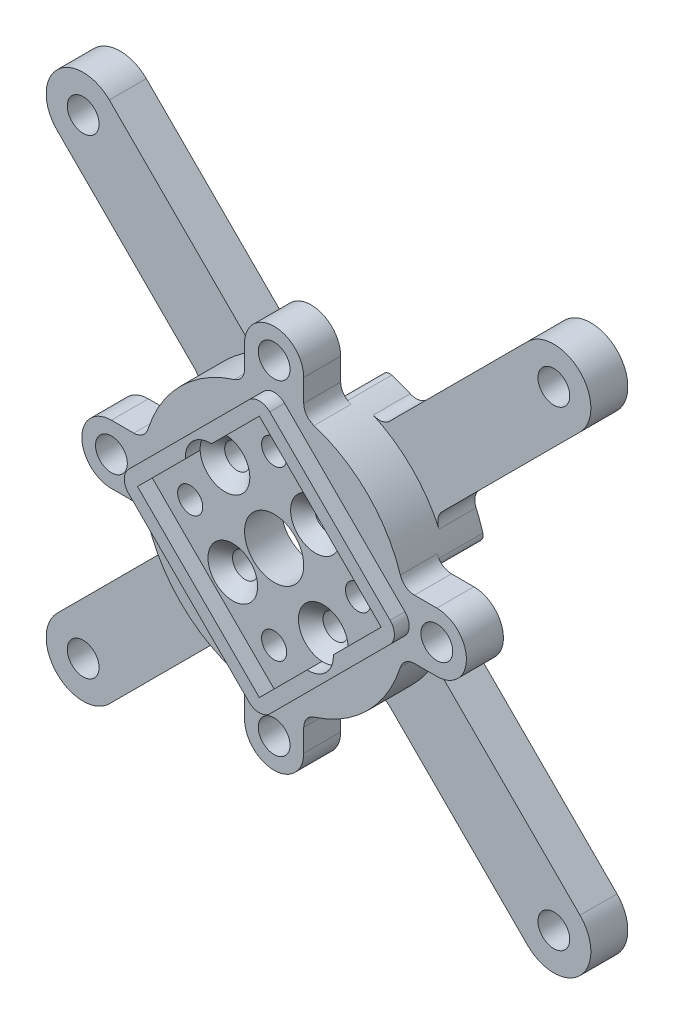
ISO-10303-21;
HEADER;
FILE_DESCRIPTION(('STEP AP214'),'2;1');
FILE_NAME('part.step','',(''),(''),'','','');
FILE_SCHEMA(('AUTOMOTIVE_DESIGN { 1 0 10303 214 1 1 1 1 }'));
ENDSEC;
DATA;
#1=APPLICATION_CONTEXT('core data for automotive mechanical design processes');
#2=APPLICATION_PROTOCOL_DEFINITION('international standard','automotive_design',2000,#1);
#3=PRODUCT_CONTEXT('',#1,'mechanical');
#4=PRODUCT('Part','Part','',(#3));
#5=PRODUCT_RELATED_PRODUCT_CATEGORY('part','',(#4));
#6=PRODUCT_DEFINITION_FORMATION('','',#4);
#7=PRODUCT_DEFINITION_CONTEXT('part definition',#1,'design');
#8=PRODUCT_DEFINITION('design','',#6,#7);
#9=PRODUCT_DEFINITION_SHAPE('','',#8);
#10=(LENGTH_UNIT() NAMED_UNIT(*) SI_UNIT(.MILLI.,.METRE.));
#11=(NAMED_UNIT(*) PLANE_ANGLE_UNIT() SI_UNIT($,.RADIAN.));
#12=(NAMED_UNIT(*) SI_UNIT($,.STERADIAN.) SOLID_ANGLE_UNIT());
#13=UNCERTAINTY_MEASURE_WITH_UNIT(LENGTH_MEASURE(1.E-05),#10,'distance_accuracy_value','');
#14=(GEOMETRIC_REPRESENTATION_CONTEXT(3) GLOBAL_UNCERTAINTY_ASSIGNED_CONTEXT((#13)) GLOBAL_UNIT_ASSIGNED_CONTEXT((#10,
#11,#12)) REPRESENTATION_CONTEXT('',''));
#15=CARTESIAN_POINT('',(0.,0.,0.));
#16=DIRECTION('',(0.,0.,1.));
#17=DIRECTION('',(1.,0.,0.));
#18=AXIS2_PLACEMENT_3D('',#15,#16,#17);
#19=CARTESIAN_POINT('',(0.,0.,11.));
#20=DIRECTION('',(0.,0.,1.));
#21=DIRECTION('',(1.,0.,0.));
#22=AXIS2_PLACEMENT_3D('',#19,#20,#21);
#23=PLANE('',#22);
#24=CARTESIAN_POINT('',(0.,11.349063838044,11.));
#25=DIRECTION('',(0.,0.,-1.));
#26=DIRECTION('',(-1.,0.,0.));
#27=AXIS2_PLACEMENT_3D('',#24,#25,#26);
#28=CIRCLE('',#27,1.7);
#29=CARTESIAN_POINT('',(-1.7,11.349063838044,11.));
#30=VERTEX_POINT('',#29);
#31=EDGE_CURVE('E3532',#30,#30,#28,.T.);
#32=ORIENTED_EDGE('',*,*,#31,.T.);
#33=EDGE_LOOP('',(#32));
#34=FACE_BOUND('',#33,.T.);
#35=CARTESIAN_POINT('',(11.3490638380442,0.,11.));
#36=DIRECTION('',(0.,0.,-1.));
#37=DIRECTION('',(-1.,0.,0.));
#38=AXIS2_PLACEMENT_3D('',#35,#36,#37);
#39=CIRCLE('',#38,1.7);
#40=CARTESIAN_POINT('',(9.64906383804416,0.,11.));
#41=VERTEX_POINT('',#40);
#42=EDGE_CURVE('E3543',#41,#41,#39,.T.);
#43=ORIENTED_EDGE('',*,*,#42,.T.);
#44=EDGE_LOOP('',(#43));
#45=FACE_BOUND('',#44,.T.);
#46=CARTESIAN_POINT('',(1.26990088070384E-13,-11.3490638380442,11.));
#47=DIRECTION('',(0.,0.,-1.));
#48=DIRECTION('',(-1.,0.,0.));
#49=AXIS2_PLACEMENT_3D('',#46,#47,#48);
#50=CIRCLE('',#49,1.7);
#51=CARTESIAN_POINT('',(-1.69999999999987,-11.3490638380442,11.));
#52=VERTEX_POINT('',#51);
#53=EDGE_CURVE('E3555',#52,#52,#50,.T.);
#54=ORIENTED_EDGE('',*,*,#53,.T.);
#55=EDGE_LOOP('',(#54));
#56=FACE_BOUND('',#55,.T.);
#57=CARTESIAN_POINT('',(-11.349063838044,-1.26973128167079E-13,11.));
#58=DIRECTION('',(0.,0.,-1.));
#59=DIRECTION('',(-1.,0.,0.));
#60=AXIS2_PLACEMENT_3D('',#57,#58,#59);
#61=CIRCLE('',#60,1.7);
#62=CARTESIAN_POINT('',(-13.049063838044,-1.26973128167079E-13,11.));
#63=VERTEX_POINT('',#62);
#64=EDGE_CURVE('E3567',#63,#63,#61,.T.);
#65=ORIENTED_EDGE('',*,*,#64,.T.);
#66=EDGE_LOOP('',(#65));
#67=FACE_BOUND('',#66,.T.);
#68=CARTESIAN_POINT('',(5.58614357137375,5.5861435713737,11.));
#69=DIRECTION('',(0.,0.,1.));
#70=DIRECTION('',(1.,0.,0.));
#71=AXIS2_PLACEMENT_3D('',#68,#69,#70);
#72=CIRCLE('',#71,3.36);
#73=CARTESIAN_POINT('',(8.94614357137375,5.5861435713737,11.));
#74=VERTEX_POINT('',#73);
#75=EDGE_CURVE('E1019',#74,#74,#72,.T.);
#76=ORIENTED_EDGE('',*,*,#75,.F.);
#77=EDGE_LOOP('',(#76));
#78=FACE_BOUND('',#77,.T.);
#79=CARTESIAN_POINT('',(-5.58614357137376,-5.5861435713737,11.));
#80=DIRECTION('',(0.,0.,1.));
#81=DIRECTION('',(1.,0.,0.));
#82=AXIS2_PLACEMENT_3D('',#79,#80,#81);
#83=CIRCLE('',#82,3.36);
#84=CARTESIAN_POINT('',(-2.22614357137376,-5.5861435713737,11.));
#85=VERTEX_POINT('',#84);
#86=EDGE_CURVE('E1007',#85,#85,#83,.T.);
#87=ORIENTED_EDGE('',*,*,#86,.F.);
#88=EDGE_LOOP('',(#87));
#89=FACE_BOUND('',#88,.T.);
#90=CARTESIAN_POINT('',(0.,0.,11.));
#91=DIRECTION('',(0.,0.,1.));
#92=DIRECTION('',(1.,0.,0.));
#93=AXIS2_PLACEMENT_3D('',#90,#91,#92);
#94=CIRCLE('',#93,4.);
#95=CARTESIAN_POINT('',(4.,0.,11.));
#96=VERTEX_POINT('',#95);
#97=EDGE_CURVE('E986',#96,#96,#94,.T.);
#98=ORIENTED_EDGE('',*,*,#97,.F.);
#99=EDGE_LOOP('',(#98));
#100=FACE_BOUND('',#99,.T.);
#101=DIRECTION('',(-0.707106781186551,0.707106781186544,0.));
#102=VECTOR('',#101,1.);
#103=CARTESIAN_POINT('',(-8.23779400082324,-8.23779400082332,11.));
#104=LINE('',#103,#102);
#105=CARTESIAN_POINT('',(1.48522145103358E-13,-16.4755880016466,11.));
#106=VERTEX_POINT('',#105);
#107=CARTESIAN_POINT('',(-16.4755880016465,-1.46174104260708E-13,11.));
#108=VERTEX_POINT('',#107);
#109=EDGE_CURVE('E1359',#106,#108,#104,.T.);
#110=ORIENTED_EDGE('',*,*,#109,.F.);
#111=DIRECTION('',(-0.707106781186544,-0.707106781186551,0.));
#112=VECTOR('',#111,1.);
#113=CARTESIAN_POINT('',(8.23779400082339,-8.2377940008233,11.));
#114=LINE('',#113,#112);
#115=CARTESIAN_POINT('',(6.47326856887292,-10.0023194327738,11.));
#116=VERTEX_POINT('',#115);
#117=EDGE_CURVE('E1356',#116,#106,#114,.T.);
#118=ORIENTED_EDGE('',*,*,#117,.F.);
#119=CARTESIAN_POINT('',(6.64680374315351,-6.64680374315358,11.));
#120=DIRECTION('',(0.,0.,1.));
#121=DIRECTION('',(1.,0.,0.));
#122=AXIS2_PLACEMENT_3D('',#119,#120,#121);
#123=CIRCLE('',#122,3.36);
#124=CARTESIAN_POINT('',(10.0023194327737,-6.47326856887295,11.));
#125=VERTEX_POINT('',#124);
#126=EDGE_CURVE('E1013',#125,#116,#123,.T.);
#127=ORIENTED_EDGE('',*,*,#126,.F.);
#128=DIRECTION('',(-0.707106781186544,-0.707106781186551,0.));
#129=VECTOR('',#128,1.);
#130=CARTESIAN_POINT('',(8.23779400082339,-8.2377940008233,11.));
#131=LINE('',#130,#129);
#132=CARTESIAN_POINT('',(16.4755880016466,0.,11.));
#133=VERTEX_POINT('',#132);
#134=EDGE_CURVE('E1395',#133,#125,#131,.T.);
#135=ORIENTED_EDGE('',*,*,#134,.F.);
#136=DIRECTION('',(-0.707106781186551,0.707106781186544,0.));
#137=VECTOR('',#136,1.);
#138=CARTESIAN_POINT('',(8.23779400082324,8.23779400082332,11.));
#139=LINE('',#138,#137);
#140=CARTESIAN_POINT('',(0.,16.4755880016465,11.));
#141=VERTEX_POINT('',#140);
#142=EDGE_CURVE('E1399',#133,#141,#139,.T.);
#143=ORIENTED_EDGE('',*,*,#142,.T.);
#144=DIRECTION('',(-0.707106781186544,-0.707106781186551,0.));
#145=VECTOR('',#144,1.);
#146=CARTESIAN_POINT('',(-8.23779400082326,8.23779400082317,11.));
#147=LINE('',#146,#145);
#148=CARTESIAN_POINT('',(-6.47326856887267,10.0023194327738,11.));
#149=VERTEX_POINT('',#148);
#150=EDGE_CURVE('E1384',#141,#149,#147,.T.);
#151=ORIENTED_EDGE('',*,*,#150,.T.);
#152=CARTESIAN_POINT('',(-6.64680374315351,6.64680374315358,11.));
#153=DIRECTION('',(0.,0.,1.));
#154=DIRECTION('',(1.,0.,0.));
#155=AXIS2_PLACEMENT_3D('',#152,#153,#154);
#156=CIRCLE('',#155,3.36);
#157=CARTESIAN_POINT('',(-10.0023194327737,6.4732685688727,11.));
#158=VERTEX_POINT('',#157);
#159=EDGE_CURVE('E1910',#158,#149,#156,.T.);
#160=ORIENTED_EDGE('',*,*,#159,.F.);
#161=DIRECTION('',(-0.707106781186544,-0.707106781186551,0.));
#162=VECTOR('',#161,1.);
#163=CARTESIAN_POINT('',(-8.23779400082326,8.23779400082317,11.));
#164=LINE('',#163,#162);
#165=EDGE_CURVE('E1380',#158,#108,#164,.T.);
#166=ORIENTED_EDGE('',*,*,#165,.T.);
#167=EDGE_LOOP('',(#110,#118,#127,#135,#143,#151,#160,#166));
#168=FACE_BOUND('',#167,.T.);
#169=ADVANCED_FACE('F48',(#34,#45,#56,#67,#78,#89,#100,#168),#23,.T.);
#170=CARTESIAN_POINT('',(0.,0.,6.));
#171=DIRECTION('',(0.,0.,1.));
#172=DIRECTION('',(1.,0.,0.));
#173=AXIS2_PLACEMENT_3D('',#170,#171,#172);
#174=PLANE('',#173);
#175=CARTESIAN_POINT('',(0.,11.349063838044,6.));
#176=DIRECTION('',(0.,0.,-1.));
#177=DIRECTION('',(-1.,0.,0.));
#178=AXIS2_PLACEMENT_3D('',#175,#176,#177);
#179=CIRCLE('',#178,3.36);
#180=CARTESIAN_POINT('',(-3.36,11.349063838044,6.));
#181=VERTEX_POINT('',#180);
#182=EDGE_CURVE('E1363',#181,#181,#179,.T.);
#183=ORIENTED_EDGE('',*,*,#182,.F.);
#184=EDGE_LOOP('',(#183));
#185=FACE_BOUND('',#184,.T.);
#186=CARTESIAN_POINT('',(11.3490638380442,0.,6.));
#187=DIRECTION('',(0.,0.,-1.));
#188=DIRECTION('',(-1.,0.,0.));
#189=AXIS2_PLACEMENT_3D('',#186,#187,#188);
#190=CIRCLE('',#189,3.36);
#191=CARTESIAN_POINT('',(7.98906383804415,0.,6.));
#192=VERTEX_POINT('',#191);
#193=EDGE_CURVE('E3535',#192,#192,#190,.T.);
#194=ORIENTED_EDGE('',*,*,#193,.F.);
#195=EDGE_LOOP('',(#194));
#196=FACE_BOUND('',#195,.T.);
#197=CARTESIAN_POINT('',(-11.349063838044,-1.26973128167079E-13,6.));
#198=DIRECTION('',(0.,0.,-1.));
#199=DIRECTION('',(-1.,0.,0.));
#200=AXIS2_PLACEMENT_3D('',#197,#198,#199);
#201=CIRCLE('',#200,3.36);
#202=CARTESIAN_POINT('',(-14.709063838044,-1.26973128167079E-13,6.));
#203=VERTEX_POINT('',#202);
#204=EDGE_CURVE('E3559',#203,#203,#201,.T.);
#205=ORIENTED_EDGE('',*,*,#204,.F.);
#206=EDGE_LOOP('',(#205));
#207=FACE_BOUND('',#206,.T.);
#208=CARTESIAN_POINT('',(-22.,2.30537877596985E-13,6.));
#209=DIRECTION('',(0.,0.,1.));
#210=DIRECTION('',(1.,0.,0.));
#211=AXIS2_PLACEMENT_3D('',#208,#209,#210);
#212=CIRCLE('',#211,2.15);
#213=CARTESIAN_POINT('',(-19.85,2.30537877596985E-13,6.));
#214=VERTEX_POINT('',#213);
#215=EDGE_CURVE('E1052',#214,#214,#212,.T.);
#216=ORIENTED_EDGE('',*,*,#215,.T.);
#217=EDGE_LOOP('',(#216));
#218=FACE_BOUND('',#217,.T.);
#219=CARTESIAN_POINT('',(0.,22.,6.));
#220=DIRECTION('',(0.,0.,1.));
#221=DIRECTION('',(1.,0.,0.));
#222=AXIS2_PLACEMENT_3D('',#219,#220,#221);
#223=CIRCLE('',#222,2.15);
#224=CARTESIAN_POINT('',(2.15,22.,6.));
#225=VERTEX_POINT('',#224);
#226=EDGE_CURVE('E1047',#225,#225,#223,.T.);
#227=ORIENTED_EDGE('',*,*,#226,.T.);
#228=EDGE_LOOP('',(#227));
#229=FACE_BOUND('',#228,.T.);
#230=CARTESIAN_POINT('',(22.,0.,6.));
#231=DIRECTION('',(0.,0.,1.));
#232=DIRECTION('',(1.,0.,0.));
#233=AXIS2_PLACEMENT_3D('',#230,#231,#232);
#234=CIRCLE('',#233,2.15);
#235=CARTESIAN_POINT('',(24.15,0.,6.));
#236=VERTEX_POINT('',#235);
#237=EDGE_CURVE('E1042',#236,#236,#234,.T.);
#238=ORIENTED_EDGE('',*,*,#237,.T.);
#239=EDGE_LOOP('',(#238));
#240=FACE_BOUND('',#239,.T.);
#241=CARTESIAN_POINT('',(-1.54592649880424E-13,-22.,6.));
#242=DIRECTION('',(0.,0.,1.));
#243=DIRECTION('',(1.,0.,0.));
#244=AXIS2_PLACEMENT_3D('',#241,#242,#243);
#245=CIRCLE('',#244,2.15);
#246=CARTESIAN_POINT('',(2.14999999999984,-22.,6.));
#247=VERTEX_POINT('',#246);
#248=EDGE_CURVE('E1037',#247,#247,#245,.T.);
#249=ORIENTED_EDGE('',*,*,#248,.T.);
#250=EDGE_LOOP('',(#249));
#251=FACE_BOUND('',#250,.T.);
#252=CARTESIAN_POINT('',(-6.64680374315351,6.64680374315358,6.));
#253=DIRECTION('',(0.,0.,1.));
#254=DIRECTION('',(1.,0.,0.));
#255=AXIS2_PLACEMENT_3D('',#252,#253,#254);
#256=CIRCLE('',#255,1.7);
#257=CARTESIAN_POINT('',(-4.94680374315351,6.64680374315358,6.));
#258=VERTEX_POINT('',#257);
#259=EDGE_CURVE('E1015',#258,#258,#256,.T.);
#260=ORIENTED_EDGE('',*,*,#259,.T.);
#261=EDGE_LOOP('',(#260));
#262=FACE_BOUND('',#261,.T.);
#263=CARTESIAN_POINT('',(5.58614357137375,5.5861435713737,6.));
#264=DIRECTION('',(0.,0.,1.));
#265=DIRECTION('',(1.,0.,0.));
#266=AXIS2_PLACEMENT_3D('',#263,#264,#265);
#267=CIRCLE('',#266,1.7);
#268=CARTESIAN_POINT('',(7.28614357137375,5.5861435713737,6.));
#269=VERTEX_POINT('',#268);
#270=EDGE_CURVE('E1009',#269,#269,#267,.T.);
#271=ORIENTED_EDGE('',*,*,#270,.T.);
#272=EDGE_LOOP('',(#271));
#273=FACE_BOUND('',#272,.T.);
#274=CARTESIAN_POINT('',(6.64680374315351,-6.64680374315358,6.));
#275=DIRECTION('',(0.,0.,1.));
#276=DIRECTION('',(1.,0.,0.));
#277=AXIS2_PLACEMENT_3D('',#274,#275,#276);
#278=CIRCLE('',#277,1.7);
#279=CARTESIAN_POINT('',(8.34680374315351,-6.64680374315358,6.));
#280=VERTEX_POINT('',#279);
#281=EDGE_CURVE('E1003',#280,#280,#278,.T.);
#282=ORIENTED_EDGE('',*,*,#281,.T.);
#283=EDGE_LOOP('',(#282));
#284=FACE_BOUND('',#283,.T.);
#285=CARTESIAN_POINT('',(-5.58614357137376,-5.5861435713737,6.));
#286=DIRECTION('',(0.,0.,1.));
#287=DIRECTION('',(1.,0.,0.));
#288=AXIS2_PLACEMENT_3D('',#285,#286,#287);
#289=CIRCLE('',#288,1.7);
#290=CARTESIAN_POINT('',(-3.88614357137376,-5.5861435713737,6.));
#291=VERTEX_POINT('',#290);
#292=EDGE_CURVE('E997',#291,#291,#289,.T.);
#293=ORIENTED_EDGE('',*,*,#292,.T.);
#294=EDGE_LOOP('',(#293));
#295=FACE_BOUND('',#294,.T.);
#296=CARTESIAN_POINT('',(0.,0.,6.));
#297=DIRECTION('',(0.,0.,1.));
#298=DIRECTION('',(1.,0.,0.));
#299=AXIS2_PLACEMENT_3D('',#296,#297,#298);
#300=CIRCLE('',#299,4.);
#301=CARTESIAN_POINT('',(4.,0.,6.));
#302=VERTEX_POINT('',#301);
#303=EDGE_CURVE('E936',#302,#302,#300,.T.);
#304=ORIENTED_EDGE('',*,*,#303,.T.);
#305=EDGE_LOOP('',(#304));
#306=FACE_BOUND('',#305,.T.);
#307=CARTESIAN_POINT('',(0.,0.,6.));
#308=DIRECTION('',(0.,0.,1.));
#309=DIRECTION('',(1.,0.,0.));
#310=AXIS2_PLACEMENT_3D('',#307,#308,#309);
#311=CIRCLE('',#310,14.05);
#312=CARTESIAN_POINT('',(13.4870589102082,3.93722515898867,6.));
#313=VERTEX_POINT('',#312);
#314=CARTESIAN_POINT('',(3.93722515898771,13.4870589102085,6.));
#315=VERTEX_POINT('',#314);
#316=EDGE_CURVE('E935',#313,#315,#311,.T.);
#317=ORIENTED_EDGE('',*,*,#316,.F.);
#318=CARTESIAN_POINT('',(14.4469919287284,4.21745470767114,6.));
#319=DIRECTION('',(0.,0.,1.));
#320=DIRECTION('',(1.,0.,0.));
#321=AXIS2_PLACEMENT_3D('',#318,#319,#320);
#322=CIRCLE('',#321,1.);
#323=CARTESIAN_POINT('',(14.6628192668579,3.24102316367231,6.));
#324=VERTEX_POINT('',#323);
#325=EDGE_CURVE('E1616',#313,#324,#322,.T.);
#326=ORIENTED_EDGE('',*,*,#325,.T.);
#327=DIRECTION('',(0.976431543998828,0.215827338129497,0.));
#328=VECTOR('',#327,1.);
#329=CARTESIAN_POINT('',(-1.49198698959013E-13,6.74994730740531E-13,6.));
#330=LINE('',#329,#328);
#331=CARTESIAN_POINT('',(16.4727792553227,3.64109099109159,6.));
#332=VERTEX_POINT('',#331);
#333=EDGE_CURVE('E975',#324,#332,#330,.T.);
#334=ORIENTED_EDGE('',*,*,#333,.T.);
#335=CARTESIAN_POINT('',(16.2569519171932,4.61752253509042,6.));
#336=DIRECTION('',(0.,0.,1.));
#337=DIRECTION('',(1.,0.,0.));
#338=AXIS2_PLACEMENT_3D('',#335,#336,#337);
#339=CIRCLE('',#338,1.);
#340=CARTESIAN_POINT('',(17.2189017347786,4.89074872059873,6.));
#341=VERTEX_POINT('',#340);
#342=EDGE_CURVE('E1619',#332,#341,#339,.T.);
#343=ORIENTED_EDGE('',*,*,#342,.T.);
#344=CARTESIAN_POINT('',(0.,0.,6.));
#345=DIRECTION('',(0.,0.,1.));
#346=DIRECTION('',(1.,0.,0.));
#347=AXIS2_PLACEMENT_3D('',#344,#345,#346);
#348=CIRCLE('',#347,17.9);
#349=CARTESIAN_POINT('',(17.067001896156,5.39698492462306,6.));
#350=VERTEX_POINT('',#349);
#351=EDGE_CURVE('E785',#341,#350,#348,.T.);
#352=ORIENTED_EDGE('',*,*,#351,.T.);
#353=CARTESIAN_POINT('',(18.9739294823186,5.99999999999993,6.));
#354=DIRECTION('',(0.,0.,1.));
#355=DIRECTION('',(1.,0.,0.));
#356=AXIS2_PLACEMENT_3D('',#353,#354,#355);
#357=CIRCLE('',#356,2.);
#358=CARTESIAN_POINT('',(18.9739294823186,3.99999999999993,6.));
#359=VERTEX_POINT('',#358);
#360=EDGE_CURVE('E1205',#350,#359,#357,.T.);
#361=ORIENTED_EDGE('',*,*,#360,.T.);
#362=DIRECTION('',(1.,0.,0.));
#363=VECTOR('',#362,1.);
#364=CARTESIAN_POINT('',(0.,4.,6.));
#365=LINE('',#364,#363);
#366=CARTESIAN_POINT('',(22.,3.99999999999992,6.));
#367=VERTEX_POINT('',#366);
#368=EDGE_CURVE('E782',#359,#367,#365,.T.);
#369=ORIENTED_EDGE('',*,*,#368,.T.);
#370=CARTESIAN_POINT('',(22.,0.,6.));
#371=DIRECTION('',(0.,0.,1.));
#372=DIRECTION('',(1.,0.,0.));
#373=AXIS2_PLACEMENT_3D('',#370,#371,#372);
#374=CIRCLE('',#373,4.);
#375=CARTESIAN_POINT('',(22.,-4.00000000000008,6.));
#376=VERTEX_POINT('',#375);
#377=EDGE_CURVE('E777',#376,#367,#374,.T.);
#378=ORIENTED_EDGE('',*,*,#377,.F.);
#379=DIRECTION('',(1.,0.,0.));
#380=VECTOR('',#379,1.);
#381=CARTESIAN_POINT('',(0.,-4.,6.));
#382=LINE('',#381,#380);
#383=CARTESIAN_POINT('',(18.9739294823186,-4.00000000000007,6.));
#384=VERTEX_POINT('',#383);
#385=EDGE_CURVE('E774',#384,#376,#382,.T.);
#386=ORIENTED_EDGE('',*,*,#385,.F.);
#387=CARTESIAN_POINT('',(18.9739294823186,-6.00000000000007,6.));
#388=DIRECTION('',(0.,0.,1.));
#389=DIRECTION('',(1.,0.,0.));
#390=AXIS2_PLACEMENT_3D('',#387,#388,#389);
#391=CIRCLE('',#390,2.);
#392=CARTESIAN_POINT('',(17.0670018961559,-5.39698492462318,6.));
#393=VERTEX_POINT('',#392);
#394=EDGE_CURVE('E1211',#384,#393,#391,.T.);
#395=ORIENTED_EDGE('',*,*,#394,.T.);
#396=CARTESIAN_POINT('',(17.218901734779,-4.89074872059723,6.));
#397=VERTEX_POINT('',#396);
#398=EDGE_CURVE('E786',#393,#397,#348,.T.);
#399=ORIENTED_EDGE('',*,*,#398,.T.);
#400=CARTESIAN_POINT('',(16.2569519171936,-4.61752253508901,6.));
#401=DIRECTION('',(0.,0.,1.));
#402=DIRECTION('',(1.,0.,0.));
#403=AXIS2_PLACEMENT_3D('',#400,#401,#402);
#404=CIRCLE('',#403,1.);
#405=CARTESIAN_POINT('',(16.4727792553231,-3.64109099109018,6.));
#406=VERTEX_POINT('',#405);
#407=EDGE_CURVE('E1613',#397,#406,#404,.T.);
#408=ORIENTED_EDGE('',*,*,#407,.T.);
#409=DIRECTION('',(0.976431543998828,-0.215827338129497,0.));
#410=VECTOR('',#409,1.);
#411=CARTESIAN_POINT('',(1.67731536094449E-13,7.58839747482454E-13,6.));
#412=LINE('',#411,#410);
#413=CARTESIAN_POINT('',(14.6628192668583,-3.2410231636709,6.));
#414=VERTEX_POINT('',#413);
#415=EDGE_CURVE('E902',#414,#406,#412,.T.);
#416=ORIENTED_EDGE('',*,*,#415,.F.);
#417=CARTESIAN_POINT('',(14.4469919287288,-4.21745470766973,6.));
#418=DIRECTION('',(0.,0.,1.));
#419=DIRECTION('',(1.,0.,0.));
#420=AXIS2_PLACEMENT_3D('',#417,#418,#419);
#421=CIRCLE('',#420,1.);
#422=CARTESIAN_POINT('',(13.4870589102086,-3.93722515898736,6.));
#423=VERTEX_POINT('',#422);
#424=EDGE_CURVE('E1592',#414,#423,#421,.T.);
#425=ORIENTED_EDGE('',*,*,#424,.T.);
#426=CARTESIAN_POINT('',(0.,0.,6.));
#427=DIRECTION('',(0.,0.,1.));
#428=DIRECTION('',(1.,0.,0.));
#429=AXIS2_PLACEMENT_3D('',#426,#427,#428);
#430=CIRCLE('',#429,14.05);
#431=CARTESIAN_POINT('',(3.93722515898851,-13.4870589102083,6.));
#432=VERTEX_POINT('',#431);
#433=EDGE_CURVE('E909',#432,#423,#430,.T.);
#434=ORIENTED_EDGE('',*,*,#433,.F.);
#435=CARTESIAN_POINT('',(4.21745470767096,-14.4469919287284,6.));
#436=DIRECTION('',(0.,0.,1.));
#437=DIRECTION('',(1.,0.,0.));
#438=AXIS2_PLACEMENT_3D('',#435,#436,#437);
#439=CIRCLE('',#438,1.);
#440=CARTESIAN_POINT('',(3.24102316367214,-14.6628192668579,6.));
#441=VERTEX_POINT('',#440);
#442=EDGE_CURVE('E1595',#432,#441,#439,.T.);
#443=ORIENTED_EDGE('',*,*,#442,.T.);
#444=DIRECTION('',(0.215827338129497,-0.976431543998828,0.));
#445=VECTOR('',#444,1.);
#446=CARTESIAN_POINT('',(4.93330527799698E-13,1.09044218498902E-13,6.));
#447=LINE('',#446,#445);
#448=CARTESIAN_POINT('',(3.64109099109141,-16.4727792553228,6.));
#449=VERTEX_POINT('',#448);
#450=EDGE_CURVE('E910',#441,#449,#447,.T.);
#451=ORIENTED_EDGE('',*,*,#450,.T.);
#452=CARTESIAN_POINT('',(4.61752253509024,-16.2569519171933,6.));
#453=DIRECTION('',(0.,0.,1.));
#454=DIRECTION('',(1.,0.,0.));
#455=AXIS2_PLACEMENT_3D('',#452,#453,#454);
#456=CIRCLE('',#455,1.);
#457=CARTESIAN_POINT('',(4.89074872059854,-17.2189017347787,6.));
#458=VERTEX_POINT('',#457);
#459=EDGE_CURVE('E1598',#449,#458,#456,.T.);
#460=ORIENTED_EDGE('',*,*,#459,.T.);
#461=CARTESIAN_POINT('',(0.,0.,6.));
#462=DIRECTION('',(0.,0.,1.));
#463=DIRECTION('',(1.,0.,0.));
#464=AXIS2_PLACEMENT_3D('',#461,#462,#463);
#465=CIRCLE('',#464,17.9);
#466=CARTESIAN_POINT('',(5.39698492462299,-17.067001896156,6.));
#467=VERTEX_POINT('',#466);
#468=EDGE_CURVE('E818',#458,#467,#465,.T.);
#469=ORIENTED_EDGE('',*,*,#468,.T.);
#470=CARTESIAN_POINT('',(5.99999999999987,-18.9739294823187,6.));
#471=DIRECTION('',(0.,0.,1.));
#472=DIRECTION('',(1.,0.,0.));
#473=AXIS2_PLACEMENT_3D('',#470,#471,#472);
#474=CIRCLE('',#473,2.);
#475=CARTESIAN_POINT('',(3.99999999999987,-18.9739294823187,6.));
#476=VERTEX_POINT('',#475);
#477=EDGE_CURVE('E1218',#467,#476,#474,.T.);
#478=ORIENTED_EDGE('',*,*,#477,.T.);
#479=DIRECTION('',(0.,-1.,0.));
#480=VECTOR('',#479,1.);
#481=CARTESIAN_POINT('',(4.,0.,6.));
#482=LINE('',#481,#480);
#483=CARTESIAN_POINT('',(3.99999999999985,-22.,6.));
#484=VERTEX_POINT('',#483);
#485=EDGE_CURVE('E815',#476,#484,#482,.T.);
#486=ORIENTED_EDGE('',*,*,#485,.T.);
#487=CARTESIAN_POINT('',(-1.54592649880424E-13,-22.,6.));
#488=DIRECTION('',(0.,0.,1.));
#489=DIRECTION('',(1.,0.,0.));
#490=AXIS2_PLACEMENT_3D('',#487,#488,#489);
#491=CIRCLE('',#490,4.);
#492=CARTESIAN_POINT('',(-4.00000000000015,-22.,6.));
#493=VERTEX_POINT('',#492);
#494=EDGE_CURVE('E810',#493,#484,#491,.T.);
#495=ORIENTED_EDGE('',*,*,#494,.F.);
#496=DIRECTION('',(0.,-1.,0.));
#497=VECTOR('',#496,1.);
#498=CARTESIAN_POINT('',(-4.,0.,6.));
#499=LINE('',#498,#497);
#500=CARTESIAN_POINT('',(-4.00000000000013,-18.9739294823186,6.));
#501=VERTEX_POINT('',#500);
#502=EDGE_CURVE('E807',#501,#493,#499,.T.);
#503=ORIENTED_EDGE('',*,*,#502,.F.);
#504=CARTESIAN_POINT('',(-6.00000000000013,-18.9739294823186,6.));
#505=DIRECTION('',(0.,0.,1.));
#506=DIRECTION('',(1.,0.,0.));
#507=AXIS2_PLACEMENT_3D('',#504,#505,#506);
#508=CIRCLE('',#507,2.);
#509=CARTESIAN_POINT('',(-5.39698492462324,-17.0670018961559,6.));
#510=VERTEX_POINT('',#509);
#511=EDGE_CURVE('E1224',#501,#510,#508,.T.);
#512=ORIENTED_EDGE('',*,*,#511,.T.);
#513=CARTESIAN_POINT('',(-4.89074872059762,-17.2189017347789,6.));
#514=VERTEX_POINT('',#513);
#515=EDGE_CURVE('E819',#510,#514,#465,.T.);
#516=ORIENTED_EDGE('',*,*,#515,.T.);
#517=CARTESIAN_POINT('',(-4.61752253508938,-16.2569519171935,6.));
#518=DIRECTION('',(0.,0.,1.));
#519=DIRECTION('',(1.,0.,0.));
#520=AXIS2_PLACEMENT_3D('',#517,#518,#519);
#521=CIRCLE('',#520,1.);
#522=CARTESIAN_POINT('',(-3.64109099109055,-16.472779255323,6.));
#523=VERTEX_POINT('',#522);
#524=EDGE_CURVE('E1610',#514,#523,#521,.T.);
#525=ORIENTED_EDGE('',*,*,#524,.T.);
#526=DIRECTION('',(-0.215827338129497,-0.976431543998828,0.));
#527=VECTOR('',#526,1.);
#528=CARTESIAN_POINT('',(3.8238409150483E-13,0.,6.));
#529=LINE('',#528,#527);
#530=CARTESIAN_POINT('',(-3.24102316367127,-14.6628192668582,6.));
#531=VERTEX_POINT('',#530);
#532=EDGE_CURVE('E914',#531,#523,#529,.T.);
#533=ORIENTED_EDGE('',*,*,#532,.F.);
#534=CARTESIAN_POINT('',(-4.2174547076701,-14.4469919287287,6.));
#535=DIRECTION('',(0.,0.,1.));
#536=DIRECTION('',(1.,0.,0.));
#537=AXIS2_PLACEMENT_3D('',#534,#535,#536);
#538=CIRCLE('',#537,1.);
#539=CARTESIAN_POINT('',(-3.9372251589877,-13.4870589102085,6.));
#540=VERTEX_POINT('',#539);
#541=EDGE_CURVE('E1607',#531,#540,#538,.T.);
#542=ORIENTED_EDGE('',*,*,#541,.T.);
#543=CARTESIAN_POINT('',(0.,0.,6.));
#544=DIRECTION('',(0.,0.,1.));
#545=DIRECTION('',(1.,0.,0.));
#546=AXIS2_PLACEMENT_3D('',#543,#544,#545);
#547=CIRCLE('',#546,14.05);
#548=CARTESIAN_POINT('',(-13.4870589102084,-3.93722515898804,6.));
#549=VERTEX_POINT('',#548);
#550=EDGE_CURVE('E918',#549,#540,#547,.T.);
#551=ORIENTED_EDGE('',*,*,#550,.F.);
#552=CARTESIAN_POINT('',(-14.4469919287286,-4.21745470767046,6.));
#553=DIRECTION('',(0.,0.,1.));
#554=DIRECTION('',(1.,0.,0.));
#555=AXIS2_PLACEMENT_3D('',#552,#553,#554);
#556=CIRCLE('',#555,1.);
#557=CARTESIAN_POINT('',(-14.6628192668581,-3.24102316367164,6.));
#558=VERTEX_POINT('',#557);
#559=EDGE_CURVE('E71',#549,#558,#556,.T.);
#560=ORIENTED_EDGE('',*,*,#559,.T.);
#561=DIRECTION('',(-0.976431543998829,-0.215827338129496,0.));
#562=VECTOR('',#561,1.);
#563=CARTESIAN_POINT('',(0.,0.,6.));
#564=LINE('',#563,#562);
#565=CARTESIAN_POINT('',(-16.4727792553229,-3.64109099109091,6.));
#566=VERTEX_POINT('',#565);
#567=EDGE_CURVE('E919',#558,#566,#564,.T.);
#568=ORIENTED_EDGE('',*,*,#567,.T.);
#569=CARTESIAN_POINT('',(-16.2569519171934,-4.61752253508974,6.));
#570=DIRECTION('',(0.,0.,1.));
#571=DIRECTION('',(1.,0.,0.));
#572=AXIS2_PLACEMENT_3D('',#569,#570,#571);
#573=CIRCLE('',#572,1.);
#574=CARTESIAN_POINT('',(-17.2189017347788,-4.89074872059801,6.));
#575=VERTEX_POINT('',#574);
#576=EDGE_CURVE('E13',#566,#575,#573,.T.);
#577=ORIENTED_EDGE('',*,*,#576,.T.);
#578=CARTESIAN_POINT('',(0.,0.,6.));
#579=DIRECTION('',(0.,0.,1.));
#580=DIRECTION('',(1.,0.,0.));
#581=AXIS2_PLACEMENT_3D('',#578,#579,#580);
#582=CIRCLE('',#581,17.9);
#583=CARTESIAN_POINT('',(-17.067001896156,-5.39698492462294,6.));
#584=VERTEX_POINT('',#583);
#585=EDGE_CURVE('E851',#575,#584,#582,.T.);
#586=ORIENTED_EDGE('',*,*,#585,.T.);
#587=CARTESIAN_POINT('',(-18.9739294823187,-5.9999999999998,6.));
#588=DIRECTION('',(0.,0.,1.));
#589=DIRECTION('',(1.,0.,0.));
#590=AXIS2_PLACEMENT_3D('',#587,#588,#589);
#591=CIRCLE('',#590,2.);
#592=CARTESIAN_POINT('',(-18.9739294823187,-3.9999999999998,6.));
#593=VERTEX_POINT('',#592);
#594=EDGE_CURVE('E1231',#584,#593,#591,.T.);
#595=ORIENTED_EDGE('',*,*,#594,.T.);
#596=DIRECTION('',(-1.,0.,0.));
#597=VECTOR('',#596,1.);
#598=CARTESIAN_POINT('',(0.,-4.,6.));
#599=LINE('',#598,#597);
#600=CARTESIAN_POINT('',(-22.,-3.99999999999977,6.));
#601=VERTEX_POINT('',#600);
#602=EDGE_CURVE('E848',#593,#601,#599,.T.);
#603=ORIENTED_EDGE('',*,*,#602,.T.);
#604=CARTESIAN_POINT('',(-22.,2.30537877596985E-13,6.));
#605=DIRECTION('',(0.,0.,1.));
#606=DIRECTION('',(1.,0.,0.));
#607=AXIS2_PLACEMENT_3D('',#604,#605,#606);
#608=CIRCLE('',#607,4.);
#609=CARTESIAN_POINT('',(-22.,4.00000000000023,6.));
#610=VERTEX_POINT('',#609);
#611=EDGE_CURVE('E843',#610,#601,#608,.T.);
#612=ORIENTED_EDGE('',*,*,#611,.F.);
#613=DIRECTION('',(-1.,0.,0.));
#614=VECTOR('',#613,1.);
#615=CARTESIAN_POINT('',(0.,4.,6.));
#616=LINE('',#615,#614);
#617=CARTESIAN_POINT('',(-18.9739294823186,4.0000000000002,6.));
#618=VERTEX_POINT('',#617);
#619=EDGE_CURVE('E840',#618,#610,#616,.T.);
#620=ORIENTED_EDGE('',*,*,#619,.F.);
#621=CARTESIAN_POINT('',(-18.9739294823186,6.0000000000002,6.));
#622=DIRECTION('',(0.,0.,1.));
#623=DIRECTION('',(1.,0.,0.));
#624=AXIS2_PLACEMENT_3D('',#621,#622,#623);
#625=CIRCLE('',#624,2.);
#626=CARTESIAN_POINT('',(-17.0670018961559,5.39698492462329,6.));
#627=VERTEX_POINT('',#626);
#628=EDGE_CURVE('E1185',#618,#627,#625,.T.);
#629=ORIENTED_EDGE('',*,*,#628,.T.);
#630=CARTESIAN_POINT('',(-17.2189017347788,4.89074872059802,6.));
#631=VERTEX_POINT('',#630);
#632=EDGE_CURVE('E852',#627,#631,#582,.T.);
#633=ORIENTED_EDGE('',*,*,#632,.T.);
#634=CARTESIAN_POINT('',(-16.2569519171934,4.61752253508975,6.));
#635=DIRECTION('',(0.,0.,1.));
#636=DIRECTION('',(1.,0.,0.));
#637=AXIS2_PLACEMENT_3D('',#634,#635,#636);
#638=CIRCLE('',#637,1.);
#639=CARTESIAN_POINT('',(-16.4727792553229,3.64109099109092,6.));
#640=VERTEX_POINT('',#639);
#641=EDGE_CURVE('E57',#631,#640,#638,.T.);
#642=ORIENTED_EDGE('',*,*,#641,.T.);
#643=DIRECTION('',(-0.976431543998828,0.215827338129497,0.));
#644=VECTOR('',#643,1.);
#645=CARTESIAN_POINT('',(0.,0.,6.));
#646=LINE('',#645,#644);
#647=CARTESIAN_POINT('',(-14.6628192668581,3.24102316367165,6.));
#648=VERTEX_POINT('',#647);
#649=EDGE_CURVE('E922',#648,#640,#646,.T.);
#650=ORIENTED_EDGE('',*,*,#649,.F.);
#651=CARTESIAN_POINT('',(-14.4469919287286,4.21745470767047,6.));
#652=DIRECTION('',(0.,0.,1.));
#653=DIRECTION('',(1.,0.,0.));
#654=AXIS2_PLACEMENT_3D('',#651,#652,#653);
#655=CIRCLE('',#654,1.);
#656=CARTESIAN_POINT('',(-13.4870589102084,3.93722515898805,6.));
#657=VERTEX_POINT('',#656);
#658=EDGE_CURVE('E1628',#648,#657,#655,.T.);
#659=ORIENTED_EDGE('',*,*,#658,.T.);
#660=CARTESIAN_POINT('',(0.,0.,6.));
#661=DIRECTION('',(0.,0.,1.));
#662=DIRECTION('',(1.,0.,0.));
#663=AXIS2_PLACEMENT_3D('',#660,#661,#662);
#664=CIRCLE('',#663,14.05);
#665=CARTESIAN_POINT('',(-3.93722515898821,13.4870589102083,6.));
#666=VERTEX_POINT('',#665);
#667=EDGE_CURVE('E926',#666,#657,#664,.T.);
#668=ORIENTED_EDGE('',*,*,#667,.F.);
#669=CARTESIAN_POINT('',(-4.21745470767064,14.4469919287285,6.));
#670=DIRECTION('',(0.,0.,1.));
#671=DIRECTION('',(1.,0.,0.));
#672=AXIS2_PLACEMENT_3D('',#669,#670,#671);
#673=CIRCLE('',#672,1.);
#674=CARTESIAN_POINT('',(-3.24102316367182,14.662819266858,6.));
#675=VERTEX_POINT('',#674);
#676=EDGE_CURVE('E1625',#666,#675,#673,.T.);
#677=ORIENTED_EDGE('',*,*,#676,.T.);
#678=DIRECTION('',(-0.215827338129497,0.976431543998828,0.));
#679=VECTOR('',#678,1.);
#680=CARTESIAN_POINT('',(-1.70230791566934E-13,0.,6.));
#681=LINE('',#680,#679);
#682=CARTESIAN_POINT('',(-3.6410909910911,16.4727792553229,6.));
#683=VERTEX_POINT('',#682);
#684=EDGE_CURVE('E927',#675,#683,#681,.T.);
#685=ORIENTED_EDGE('',*,*,#684,.T.);
#686=CARTESIAN_POINT('',(-4.61752253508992,16.2569519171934,6.));
#687=DIRECTION('',(0.,0.,1.));
#688=DIRECTION('',(1.,0.,0.));
#689=AXIS2_PLACEMENT_3D('',#686,#687,#688);
#690=CIRCLE('',#689,1.);
#691=CARTESIAN_POINT('',(-4.8907487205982,17.2189017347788,6.));
#692=VERTEX_POINT('',#691);
#693=EDGE_CURVE('E1622',#683,#692,#690,.T.);
#694=ORIENTED_EDGE('',*,*,#693,.T.);
#695=CARTESIAN_POINT('',(0.,0.,6.));
#696=DIRECTION('',(0.,0.,1.));
#697=DIRECTION('',(1.,0.,0.));
#698=AXIS2_PLACEMENT_3D('',#695,#696,#697);
#699=CIRCLE('',#698,17.9);
#700=CARTESIAN_POINT('',(-5.39698492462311,17.067001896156,6.));
#701=VERTEX_POINT('',#700);
#702=EDGE_CURVE('E884',#692,#701,#699,.T.);
#703=ORIENTED_EDGE('',*,*,#702,.T.);
#704=CARTESIAN_POINT('',(-6.,18.9739294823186,6.));
#705=DIRECTION('',(0.,0.,1.));
#706=DIRECTION('',(1.,0.,0.));
#707=AXIS2_PLACEMENT_3D('',#704,#705,#706);
#708=CIRCLE('',#707,2.);
#709=CARTESIAN_POINT('',(-4.,18.9739294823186,6.));
#710=VERTEX_POINT('',#709);
#711=EDGE_CURVE('E1192',#701,#710,#708,.T.);
#712=ORIENTED_EDGE('',*,*,#711,.T.);
#713=DIRECTION('',(0.,1.,0.));
#714=VECTOR('',#713,1.);
#715=CARTESIAN_POINT('',(-4.,0.,6.));
#716=LINE('',#715,#714);
#717=CARTESIAN_POINT('',(-4.,22.,6.));
#718=VERTEX_POINT('',#717);
#719=EDGE_CURVE('E881',#710,#718,#716,.T.);
#720=ORIENTED_EDGE('',*,*,#719,.T.);
#721=CARTESIAN_POINT('',(0.,22.,6.));
#722=DIRECTION('',(0.,0.,1.));
#723=DIRECTION('',(1.,0.,0.));
#724=AXIS2_PLACEMENT_3D('',#721,#722,#723);
#725=CIRCLE('',#724,4.);
#726=CARTESIAN_POINT('',(4.,22.,6.));
#727=VERTEX_POINT('',#726);
#728=EDGE_CURVE('E876',#727,#718,#725,.T.);
#729=ORIENTED_EDGE('',*,*,#728,.F.);
#730=DIRECTION('',(0.,1.,0.));
#731=VECTOR('',#730,1.);
#732=CARTESIAN_POINT('',(4.,0.,6.));
#733=LINE('',#732,#731);
#734=CARTESIAN_POINT('',(4.,18.9739294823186,6.));
#735=VERTEX_POINT('',#734);
#736=EDGE_CURVE('E873',#735,#727,#733,.T.);
#737=ORIENTED_EDGE('',*,*,#736,.F.);
#738=CARTESIAN_POINT('',(6.,18.9739294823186,6.));
#739=DIRECTION('',(0.,0.,1.));
#740=DIRECTION('',(1.,0.,0.));
#741=AXIS2_PLACEMENT_3D('',#738,#739,#740);
#742=CIRCLE('',#741,2.);
#743=CARTESIAN_POINT('',(5.39698492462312,17.067001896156,6.));
#744=VERTEX_POINT('',#743);
#745=EDGE_CURVE('E1198',#735,#744,#742,.T.);
#746=ORIENTED_EDGE('',*,*,#745,.T.);
#747=CARTESIAN_POINT('',(4.89074872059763,17.2189017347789,6.));
#748=VERTEX_POINT('',#747);
#749=EDGE_CURVE('E885',#744,#748,#699,.T.);
#750=ORIENTED_EDGE('',*,*,#749,.T.);
#751=CARTESIAN_POINT('',(4.61752253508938,16.2569519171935,6.));
#752=DIRECTION('',(0.,0.,1.));
#753=DIRECTION('',(1.,0.,0.));
#754=AXIS2_PLACEMENT_3D('',#751,#752,#753);
#755=CIRCLE('',#754,1.);
#756=CARTESIAN_POINT('',(3.64109099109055,16.472779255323,6.));
#757=VERTEX_POINT('',#756);
#758=EDGE_CURVE('E1601',#748,#757,#755,.T.);
#759=ORIENTED_EDGE('',*,*,#758,.T.);
#760=DIRECTION('',(0.215827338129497,0.976431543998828,0.));
#761=VECTOR('',#760,1.);
#762=CARTESIAN_POINT('',(-3.77302575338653E-13,0.,6.));
#763=LINE('',#762,#761);
#764=CARTESIAN_POINT('',(3.24102316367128,14.6628192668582,6.));
#765=VERTEX_POINT('',#764);
#766=EDGE_CURVE('E931',#765,#757,#763,.T.);
#767=ORIENTED_EDGE('',*,*,#766,.F.);
#768=CARTESIAN_POINT('',(4.2174547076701,14.4469919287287,6.));
#769=DIRECTION('',(0.,0.,1.));
#770=DIRECTION('',(1.,0.,0.));
#771=AXIS2_PLACEMENT_3D('',#768,#769,#770);
#772=CIRCLE('',#771,1.);
#773=EDGE_CURVE('E1604',#765,#315,#772,.T.);
#774=ORIENTED_EDGE('',*,*,#773,.T.);
#775=EDGE_LOOP('',(#317,#326,#334,#343,#352,#361,#369,#378,#386,#395,#399,#408,#416,#425,#434,
#443,#451,#460,#469,#478,#486,#495,#503,#512,#516,#525,#533,#542,#551,#560,#568,#577,#586,#595,
#603,#612,#620,#629,#633,#642,#650,#659,#668,#677,#685,#694,#703,#712,#720,#729,#737,#746,#750,
#759,#767,#774));
#776=FACE_BOUND('',#775,.T.);
#777=CARTESIAN_POINT('',(1.26990088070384E-13,-11.3490638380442,6.));
#778=DIRECTION('',(0.,0.,-1.));
#779=DIRECTION('',(-1.,0.,0.));
#780=AXIS2_PLACEMENT_3D('',#777,#778,#779);
#781=CIRCLE('',#780,3.36);
#782=CARTESIAN_POINT('',(-3.35999999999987,-11.3490638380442,6.));
#783=VERTEX_POINT('',#782);
#784=EDGE_CURVE('E3547',#783,#783,#781,.T.);
#785=ORIENTED_EDGE('',*,*,#784,.F.);
#786=EDGE_LOOP('',(#785));
#787=FACE_BOUND('',#786,.T.);
#788=ADVANCED_FACE('F1636',(#185,#196,#207,#218,#229,#240,#251,#262,#273,#284,#295,#306,#776,
#787),#174,.F.);
#789=CARTESIAN_POINT('',(0.,0.,11.));
#790=DIRECTION('',(0.,0.,-1.));
#791=DIRECTION('',(-1.,0.,0.));
#792=AXIS2_PLACEMENT_3D('',#789,#790,#791);
#793=CYLINDRICAL_SURFACE('',#792,17.9);
#794=ORIENTED_EDGE('',*,*,#468,.F.);
#795=DIRECTION('',(0.,0.,-1.));
#796=VECTOR('',#795,1.);
#797=CARTESIAN_POINT('',(4.89074872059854,-17.2189017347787,11.));
#798=LINE('',#797,#796);
#799=CARTESIAN_POINT('',(4.89074872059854,-17.2189017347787,0.));
#800=VERTEX_POINT('',#799);
#801=EDGE_CURVE('E1469',#458,#800,#798,.T.);
#802=ORIENTED_EDGE('',*,*,#801,.T.);
#803=CARTESIAN_POINT('',(0.,0.,0.));
#804=DIRECTION('',(0.,0.,1.));
#805=DIRECTION('',(1.,0.,0.));
#806=AXIS2_PLACEMENT_3D('',#803,#804,#805);
#807=CIRCLE('',#806,17.9);
#808=CARTESIAN_POINT('',(7.39601212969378,-16.3005829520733,0.));
#809=VERTEX_POINT('',#808);
#810=EDGE_CURVE('E1667',#800,#809,#807,.T.);
#811=ORIENTED_EDGE('',*,*,#810,.T.);
#812=DIRECTION('',(0.,0.,-1.));
#813=VECTOR('',#812,1.);
#814=CARTESIAN_POINT('',(7.39601212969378,-16.3005829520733,11.));
#815=LINE('',#814,#813);
#816=CARTESIAN_POINT('',(7.39601212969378,-16.3005829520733,5.));
#817=VERTEX_POINT('',#816);
#818=EDGE_CURVE('E1106',#809,#817,#815,.F.);
#819=ORIENTED_EDGE('',*,*,#818,.T.);
#820=CARTESIAN_POINT('',(0.,0.,5.));
#821=DIRECTION('',(0.,0.,1.));
#822=DIRECTION('',(1.,0.,0.));
#823=AXIS2_PLACEMENT_3D('',#820,#821,#822);
#824=CIRCLE('',#823,17.9);
#825=CARTESIAN_POINT('',(16.3005829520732,-7.39601212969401,5.));
#826=VERTEX_POINT('',#825);
#827=EDGE_CURVE('E657',#817,#826,#824,.T.);
#828=ORIENTED_EDGE('',*,*,#827,.T.);
#829=DIRECTION('',(0.,0.,-1.));
#830=VECTOR('',#829,1.);
#831=CARTESIAN_POINT('',(16.3005829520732,-7.39601212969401,11.));
#832=LINE('',#831,#830);
#833=CARTESIAN_POINT('',(16.3005829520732,-7.39601212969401,0.));
#834=VERTEX_POINT('',#833);
#835=EDGE_CURVE('E1110',#826,#834,#832,.T.);
#836=ORIENTED_EDGE('',*,*,#835,.T.);
#837=CARTESIAN_POINT('',(17.218901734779,-4.89074872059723,0.));
#838=VERTEX_POINT('',#837);
#839=EDGE_CURVE('E979',#834,#838,#807,.T.);
#840=ORIENTED_EDGE('',*,*,#839,.T.);
#841=DIRECTION('',(0.,0.,-1.));
#842=VECTOR('',#841,1.);
#843=CARTESIAN_POINT('',(17.218901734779,-4.89074872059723,11.));
#844=LINE('',#843,#842);
#845=EDGE_CURVE('E1466',#838,#397,#844,.F.);
#846=ORIENTED_EDGE('',*,*,#845,.T.);
#847=ORIENTED_EDGE('',*,*,#398,.F.);
#848=DIRECTION('',(0.,0.,-1.));
#849=VECTOR('',#848,1.);
#850=CARTESIAN_POINT('',(17.0670018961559,-5.39698492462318,11.));
#851=LINE('',#850,#849);
#852=CARTESIAN_POINT('',(17.0670018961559,-5.39698492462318,11.));
#853=VERTEX_POINT('',#852);
#854=EDGE_CURVE('E1118',#393,#853,#851,.F.);
#855=ORIENTED_EDGE('',*,*,#854,.T.);
#856=CARTESIAN_POINT('',(0.,0.,11.));
#857=DIRECTION('',(0.,0.,1.));
#858=DIRECTION('',(1.,0.,0.));
#859=AXIS2_PLACEMENT_3D('',#856,#857,#858);
#860=CIRCLE('',#859,17.9);
#861=CARTESIAN_POINT('',(5.39698492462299,-17.067001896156,11.));
#862=VERTEX_POINT('',#861);
#863=EDGE_CURVE('E985',#862,#853,#860,.T.);
#864=ORIENTED_EDGE('',*,*,#863,.F.);
#865=DIRECTION('',(0.,0.,-1.));
#866=VECTOR('',#865,1.);
#867=CARTESIAN_POINT('',(5.396984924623,-17.067001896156,11.));
#868=LINE('',#867,#866);
#869=EDGE_CURVE('E1114',#862,#467,#868,.T.);
#870=ORIENTED_EDGE('',*,*,#869,.T.);
#871=EDGE_LOOP('',(#794,#802,#811,#819,#828,#836,#840,#846,#847,#855,#864,#870));
#872=FACE_BOUND('',#871,.T.);
#873=ADVANCED_FACE('F1751',(#872),#793,.T.);
#874=CARTESIAN_POINT('',(-7.39601212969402,-16.3005829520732,0.));
#875=VERTEX_POINT('',#874);
#876=CARTESIAN_POINT('',(-4.89074872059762,-17.2189017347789,0.));
#877=VERTEX_POINT('',#876);
#878=EDGE_CURVE('E1658',#875,#877,#807,.T.);
#879=ORIENTED_EDGE('',*,*,#878,.T.);
#880=DIRECTION('',(0.,0.,-1.));
#881=VECTOR('',#880,1.);
#882=CARTESIAN_POINT('',(-4.89074872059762,-17.2189017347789,11.));
#883=LINE('',#882,#881);
#884=EDGE_CURVE('E1536',#877,#514,#883,.F.);
#885=ORIENTED_EDGE('',*,*,#884,.T.);
#886=ORIENTED_EDGE('',*,*,#515,.F.);
#887=DIRECTION('',(0.,0.,-1.));
#888=VECTOR('',#887,1.);
#889=CARTESIAN_POINT('',(-5.39698492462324,-17.0670018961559,11.));
#890=LINE('',#889,#888);
#891=CARTESIAN_POINT('',(-5.39698492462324,-17.0670018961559,11.));
#892=VERTEX_POINT('',#891);
#893=EDGE_CURVE('E1141',#510,#892,#890,.F.);
#894=ORIENTED_EDGE('',*,*,#893,.T.);
#895=CARTESIAN_POINT('',(-17.067001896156,-5.39698492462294,11.));
#896=VERTEX_POINT('',#895);
#897=EDGE_CURVE('E980',#896,#892,#860,.T.);
#898=ORIENTED_EDGE('',*,*,#897,.F.);
#899=DIRECTION('',(0.,0.,-1.));
#900=VECTOR('',#899,1.);
#901=CARTESIAN_POINT('',(-17.067001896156,-5.39698492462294,11.));
#902=LINE('',#901,#900);
#903=EDGE_CURVE('E1137',#896,#584,#902,.T.);
#904=ORIENTED_EDGE('',*,*,#903,.T.);
#905=ORIENTED_EDGE('',*,*,#585,.F.);
#906=DIRECTION('',(0.,0.,-1.));
#907=VECTOR('',#906,1.);
#908=CARTESIAN_POINT('',(-17.2189017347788,-4.89074872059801,11.));
#909=LINE('',#908,#907);
#910=CARTESIAN_POINT('',(-17.2189017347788,-4.89074872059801,0.));
#911=VERTEX_POINT('',#910);
#912=EDGE_CURVE('E1532',#575,#911,#909,.T.);
#913=ORIENTED_EDGE('',*,*,#912,.T.);
#914=CARTESIAN_POINT('',(-16.3005829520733,-7.39601212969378,0.));
#915=VERTEX_POINT('',#914);
#916=EDGE_CURVE('E996',#911,#915,#807,.T.);
#917=ORIENTED_EDGE('',*,*,#916,.T.);
#918=DIRECTION('',(0.,0.,-1.));
#919=VECTOR('',#918,1.);
#920=CARTESIAN_POINT('',(-16.3005829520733,-7.39601212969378,11.));
#921=LINE('',#920,#919);
#922=CARTESIAN_POINT('',(-16.3005829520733,-7.39601212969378,5.));
#923=VERTEX_POINT('',#922);
#924=EDGE_CURVE('E1129',#915,#923,#921,.F.);
#925=ORIENTED_EDGE('',*,*,#924,.T.);
#926=CARTESIAN_POINT('',(0.,0.,5.));
#927=DIRECTION('',(0.,0.,1.));
#928=DIRECTION('',(1.,0.,0.));
#929=AXIS2_PLACEMENT_3D('',#926,#927,#928);
#930=CIRCLE('',#929,17.9);
#931=CARTESIAN_POINT('',(-7.39601212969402,-16.3005829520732,5.));
#932=VERTEX_POINT('',#931);
#933=EDGE_CURVE('E681',#923,#932,#930,.T.);
#934=ORIENTED_EDGE('',*,*,#933,.T.);
#935=DIRECTION('',(0.,0.,-1.));
#936=VECTOR('',#935,1.);
#937=CARTESIAN_POINT('',(-7.39601212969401,-16.3005829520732,11.));
#938=LINE('',#937,#936);
#939=EDGE_CURVE('E1133',#932,#875,#938,.T.);
#940=ORIENTED_EDGE('',*,*,#939,.T.);
#941=EDGE_LOOP('',(#879,#885,#886,#894,#898,#904,#905,#913,#917,#925,#934,#940));
#942=FACE_BOUND('',#941,.T.);
#943=ADVANCED_FACE('F1679',(#942),#793,.T.);
#944=CARTESIAN_POINT('',(7.39601212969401,16.3005829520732,0.));
#945=VERTEX_POINT('',#944);
#946=CARTESIAN_POINT('',(4.89074872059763,17.2189017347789,0.));
#947=VERTEX_POINT('',#946);
#948=EDGE_CURVE('E994',#945,#947,#807,.T.);
#949=ORIENTED_EDGE('',*,*,#948,.T.);
#950=DIRECTION('',(0.,0.,-1.));
#951=VECTOR('',#950,1.);
#952=CARTESIAN_POINT('',(4.89074872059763,17.2189017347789,11.));
#953=LINE('',#952,#951);
#954=EDGE_CURVE('E1496',#947,#748,#953,.F.);
#955=ORIENTED_EDGE('',*,*,#954,.T.);
#956=ORIENTED_EDGE('',*,*,#749,.F.);
#957=DIRECTION('',(0.,0.,-1.));
#958=VECTOR('',#957,1.);
#959=CARTESIAN_POINT('',(5.39698492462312,17.067001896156,11.));
#960=LINE('',#959,#958);
#961=CARTESIAN_POINT('',(5.39698492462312,17.067001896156,11.));
#962=VERTEX_POINT('',#961);
#963=EDGE_CURVE('E1095',#744,#962,#960,.F.);
#964=ORIENTED_EDGE('',*,*,#963,.T.);
#965=CARTESIAN_POINT('',(17.067001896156,5.39698492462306,11.));
#966=VERTEX_POINT('',#965);
#967=EDGE_CURVE('E1666',#966,#962,#860,.T.);
#968=ORIENTED_EDGE('',*,*,#967,.F.);
#969=DIRECTION('',(0.,0.,-1.));
#970=VECTOR('',#969,1.);
#971=CARTESIAN_POINT('',(17.067001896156,5.39698492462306,11.));
#972=LINE('',#971,#970);
#973=EDGE_CURVE('E1091',#966,#350,#972,.T.);
#974=ORIENTED_EDGE('',*,*,#973,.T.);
#975=ORIENTED_EDGE('',*,*,#351,.F.);
#976=DIRECTION('',(0.,0.,-1.));
#977=VECTOR('',#976,1.);
#978=CARTESIAN_POINT('',(17.2189017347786,4.89074872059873,11.));
#979=LINE('',#978,#977);
#980=CARTESIAN_POINT('',(17.2189017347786,4.89074872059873,0.));
#981=VERTEX_POINT('',#980);
#982=EDGE_CURVE('E1492',#341,#981,#979,.T.);
#983=ORIENTED_EDGE('',*,*,#982,.T.);
#984=CARTESIAN_POINT('',(16.3005829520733,7.39601212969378,0.));
#985=VERTEX_POINT('',#984);
#986=EDGE_CURVE('E1659',#981,#985,#807,.T.);
#987=ORIENTED_EDGE('',*,*,#986,.T.);
#988=DIRECTION('',(0.,0.,-1.));
#989=VECTOR('',#988,1.);
#990=CARTESIAN_POINT('',(16.3005829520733,7.39601212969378,11.));
#991=LINE('',#990,#989);
#992=CARTESIAN_POINT('',(16.3005829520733,7.39601212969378,5.));
#993=VERTEX_POINT('',#992);
#994=EDGE_CURVE('E1083',#985,#993,#991,.F.);
#995=ORIENTED_EDGE('',*,*,#994,.T.);
#996=CARTESIAN_POINT('',(0.,0.,5.));
#997=DIRECTION('',(0.,0.,1.));
#998=DIRECTION('',(1.,0.,0.));
#999=AXIS2_PLACEMENT_3D('',#996,#997,#998);
#1000=CIRCLE('',#999,17.9);
#1001=CARTESIAN_POINT('',(7.39601212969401,16.3005829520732,5.));
#1002=VERTEX_POINT('',#1001);
#1003=EDGE_CURVE('E712',#993,#1002,#1000,.T.);
#1004=ORIENTED_EDGE('',*,*,#1003,.T.);
#1005=DIRECTION('',(0.,0.,-1.));
#1006=VECTOR('',#1005,1.);
#1007=CARTESIAN_POINT('',(7.39601212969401,16.3005829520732,11.));
#1008=LINE('',#1007,#1006);
#1009=EDGE_CURVE('E1087',#1002,#945,#1008,.T.);
#1010=ORIENTED_EDGE('',*,*,#1009,.T.);
#1011=EDGE_LOOP('',(#949,#955,#956,#964,#968,#974,#975,#983,#987,#995,#1004,#1010));
#1012=FACE_BOUND('',#1011,.T.);
#1013=ADVANCED_FACE('F1723',(#1012),#793,.T.);
#1014=ORIENTED_EDGE('',*,*,#702,.F.);
#1015=DIRECTION('',(0.,0.,-1.));
#1016=VECTOR('',#1015,1.);
#1017=CARTESIAN_POINT('',(-4.8907487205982,17.2189017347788,11.));
#1018=LINE('',#1017,#1016);
#1019=CARTESIAN_POINT('',(-4.8907487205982,17.2189017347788,0.));
#1020=VERTEX_POINT('',#1019);
#1021=EDGE_CURVE('E1549',#692,#1020,#1018,.T.);
#1022=ORIENTED_EDGE('',*,*,#1021,.T.);
#1023=CARTESIAN_POINT('',(-7.39601212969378,16.3005829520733,0.));
#1024=VERTEX_POINT('',#1023);
#1025=EDGE_CURVE('E991',#1020,#1024,#807,.T.);
#1026=ORIENTED_EDGE('',*,*,#1025,.T.);
#1027=DIRECTION('',(0.,0.,-1.));
#1028=VECTOR('',#1027,1.);
#1029=CARTESIAN_POINT('',(-7.39601212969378,16.3005829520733,11.));
#1030=LINE('',#1029,#1028);
#1031=CARTESIAN_POINT('',(-7.39601212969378,16.3005829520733,5.));
#1032=VERTEX_POINT('',#1031);
#1033=EDGE_CURVE('E1072',#1024,#1032,#1030,.F.);
#1034=ORIENTED_EDGE('',*,*,#1033,.T.);
#1035=CARTESIAN_POINT('',(0.,0.,5.));
#1036=DIRECTION('',(0.,0.,1.));
#1037=DIRECTION('',(1.,0.,0.));
#1038=AXIS2_PLACEMENT_3D('',#1035,#1036,#1037);
#1039=CIRCLE('',#1038,17.9);
#1040=CARTESIAN_POINT('',(-16.3005829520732,7.39601212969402,5.));
#1041=VERTEX_POINT('',#1040);
#1042=EDGE_CURVE('E743',#1032,#1041,#1039,.T.);
#1043=ORIENTED_EDGE('',*,*,#1042,.T.);
#1044=DIRECTION('',(0.,0.,-1.));
#1045=VECTOR('',#1044,1.);
#1046=CARTESIAN_POINT('',(-16.3005829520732,7.39601212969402,11.));
#1047=LINE('',#1046,#1045);
#1048=CARTESIAN_POINT('',(-16.3005829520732,7.39601212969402,0.));
#1049=VERTEX_POINT('',#1048);
#1050=EDGE_CURVE('E1060',#1041,#1049,#1047,.T.);
#1051=ORIENTED_EDGE('',*,*,#1050,.T.);
#1052=CARTESIAN_POINT('',(-17.2189017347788,4.89074872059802,0.));
#1053=VERTEX_POINT('',#1052);
#1054=EDGE_CURVE('E995',#1049,#1053,#807,.T.);
#1055=ORIENTED_EDGE('',*,*,#1054,.T.);
#1056=DIRECTION('',(0.,0.,-1.));
#1057=VECTOR('',#1056,1.);
#1058=CARTESIAN_POINT('',(-17.2189017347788,4.89074872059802,11.));
#1059=LINE('',#1058,#1057);
#1060=EDGE_CURVE('E1546',#1053,#631,#1059,.F.);
#1061=ORIENTED_EDGE('',*,*,#1060,.T.);
#1062=ORIENTED_EDGE('',*,*,#632,.F.);
#1063=DIRECTION('',(0.,0.,-1.));
#1064=VECTOR('',#1063,1.);
#1065=CARTESIAN_POINT('',(-17.0670018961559,5.39698492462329,11.));
#1066=LINE('',#1065,#1064);
#1067=CARTESIAN_POINT('',(-17.0670018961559,5.39698492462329,11.));
#1068=VERTEX_POINT('',#1067);
#1069=EDGE_CURVE('E1068',#627,#1068,#1066,.F.);
#1070=ORIENTED_EDGE('',*,*,#1069,.T.);
#1071=CARTESIAN_POINT('',(-5.39698492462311,17.067001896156,11.));
#1072=VERTEX_POINT('',#1071);
#1073=EDGE_CURVE('E984',#1072,#1068,#860,.T.);
#1074=ORIENTED_EDGE('',*,*,#1073,.F.);
#1075=DIRECTION('',(0.,0.,-1.));
#1076=VECTOR('',#1075,1.);
#1077=CARTESIAN_POINT('',(-5.39698492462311,17.067001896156,11.));
#1078=LINE('',#1077,#1076);
#1079=EDGE_CURVE('E1064',#1072,#701,#1078,.T.);
#1080=ORIENTED_EDGE('',*,*,#1079,.T.);
#1081=EDGE_LOOP('',(#1014,#1022,#1026,#1034,#1043,#1051,#1055,#1061,#1062,#1070,#1074,#1080));
#1082=FACE_BOUND('',#1081,.T.);
#1083=ADVANCED_FACE('F1654',(#1082),#793,.T.);
#1084=CARTESIAN_POINT('',(0.,0.,0.));
#1085=DIRECTION('',(0.,0.,1.));
#1086=DIRECTION('',(1.,0.,0.));
#1087=AXIS2_PLACEMENT_3D('',#1084,#1085,#1086);
#1088=PLANE('',#1087);
#1089=CARTESIAN_POINT('',(31.8198051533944,-31.8198051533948,0.));
#1090=DIRECTION('',(0.,0.,1.));
#1091=DIRECTION('',(1.,0.,0.));
#1092=AXIS2_PLACEMENT_3D('',#1089,#1090,#1091);
#1093=CIRCLE('',#1092,2.15);
#1094=CARTESIAN_POINT('',(33.9698051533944,-31.8198051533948,0.));
#1095=VERTEX_POINT('',#1094);
#1096=EDGE_CURVE('E1026',#1095,#1095,#1093,.T.);
#1097=ORIENTED_EDGE('',*,*,#1096,.T.);
#1098=EDGE_LOOP('',(#1097));
#1099=FACE_BOUND('',#1098,.T.);
#1100=CARTESIAN_POINT('',(0.,0.,0.));
#1101=DIRECTION('',(0.,0.,1.));
#1102=DIRECTION('',(1.,0.,0.));
#1103=AXIS2_PLACEMENT_3D('',#1100,#1101,#1102);
#1104=CIRCLE('',#1103,14.05);
#1105=CARTESIAN_POINT('',(3.93722515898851,-13.4870589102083,0.));
#1106=VERTEX_POINT('',#1105);
#1107=CARTESIAN_POINT('',(13.4870589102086,-3.93722515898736,0.));
#1108=VERTEX_POINT('',#1107);
#1109=EDGE_CURVE('E966',#1106,#1108,#1104,.T.);
#1110=ORIENTED_EDGE('',*,*,#1109,.T.);
#1111=CARTESIAN_POINT('',(14.4469919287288,-4.21745470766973,0.));
#1112=DIRECTION('',(0.,0.,1.));
#1113=DIRECTION('',(1.,0.,0.));
#1114=AXIS2_PLACEMENT_3D('',#1111,#1112,#1113);
#1115=CIRCLE('',#1114,1.);
#1116=CARTESIAN_POINT('',(14.6628192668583,-3.2410231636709,0.));
#1117=VERTEX_POINT('',#1116);
#1118=EDGE_CURVE('E1449',#1108,#1117,#1115,.F.);
#1119=ORIENTED_EDGE('',*,*,#1118,.T.);
#1120=DIRECTION('',(0.976431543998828,-0.215827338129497,0.));
#1121=VECTOR('',#1120,1.);
#1122=CARTESIAN_POINT('',(1.67731536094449E-13,7.58839747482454E-13,0.));
#1123=LINE('',#1122,#1121);
#1124=CARTESIAN_POINT('',(16.4727792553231,-3.64109099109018,0.));
#1125=VERTEX_POINT('',#1124);
#1126=EDGE_CURVE('E967',#1117,#1125,#1123,.T.);
#1127=ORIENTED_EDGE('',*,*,#1126,.T.);
#1128=CARTESIAN_POINT('',(16.2569519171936,-4.61752253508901,0.));
#1129=DIRECTION('',(0.,0.,1.));
#1130=DIRECTION('',(1.,0.,0.));
#1131=AXIS2_PLACEMENT_3D('',#1128,#1129,#1130);
#1132=CIRCLE('',#1131,1.);
#1133=EDGE_CURVE('E1440',#1125,#838,#1132,.F.);
#1134=ORIENTED_EDGE('',*,*,#1133,.T.);
#1135=ORIENTED_EDGE('',*,*,#839,.F.);
#1136=CARTESIAN_POINT('',(18.1218771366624,-8.22238220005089,0.));
#1137=DIRECTION('',(0.,0.,1.));
#1138=DIRECTION('',(1.,0.,0.));
#1139=AXIS2_PLACEMENT_3D('',#1136,#1137,#1138);
#1140=CIRCLE('',#1139,2.);
#1141=CARTESIAN_POINT('',(16.7076635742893,-9.63659576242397,0.));
#1142=VERTEX_POINT('',#1141);
#1143=EDGE_CURVE('E1248',#834,#1142,#1140,.T.);
#1144=ORIENTED_EDGE('',*,*,#1143,.T.);
#1145=DIRECTION('',(0.707106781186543,-0.707106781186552,0.));
#1146=VECTOR('',#1145,1.);
#1147=CARTESIAN_POINT('',(3.53553390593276,3.53553390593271,0.));
#1148=LINE('',#1147,#1146);
#1149=CARTESIAN_POINT('',(35.3553390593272,-28.2842712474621,0.));
#1150=VERTEX_POINT('',#1149);
#1151=EDGE_CURVE('E1001',#1142,#1150,#1148,.T.);
#1152=ORIENTED_EDGE('',*,*,#1151,.T.);
#1153=CARTESIAN_POINT('',(31.8198051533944,-31.8198051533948,0.));
#1154=DIRECTION('',(0.,0.,1.));
#1155=DIRECTION('',(1.,0.,0.));
#1156=AXIS2_PLACEMENT_3D('',#1153,#1154,#1155);
#1157=CIRCLE('',#1156,5.);
#1158=CARTESIAN_POINT('',(28.2842712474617,-35.3553390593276,0.));
#1159=VERTEX_POINT('',#1158);
#1160=EDGE_CURVE('E670',#1159,#1150,#1157,.T.);
#1161=ORIENTED_EDGE('',*,*,#1160,.F.);
#1162=DIRECTION('',(0.707106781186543,-0.707106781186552,0.));
#1163=VECTOR('',#1162,1.);
#1164=CARTESIAN_POINT('',(-3.53553390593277,-3.53553390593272,0.));
#1165=LINE('',#1164,#1163);
#1166=CARTESIAN_POINT('',(9.63659576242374,-16.7076635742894,0.));
#1167=VERTEX_POINT('',#1166);
#1168=EDGE_CURVE('E1937',#1167,#1159,#1165,.T.);
#1169=ORIENTED_EDGE('',*,*,#1168,.F.);
#1170=CARTESIAN_POINT('',(8.22238220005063,-18.1218771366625,0.));
#1171=DIRECTION('',(0.,0.,1.));
#1172=DIRECTION('',(1.,0.,0.));
#1173=AXIS2_PLACEMENT_3D('',#1170,#1171,#1172);
#1174=CIRCLE('',#1173,2.);
#1175=EDGE_CURVE('E1254',#1167,#809,#1174,.T.);
#1176=ORIENTED_EDGE('',*,*,#1175,.T.);
#1177=ORIENTED_EDGE('',*,*,#810,.F.);
#1178=CARTESIAN_POINT('',(4.61752253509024,-16.2569519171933,0.));
#1179=DIRECTION('',(0.,0.,1.));
#1180=DIRECTION('',(1.,0.,0.));
#1181=AXIS2_PLACEMENT_3D('',#1178,#1179,#1180);
#1182=CIRCLE('',#1181,1.);
#1183=CARTESIAN_POINT('',(3.64109099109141,-16.4727792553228,0.));
#1184=VERTEX_POINT('',#1183);
#1185=EDGE_CURVE('E1443',#800,#1184,#1182,.F.);
#1186=ORIENTED_EDGE('',*,*,#1185,.T.);
#1187=DIRECTION('',(0.215827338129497,-0.976431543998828,0.));
#1188=VECTOR('',#1187,1.);
#1189=CARTESIAN_POINT('',(4.93330527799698E-13,1.09044218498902E-13,0.));
#1190=LINE('',#1189,#1188);
#1191=CARTESIAN_POINT('',(3.24102316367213,-14.6628192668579,0.));
#1192=VERTEX_POINT('',#1191);
#1193=EDGE_CURVE('E962',#1192,#1184,#1190,.T.);
#1194=ORIENTED_EDGE('',*,*,#1193,.F.);
#1195=CARTESIAN_POINT('',(4.21745470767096,-14.4469919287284,0.));
#1196=DIRECTION('',(0.,0.,1.));
#1197=DIRECTION('',(1.,0.,0.));
#1198=AXIS2_PLACEMENT_3D('',#1195,#1196,#1197);
#1199=CIRCLE('',#1198,1.);
#1200=EDGE_CURVE('E1446',#1192,#1106,#1199,.F.);
#1201=ORIENTED_EDGE('',*,*,#1200,.T.);
#1202=EDGE_LOOP('',(#1110,#1119,#1127,#1134,#1135,#1144,#1152,#1161,#1169,#1176,#1177,#1186,
#1194,#1201));
#1203=FACE_BOUND('',#1202,.T.);
#1204=ADVANCED_FACE('F1870',(#1099,#1203),#1088,.F.);
#1205=CARTESIAN_POINT('',(-31.8198051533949,-31.8198051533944,0.));
#1206=DIRECTION('',(0.,0.,1.));
#1207=DIRECTION('',(1.,0.,0.));
#1208=AXIS2_PLACEMENT_3D('',#1205,#1206,#1207);
#1209=CIRCLE('',#1208,2.15);
#1210=CARTESIAN_POINT('',(-29.6698051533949,-31.8198051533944,0.));
#1211=VERTEX_POINT('',#1210);
#1212=EDGE_CURVE('E1031',#1211,#1211,#1209,.T.);
#1213=ORIENTED_EDGE('',*,*,#1212,.T.);
#1214=EDGE_LOOP('',(#1213));
#1215=FACE_BOUND('',#1214,.T.);
#1216=CARTESIAN_POINT('',(0.,0.,0.));
#1217=DIRECTION('',(0.,0.,1.));
#1218=DIRECTION('',(1.,0.,0.));
#1219=AXIS2_PLACEMENT_3D('',#1216,#1217,#1218);
#1220=CIRCLE('',#1219,14.05);
#1221=CARTESIAN_POINT('',(-13.4870589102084,-3.93722515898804,0.));
#1222=VERTEX_POINT('',#1221);
#1223=CARTESIAN_POINT('',(-3.9372251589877,-13.4870589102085,0.));
#1224=VERTEX_POINT('',#1223);
#1225=EDGE_CURVE('E957',#1222,#1224,#1220,.T.);
#1226=ORIENTED_EDGE('',*,*,#1225,.T.);
#1227=CARTESIAN_POINT('',(-4.2174547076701,-14.4469919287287,0.));
#1228=DIRECTION('',(0.,0.,1.));
#1229=DIRECTION('',(1.,0.,0.));
#1230=AXIS2_PLACEMENT_3D('',#1227,#1228,#1229);
#1231=CIRCLE('',#1230,1.);
#1232=CARTESIAN_POINT('',(-3.24102316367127,-14.6628192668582,0.));
#1233=VERTEX_POINT('',#1232);
#1234=EDGE_CURVE('E1522',#1224,#1233,#1231,.F.);
#1235=ORIENTED_EDGE('',*,*,#1234,.T.);
#1236=DIRECTION('',(-0.215827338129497,-0.976431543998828,0.));
#1237=VECTOR('',#1236,1.);
#1238=CARTESIAN_POINT('',(3.8238409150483E-13,0.,0.));
#1239=LINE('',#1238,#1237);
#1240=CARTESIAN_POINT('',(-3.64109099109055,-16.472779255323,0.));
#1241=VERTEX_POINT('',#1240);
#1242=EDGE_CURVE('E958',#1233,#1241,#1239,.T.);
#1243=ORIENTED_EDGE('',*,*,#1242,.T.);
#1244=CARTESIAN_POINT('',(-4.61752253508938,-16.2569519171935,0.));
#1245=DIRECTION('',(0.,0.,1.));
#1246=DIRECTION('',(1.,0.,0.));
#1247=AXIS2_PLACEMENT_3D('',#1244,#1245,#1246);
#1248=CIRCLE('',#1247,1.);
#1249=EDGE_CURVE('E1519',#1241,#877,#1248,.F.);
#1250=ORIENTED_EDGE('',*,*,#1249,.T.);
#1251=ORIENTED_EDGE('',*,*,#878,.F.);
#1252=CARTESIAN_POINT('',(-8.22238220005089,-18.1218771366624,0.));
#1253=DIRECTION('',(0.,0.,1.));
#1254=DIRECTION('',(1.,0.,0.));
#1255=AXIS2_PLACEMENT_3D('',#1252,#1253,#1254);
#1256=CIRCLE('',#1255,2.);
#1257=CARTESIAN_POINT('',(-9.63659576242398,-16.7076635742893,0.));
#1258=VERTEX_POINT('',#1257);
#1259=EDGE_CURVE('E1261',#875,#1258,#1256,.T.);
#1260=ORIENTED_EDGE('',*,*,#1259,.T.);
#1261=DIRECTION('',(-0.707106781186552,-0.707106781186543,0.));
#1262=VECTOR('',#1261,1.);
#1263=CARTESIAN_POINT('',(3.53553390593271,-3.53553390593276,0.));
#1264=LINE('',#1263,#1262);
#1265=CARTESIAN_POINT('',(-28.2842712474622,-35.3553390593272,0.));
#1266=VERTEX_POINT('',#1265);
#1267=EDGE_CURVE('E676',#1258,#1266,#1264,.T.);
#1268=ORIENTED_EDGE('',*,*,#1267,.T.);
#1269=CARTESIAN_POINT('',(-31.8198051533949,-31.8198051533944,0.));
#1270=DIRECTION('',(0.,0.,1.));
#1271=DIRECTION('',(1.,0.,0.));
#1272=AXIS2_PLACEMENT_3D('',#1269,#1270,#1271);
#1273=CIRCLE('',#1272,5.);
#1274=CARTESIAN_POINT('',(-35.3553390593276,-28.2842712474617,0.));
#1275=VERTEX_POINT('',#1274);
#1276=EDGE_CURVE('E698',#1275,#1266,#1273,.T.);
#1277=ORIENTED_EDGE('',*,*,#1276,.F.);
#1278=DIRECTION('',(-0.707106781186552,-0.707106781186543,0.));
#1279=VECTOR('',#1278,1.);
#1280=CARTESIAN_POINT('',(-3.53553390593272,3.53553390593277,0.));
#1281=LINE('',#1280,#1279);
#1282=CARTESIAN_POINT('',(-16.7076635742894,-9.63659576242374,0.));
#1283=VERTEX_POINT('',#1282);
#1284=EDGE_CURVE('E685',#1283,#1275,#1281,.T.);
#1285=ORIENTED_EDGE('',*,*,#1284,.F.);
#1286=CARTESIAN_POINT('',(-18.1218771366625,-8.22238220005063,0.));
#1287=DIRECTION('',(0.,0.,1.));
#1288=DIRECTION('',(1.,0.,0.));
#1289=AXIS2_PLACEMENT_3D('',#1286,#1287,#1288);
#1290=CIRCLE('',#1289,2.);
#1291=EDGE_CURVE('E1268',#1283,#915,#1290,.T.);
#1292=ORIENTED_EDGE('',*,*,#1291,.T.);
#1293=ORIENTED_EDGE('',*,*,#916,.F.);
#1294=CARTESIAN_POINT('',(-16.2569519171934,-4.61752253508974,0.));
#1295=DIRECTION('',(0.,0.,1.));
#1296=DIRECTION('',(1.,0.,0.));
#1297=AXIS2_PLACEMENT_3D('',#1294,#1295,#1296);
#1298=CIRCLE('',#1297,1.);
#1299=CARTESIAN_POINT('',(-16.4727792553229,-3.64109099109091,0.));
#1300=VERTEX_POINT('',#1299);
#1301=EDGE_CURVE('E1513',#911,#1300,#1298,.F.);
#1302=ORIENTED_EDGE('',*,*,#1301,.T.);
#1303=DIRECTION('',(-0.976431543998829,-0.215827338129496,0.));
#1304=VECTOR('',#1303,1.);
#1305=CARTESIAN_POINT('',(0.,0.,0.));
#1306=LINE('',#1305,#1304);
#1307=CARTESIAN_POINT('',(-14.6628192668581,-3.24102316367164,0.));
#1308=VERTEX_POINT('',#1307);
#1309=EDGE_CURVE('E954',#1308,#1300,#1306,.T.);
#1310=ORIENTED_EDGE('',*,*,#1309,.F.);
#1311=CARTESIAN_POINT('',(-14.4469919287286,-4.21745470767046,0.));
#1312=DIRECTION('',(0.,0.,1.));
#1313=DIRECTION('',(1.,0.,0.));
#1314=AXIS2_PLACEMENT_3D('',#1311,#1312,#1313);
#1315=CIRCLE('',#1314,1.);
#1316=EDGE_CURVE('E1516',#1308,#1222,#1315,.F.);
#1317=ORIENTED_EDGE('',*,*,#1316,.T.);
#1318=EDGE_LOOP('',(#1226,#1235,#1243,#1250,#1251,#1260,#1268,#1277,#1285,#1292,#1293,#1302,
#1310,#1317));
#1319=FACE_BOUND('',#1318,.T.);
#1320=ADVANCED_FACE('F1704',(#1215,#1319),#1088,.F.);
#1321=CARTESIAN_POINT('',(31.8198051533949,31.8198051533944,0.));
#1322=DIRECTION('',(0.,0.,1.));
#1323=DIRECTION('',(1.,0.,0.));
#1324=AXIS2_PLACEMENT_3D('',#1321,#1322,#1323);
#1325=CIRCLE('',#1324,2.15);
#1326=CARTESIAN_POINT('',(33.9698051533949,31.8198051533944,0.));
#1327=VERTEX_POINT('',#1326);
#1328=EDGE_CURVE('E1025',#1327,#1327,#1325,.T.);
#1329=ORIENTED_EDGE('',*,*,#1328,.T.);
#1330=EDGE_LOOP('',(#1329));
#1331=FACE_BOUND('',#1330,.T.);
#1332=DIRECTION('',(0.215827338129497,0.976431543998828,0.));
#1333=VECTOR('',#1332,1.);
#1334=CARTESIAN_POINT('',(-3.77302575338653E-13,0.,0.));
#1335=LINE('',#1334,#1333);
#1336=CARTESIAN_POINT('',(3.24102316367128,14.6628192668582,0.));
#1337=VERTEX_POINT('',#1336);
#1338=CARTESIAN_POINT('',(3.64109099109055,16.472779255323,0.));
#1339=VERTEX_POINT('',#1338);
#1340=EDGE_CURVE('E941',#1337,#1339,#1335,.T.);
#1341=ORIENTED_EDGE('',*,*,#1340,.T.);
#1342=CARTESIAN_POINT('',(4.61752253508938,16.2569519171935,0.));
#1343=DIRECTION('',(0.,0.,1.));
#1344=DIRECTION('',(1.,0.,0.));
#1345=AXIS2_PLACEMENT_3D('',#1342,#1343,#1344);
#1346=CIRCLE('',#1345,1.);
#1347=EDGE_CURVE('E1489',#1339,#947,#1346,.F.);
#1348=ORIENTED_EDGE('',*,*,#1347,.T.);
#1349=ORIENTED_EDGE('',*,*,#948,.F.);
#1350=CARTESIAN_POINT('',(8.22238220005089,18.1218771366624,0.));
#1351=DIRECTION('',(0.,0.,1.));
#1352=DIRECTION('',(1.,0.,0.));
#1353=AXIS2_PLACEMENT_3D('',#1350,#1351,#1352);
#1354=CIRCLE('',#1353,2.);
#1355=CARTESIAN_POINT('',(9.63659576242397,16.7076635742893,0.));
#1356=VERTEX_POINT('',#1355);
#1357=EDGE_CURVE('E1234',#945,#1356,#1354,.T.);
#1358=ORIENTED_EDGE('',*,*,#1357,.T.);
#1359=DIRECTION('',(0.707106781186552,0.707106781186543,0.));
#1360=VECTOR('',#1359,1.);
#1361=CARTESIAN_POINT('',(-3.53553390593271,3.53553390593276,0.));
#1362=LINE('',#1361,#1360);
#1363=CARTESIAN_POINT('',(28.2842712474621,35.3553390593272,0.));
#1364=VERTEX_POINT('',#1363);
#1365=EDGE_CURVE('E708',#1356,#1364,#1362,.T.);
#1366=ORIENTED_EDGE('',*,*,#1365,.T.);
#1367=CARTESIAN_POINT('',(31.8198051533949,31.8198051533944,0.));
#1368=DIRECTION('',(0.,0.,1.));
#1369=DIRECTION('',(1.,0.,0.));
#1370=AXIS2_PLACEMENT_3D('',#1367,#1368,#1369);
#1371=CIRCLE('',#1370,5.);
#1372=CARTESIAN_POINT('',(35.3553390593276,28.2842712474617,0.));
#1373=VERTEX_POINT('',#1372);
#1374=EDGE_CURVE('E729',#1373,#1364,#1371,.T.);
#1375=ORIENTED_EDGE('',*,*,#1374,.F.);
#1376=DIRECTION('',(0.707106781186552,0.707106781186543,0.));
#1377=VECTOR('',#1376,1.);
#1378=CARTESIAN_POINT('',(3.53553390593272,-3.53553390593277,0.));
#1379=LINE('',#1378,#1377);
#1380=CARTESIAN_POINT('',(16.7076635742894,9.63659576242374,0.));
#1381=VERTEX_POINT('',#1380);
#1382=EDGE_CURVE('E716',#1381,#1373,#1379,.T.);
#1383=ORIENTED_EDGE('',*,*,#1382,.F.);
#1384=CARTESIAN_POINT('',(18.1218771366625,8.22238220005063,0.));
#1385=DIRECTION('',(0.,0.,1.));
#1386=DIRECTION('',(1.,0.,0.));
#1387=AXIS2_PLACEMENT_3D('',#1384,#1385,#1386);
#1388=CIRCLE('',#1387,2.);
#1389=EDGE_CURVE('E1241',#1381,#985,#1388,.T.);
#1390=ORIENTED_EDGE('',*,*,#1389,.T.);
#1391=ORIENTED_EDGE('',*,*,#986,.F.);
#1392=CARTESIAN_POINT('',(16.2569519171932,4.61752253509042,0.));
#1393=DIRECTION('',(0.,0.,1.));
#1394=DIRECTION('',(1.,0.,0.));
#1395=AXIS2_PLACEMENT_3D('',#1392,#1393,#1394);
#1396=CIRCLE('',#1395,1.);
#1397=CARTESIAN_POINT('',(16.4727792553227,3.64109099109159,0.));
#1398=VERTEX_POINT('',#1397);
#1399=EDGE_CURVE('E1480',#981,#1398,#1396,.F.);
#1400=ORIENTED_EDGE('',*,*,#1399,.T.);
#1401=DIRECTION('',(0.976431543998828,0.215827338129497,0.));
#1402=VECTOR('',#1401,1.);
#1403=CARTESIAN_POINT('',(-1.49198698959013E-13,6.74994730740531E-13,0.));
#1404=LINE('',#1403,#1402);
#1405=CARTESIAN_POINT('',(14.6628192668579,3.24102316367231,0.));
#1406=VERTEX_POINT('',#1405);
#1407=EDGE_CURVE('E971',#1406,#1398,#1404,.T.);
#1408=ORIENTED_EDGE('',*,*,#1407,.F.);
#1409=CARTESIAN_POINT('',(14.4469919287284,4.21745470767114,0.));
#1410=DIRECTION('',(0.,0.,1.));
#1411=DIRECTION('',(1.,0.,0.));
#1412=AXIS2_PLACEMENT_3D('',#1409,#1410,#1411);
#1413=CIRCLE('',#1412,1.);
#1414=CARTESIAN_POINT('',(13.4870589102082,3.93722515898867,0.));
#1415=VERTEX_POINT('',#1414);
#1416=EDGE_CURVE('E1483',#1406,#1415,#1413,.F.);
#1417=ORIENTED_EDGE('',*,*,#1416,.T.);
#1418=CARTESIAN_POINT('',(0.,0.,0.));
#1419=DIRECTION('',(0.,0.,1.));
#1420=DIRECTION('',(1.,0.,0.));
#1421=AXIS2_PLACEMENT_3D('',#1418,#1419,#1420);
#1422=CIRCLE('',#1421,14.05);
#1423=CARTESIAN_POINT('',(3.93722515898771,13.4870589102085,0.));
#1424=VERTEX_POINT('',#1423);
#1425=EDGE_CURVE('E940',#1415,#1424,#1422,.T.);
#1426=ORIENTED_EDGE('',*,*,#1425,.T.);
#1427=CARTESIAN_POINT('',(4.2174547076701,14.4469919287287,0.));
#1428=DIRECTION('',(0.,0.,1.));
#1429=DIRECTION('',(1.,0.,0.));
#1430=AXIS2_PLACEMENT_3D('',#1427,#1428,#1429);
#1431=CIRCLE('',#1430,1.);
#1432=EDGE_CURVE('E1486',#1424,#1337,#1431,.F.);
#1433=ORIENTED_EDGE('',*,*,#1432,.T.);
#1434=EDGE_LOOP('',(#1341,#1348,#1349,#1358,#1366,#1375,#1383,#1390,#1391,#1400,#1408,#1417,
#1426,#1433));
#1435=FACE_BOUND('',#1434,.T.);
#1436=ADVANCED_FACE('F1792',(#1331,#1435),#1088,.F.);
#1437=CARTESIAN_POINT('',(0.,0.,11.));
#1438=DIRECTION('',(0.,0.,-1.));
#1439=DIRECTION('',(-1.,0.,0.));
#1440=AXIS2_PLACEMENT_3D('',#1437,#1438,#1439);
#1441=CYLINDRICAL_SURFACE('',#1440,4.);
#1442=ORIENTED_EDGE('',*,*,#303,.F.);
#1443=EDGE_LOOP('',(#1442));
#1444=FACE_BOUND('',#1443,.T.);
#1445=ORIENTED_EDGE('',*,*,#97,.T.);
#1446=EDGE_LOOP('',(#1445));
#1447=FACE_BOUND('',#1446,.T.);
#1448=ADVANCED_FACE('F1863',(#1444,#1447),#1441,.F.);
#1449=DIRECTION('',(-0.707106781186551,0.707106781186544,0.));
#1450=VECTOR('',#1449,1.);
#1451=CARTESIAN_POINT('',(9.54594154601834,9.54594154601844,11.));
#1452=LINE('',#1451,#1450);
#1453=CARTESIAN_POINT('',(17.6776695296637,1.41421356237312,11.));
#1454=VERTEX_POINT('',#1453);
#1455=CARTESIAN_POINT('',(1.41421356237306,17.6776695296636,11.));
#1456=VERTEX_POINT('',#1455);
#1457=EDGE_CURVE('E1876',#1454,#1456,#1452,.T.);
#1458=ORIENTED_EDGE('',*,*,#1457,.F.);
#1459=CARTESIAN_POINT('',(16.2634559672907,0.,11.));
#1460=DIRECTION('',(0.,0.,1.));
#1461=DIRECTION('',(1.,0.,0.));
#1462=AXIS2_PLACEMENT_3D('',#1459,#1460,#1461);
#1463=CIRCLE('',#1462,2.);
#1464=CARTESIAN_POINT('',(17.6776695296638,-1.41421356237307,11.));
#1465=VERTEX_POINT('',#1464);
#1466=EDGE_CURVE('E1325',#1454,#1465,#1463,.F.);
#1467=ORIENTED_EDGE('',*,*,#1466,.T.);
#1468=DIRECTION('',(-0.707106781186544,-0.707106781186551,0.));
#1469=VECTOR('',#1468,1.);
#1470=CARTESIAN_POINT('',(9.54594154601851,-9.5459415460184,11.));
#1471=LINE('',#1470,#1469);
#1472=CARTESIAN_POINT('',(1.41421356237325,-17.6776695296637,11.));
#1473=VERTEX_POINT('',#1472);
#1474=EDGE_CURVE('E3614',#1465,#1473,#1471,.T.);
#1475=ORIENTED_EDGE('',*,*,#1474,.T.);
#1476=CARTESIAN_POINT('',(1.50920942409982E-13,-16.2634559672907,11.));
#1477=DIRECTION('',(0.,0.,1.));
#1478=DIRECTION('',(1.,0.,0.));
#1479=AXIS2_PLACEMENT_3D('',#1476,#1477,#1478);
#1480=CIRCLE('',#1479,2.);
#1481=CARTESIAN_POINT('',(-1.41421356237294,-17.6776695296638,11.));
#1482=VERTEX_POINT('',#1481);
#1483=EDGE_CURVE('E1328',#1473,#1482,#1480,.F.);
#1484=ORIENTED_EDGE('',*,*,#1483,.T.);
#1485=DIRECTION('',(-0.707106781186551,0.707106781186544,0.));
#1486=VECTOR('',#1485,1.);
#1487=CARTESIAN_POINT('',(-9.54594154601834,-9.54594154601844,11.));
#1488=LINE('',#1487,#1486);
#1489=CARTESIAN_POINT('',(-17.6776695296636,-1.41421356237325,11.));
#1490=VERTEX_POINT('',#1489);
#1491=EDGE_CURVE('E3517',#1482,#1490,#1488,.T.);
#1492=ORIENTED_EDGE('',*,*,#1491,.T.);
#1493=CARTESIAN_POINT('',(-16.2634559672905,-1.47451495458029E-13,11.));
#1494=DIRECTION('',(0.,0.,1.));
#1495=DIRECTION('',(1.,0.,0.));
#1496=AXIS2_PLACEMENT_3D('',#1493,#1494,#1495);
#1497=CIRCLE('',#1496,2.);
#1498=CARTESIAN_POINT('',(-17.6776695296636,1.41421356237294,11.));
#1499=VERTEX_POINT('',#1498);
#1500=EDGE_CURVE('E1331',#1490,#1499,#1497,.F.);
#1501=ORIENTED_EDGE('',*,*,#1500,.T.);
#1502=DIRECTION('',(-0.707106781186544,-0.707106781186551,0.));
#1503=VECTOR('',#1502,1.);
#1504=CARTESIAN_POINT('',(-9.54594154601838,9.54594154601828,11.));
#1505=LINE('',#1504,#1503);
#1506=CARTESIAN_POINT('',(-1.41421356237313,17.6776695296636,11.));
#1507=VERTEX_POINT('',#1506);
#1508=EDGE_CURVE('E3521',#1507,#1499,#1505,.T.);
#1509=ORIENTED_EDGE('',*,*,#1508,.F.);
#1510=CARTESIAN_POINT('',(0.,16.2634559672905,11.));
#1511=DIRECTION('',(0.,0.,1.));
#1512=DIRECTION('',(1.,0.,0.));
#1513=AXIS2_PLACEMENT_3D('',#1510,#1511,#1512);
#1514=CIRCLE('',#1513,2.);
#1515=EDGE_CURVE('E1322',#1507,#1456,#1514,.F.);
#1516=ORIENTED_EDGE('',*,*,#1515,.T.);
#1517=EDGE_LOOP('',(#1458,#1467,#1475,#1484,#1492,#1501,#1509,#1516));
#1518=FACE_BOUND('',#1517,.T.);
#1519=CARTESIAN_POINT('',(-22.,2.30537877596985E-13,11.));
#1520=DIRECTION('',(0.,0.,1.));
#1521=DIRECTION('',(1.,0.,0.));
#1522=AXIS2_PLACEMENT_3D('',#1519,#1520,#1521);
#1523=CIRCLE('',#1522,2.15);
#1524=CARTESIAN_POINT('',(-19.85,2.30537877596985E-13,11.));
#1525=VERTEX_POINT('',#1524);
#1526=EDGE_CURVE('E1056',#1525,#1525,#1523,.T.);
#1527=ORIENTED_EDGE('',*,*,#1526,.F.);
#1528=EDGE_LOOP('',(#1527));
#1529=FACE_BOUND('',#1528,.T.);
#1530=CARTESIAN_POINT('',(0.,22.,11.));
#1531=DIRECTION('',(0.,0.,1.));
#1532=DIRECTION('',(1.,0.,0.));
#1533=AXIS2_PLACEMENT_3D('',#1530,#1531,#1532);
#1534=CIRCLE('',#1533,2.15);
#1535=CARTESIAN_POINT('',(2.15,22.,11.));
#1536=VERTEX_POINT('',#1535);
#1537=EDGE_CURVE('E1051',#1536,#1536,#1534,.T.);
#1538=ORIENTED_EDGE('',*,*,#1537,.F.);
#1539=EDGE_LOOP('',(#1538));
#1540=FACE_BOUND('',#1539,.T.);
#1541=CARTESIAN_POINT('',(22.,0.,11.));
#1542=DIRECTION('',(0.,0.,1.));
#1543=DIRECTION('',(1.,0.,0.));
#1544=AXIS2_PLACEMENT_3D('',#1541,#1542,#1543);
#1545=CIRCLE('',#1544,2.15);
#1546=CARTESIAN_POINT('',(24.15,0.,11.));
#1547=VERTEX_POINT('',#1546);
#1548=EDGE_CURVE('E1046',#1547,#1547,#1545,.T.);
#1549=ORIENTED_EDGE('',*,*,#1548,.F.);
#1550=EDGE_LOOP('',(#1549));
#1551=FACE_BOUND('',#1550,.T.);
#1552=CARTESIAN_POINT('',(-1.54592649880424E-13,-22.,11.));
#1553=DIRECTION('',(0.,0.,1.));
#1554=DIRECTION('',(1.,0.,0.));
#1555=AXIS2_PLACEMENT_3D('',#1552,#1553,#1554);
#1556=CIRCLE('',#1555,2.15);
#1557=CARTESIAN_POINT('',(2.14999999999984,-22.,11.));
#1558=VERTEX_POINT('',#1557);
#1559=EDGE_CURVE('E1041',#1558,#1558,#1556,.T.);
#1560=ORIENTED_EDGE('',*,*,#1559,.F.);
#1561=EDGE_LOOP('',(#1560));
#1562=FACE_BOUND('',#1561,.T.);
#1563=DIRECTION('',(0.,1.,0.));
#1564=VECTOR('',#1563,1.);
#1565=CARTESIAN_POINT('',(-4.,0.,11.));
#1566=LINE('',#1565,#1564);
#1567=CARTESIAN_POINT('',(-4.,18.9739294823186,11.));
#1568=VERTEX_POINT('',#1567);
#1569=CARTESIAN_POINT('',(-4.,22.,11.));
#1570=VERTEX_POINT('',#1569);
#1571=EDGE_CURVE('E877',#1568,#1570,#1566,.T.);
#1572=ORIENTED_EDGE('',*,*,#1571,.F.);
#1573=CARTESIAN_POINT('',(-6.,18.9739294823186,11.));
#1574=DIRECTION('',(0.,0.,1.));
#1575=DIRECTION('',(1.,0.,0.));
#1576=AXIS2_PLACEMENT_3D('',#1573,#1574,#1575);
#1577=CIRCLE('',#1576,2.);
#1578=EDGE_CURVE('E1189',#1568,#1072,#1577,.F.);
#1579=ORIENTED_EDGE('',*,*,#1578,.T.);
#1580=ORIENTED_EDGE('',*,*,#1073,.T.);
#1581=CARTESIAN_POINT('',(-18.9739294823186,6.0000000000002,11.));
#1582=DIRECTION('',(0.,0.,1.));
#1583=DIRECTION('',(1.,0.,0.));
#1584=AXIS2_PLACEMENT_3D('',#1581,#1582,#1583);
#1585=CIRCLE('',#1584,2.);
#1586=CARTESIAN_POINT('',(-18.9739294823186,4.0000000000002,11.));
#1587=VERTEX_POINT('',#1586);
#1588=EDGE_CURVE('E1182',#1068,#1587,#1585,.F.);
#1589=ORIENTED_EDGE('',*,*,#1588,.T.);
#1590=DIRECTION('',(-1.,0.,0.));
#1591=VECTOR('',#1590,1.);
#1592=CARTESIAN_POINT('',(0.,4.,11.));
#1593=LINE('',#1592,#1591);
#1594=CARTESIAN_POINT('',(-22.,4.00000000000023,11.));
#1595=VERTEX_POINT('',#1594);
#1596=EDGE_CURVE('E836',#1587,#1595,#1593,.T.);
#1597=ORIENTED_EDGE('',*,*,#1596,.T.);
#1598=CARTESIAN_POINT('',(-22.,2.30537877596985E-13,11.));
#1599=DIRECTION('',(0.,0.,1.));
#1600=DIRECTION('',(1.,0.,0.));
#1601=AXIS2_PLACEMENT_3D('',#1598,#1599,#1600);
#1602=CIRCLE('',#1601,4.);
#1603=CARTESIAN_POINT('',(-22.,-3.99999999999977,11.));
#1604=VERTEX_POINT('',#1603);
#1605=EDGE_CURVE('E859',#1595,#1604,#1602,.T.);
#1606=ORIENTED_EDGE('',*,*,#1605,.T.);
#1607=DIRECTION('',(-1.,0.,0.));
#1608=VECTOR('',#1607,1.);
#1609=CARTESIAN_POINT('',(0.,-4.,11.));
#1610=LINE('',#1609,#1608);
#1611=CARTESIAN_POINT('',(-18.9739294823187,-3.9999999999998,11.));
#1612=VERTEX_POINT('',#1611);
#1613=EDGE_CURVE('E844',#1612,#1604,#1610,.T.);
#1614=ORIENTED_EDGE('',*,*,#1613,.F.);
#1615=CARTESIAN_POINT('',(-18.9739294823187,-5.9999999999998,11.));
#1616=DIRECTION('',(0.,0.,1.));
#1617=DIRECTION('',(1.,0.,0.));
#1618=AXIS2_PLACEMENT_3D('',#1615,#1616,#1617);
#1619=CIRCLE('',#1618,2.);
#1620=EDGE_CURVE('E1228',#1612,#896,#1619,.F.);
#1621=ORIENTED_EDGE('',*,*,#1620,.T.);
#1622=ORIENTED_EDGE('',*,*,#897,.T.);
#1623=CARTESIAN_POINT('',(-6.00000000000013,-18.9739294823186,11.));
#1624=DIRECTION('',(0.,0.,1.));
#1625=DIRECTION('',(1.,0.,0.));
#1626=AXIS2_PLACEMENT_3D('',#1623,#1624,#1625);
#1627=CIRCLE('',#1626,2.);
#1628=CARTESIAN_POINT('',(-4.00000000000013,-18.9739294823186,11.));
#1629=VERTEX_POINT('',#1628);
#1630=EDGE_CURVE('E1221',#892,#1629,#1627,.F.);
#1631=ORIENTED_EDGE('',*,*,#1630,.T.);
#1632=DIRECTION('',(0.,-1.,0.));
#1633=VECTOR('',#1632,1.);
#1634=CARTESIAN_POINT('',(-4.,0.,11.));
#1635=LINE('',#1634,#1633);
#1636=CARTESIAN_POINT('',(-4.00000000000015,-22.,11.));
#1637=VERTEX_POINT('',#1636);
#1638=EDGE_CURVE('E803',#1629,#1637,#1635,.T.);
#1639=ORIENTED_EDGE('',*,*,#1638,.T.);
#1640=CARTESIAN_POINT('',(-1.54592649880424E-13,-22.,11.));
#1641=DIRECTION('',(0.,0.,1.));
#1642=DIRECTION('',(1.,0.,0.));
#1643=AXIS2_PLACEMENT_3D('',#1640,#1641,#1642);
#1644=CIRCLE('',#1643,4.);
#1645=CARTESIAN_POINT('',(3.99999999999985,-22.,11.));
#1646=VERTEX_POINT('',#1645);
#1647=EDGE_CURVE('E826',#1637,#1646,#1644,.T.);
#1648=ORIENTED_EDGE('',*,*,#1647,.T.);
#1649=DIRECTION('',(0.,-1.,0.));
#1650=VECTOR('',#1649,1.);
#1651=CARTESIAN_POINT('',(4.,0.,11.));
#1652=LINE('',#1651,#1650);
#1653=CARTESIAN_POINT('',(3.99999999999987,-18.9739294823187,11.));
#1654=VERTEX_POINT('',#1653);
#1655=EDGE_CURVE('E811',#1654,#1646,#1652,.T.);
#1656=ORIENTED_EDGE('',*,*,#1655,.F.);
#1657=CARTESIAN_POINT('',(5.99999999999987,-18.9739294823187,11.));
#1658=DIRECTION('',(0.,0.,1.));
#1659=DIRECTION('',(1.,0.,0.));
#1660=AXIS2_PLACEMENT_3D('',#1657,#1658,#1659);
#1661=CIRCLE('',#1660,2.);
#1662=EDGE_CURVE('E1215',#1654,#862,#1661,.F.);
#1663=ORIENTED_EDGE('',*,*,#1662,.T.);
#1664=ORIENTED_EDGE('',*,*,#863,.T.);
#1665=CARTESIAN_POINT('',(18.9739294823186,-6.00000000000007,11.));
#1666=DIRECTION('',(0.,0.,1.));
#1667=DIRECTION('',(1.,0.,0.));
#1668=AXIS2_PLACEMENT_3D('',#1665,#1666,#1667);
#1669=CIRCLE('',#1668,2.);
#1670=CARTESIAN_POINT('',(18.9739294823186,-4.00000000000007,11.));
#1671=VERTEX_POINT('',#1670);
#1672=EDGE_CURVE('E1208',#853,#1671,#1669,.F.);
#1673=ORIENTED_EDGE('',*,*,#1672,.T.);
#1674=DIRECTION('',(1.,0.,0.));
#1675=VECTOR('',#1674,1.);
#1676=CARTESIAN_POINT('',(0.,-4.,11.));
#1677=LINE('',#1676,#1675);
#1678=CARTESIAN_POINT('',(22.,-4.00000000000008,11.));
#1679=VERTEX_POINT('',#1678);
#1680=EDGE_CURVE('E770',#1671,#1679,#1677,.T.);
#1681=ORIENTED_EDGE('',*,*,#1680,.T.);
#1682=CARTESIAN_POINT('',(22.,0.,11.));
#1683=DIRECTION('',(0.,0.,1.));
#1684=DIRECTION('',(1.,0.,0.));
#1685=AXIS2_PLACEMENT_3D('',#1682,#1683,#1684);
#1686=CIRCLE('',#1685,4.);
#1687=CARTESIAN_POINT('',(22.,3.99999999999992,11.));
#1688=VERTEX_POINT('',#1687);
#1689=EDGE_CURVE('E793',#1679,#1688,#1686,.T.);
#1690=ORIENTED_EDGE('',*,*,#1689,.T.);
#1691=DIRECTION('',(1.,0.,0.));
#1692=VECTOR('',#1691,1.);
#1693=CARTESIAN_POINT('',(0.,4.,11.));
#1694=LINE('',#1693,#1692);
#1695=CARTESIAN_POINT('',(18.9739294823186,3.99999999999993,11.));
#1696=VERTEX_POINT('',#1695);
#1697=EDGE_CURVE('E778',#1696,#1688,#1694,.T.);
#1698=ORIENTED_EDGE('',*,*,#1697,.F.);
#1699=CARTESIAN_POINT('',(18.9739294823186,5.99999999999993,11.));
#1700=DIRECTION('',(0.,0.,1.));
#1701=DIRECTION('',(1.,0.,0.));
#1702=AXIS2_PLACEMENT_3D('',#1699,#1700,#1701);
#1703=CIRCLE('',#1702,2.);
#1704=EDGE_CURVE('E1202',#1696,#966,#1703,.F.);
#1705=ORIENTED_EDGE('',*,*,#1704,.T.);
#1706=ORIENTED_EDGE('',*,*,#967,.T.);
#1707=CARTESIAN_POINT('',(6.,18.9739294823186,11.));
#1708=DIRECTION('',(0.,0.,1.));
#1709=DIRECTION('',(1.,0.,0.));
#1710=AXIS2_PLACEMENT_3D('',#1707,#1708,#1709);
#1711=CIRCLE('',#1710,2.);
#1712=CARTESIAN_POINT('',(4.,18.9739294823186,11.));
#1713=VERTEX_POINT('',#1712);
#1714=EDGE_CURVE('E1195',#962,#1713,#1711,.F.);
#1715=ORIENTED_EDGE('',*,*,#1714,.T.);
#1716=DIRECTION('',(0.,1.,0.));
#1717=VECTOR('',#1716,1.);
#1718=CARTESIAN_POINT('',(4.,0.,11.));
#1719=LINE('',#1718,#1717);
#1720=CARTESIAN_POINT('',(4.,22.,11.));
#1721=VERTEX_POINT('',#1720);
#1722=EDGE_CURVE('E869',#1713,#1721,#1719,.T.);
#1723=ORIENTED_EDGE('',*,*,#1722,.T.);
#1724=CARTESIAN_POINT('',(0.,22.,11.));
#1725=DIRECTION('',(0.,0.,1.));
#1726=DIRECTION('',(1.,0.,0.));
#1727=AXIS2_PLACEMENT_3D('',#1724,#1725,#1726);
#1728=CIRCLE('',#1727,4.);
#1729=EDGE_CURVE('E892',#1721,#1570,#1728,.T.);
#1730=ORIENTED_EDGE('',*,*,#1729,.T.);
#1731=EDGE_LOOP('',(#1572,#1579,#1580,#1589,#1597,#1606,#1614,#1621,#1622,#1631,#1639,#1648,
#1656,#1663,#1664,#1673,#1681,#1690,#1698,#1705,#1706,#1715,#1723,#1730));
#1732=FACE_BOUND('',#1731,.T.);
#1733=ADVANCED_FACE('F1734',(#1518,#1529,#1540,#1551,#1562,#1732),#23,.T.);
#1734=CARTESIAN_POINT('',(-31.8198051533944,31.8198051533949,0.));
#1735=DIRECTION('',(0.,0.,1.));
#1736=DIRECTION('',(1.,0.,0.));
#1737=AXIS2_PLACEMENT_3D('',#1734,#1735,#1736);
#1738=CIRCLE('',#1737,2.15);
#1739=CARTESIAN_POINT('',(-29.6698051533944,31.8198051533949,0.));
#1740=VERTEX_POINT('',#1739);
#1741=EDGE_CURVE('E1036',#1740,#1740,#1738,.T.);
#1742=ORIENTED_EDGE('',*,*,#1741,.T.);
#1743=EDGE_LOOP('',(#1742));
#1744=FACE_BOUND('',#1743,.T.);
#1745=ORIENTED_EDGE('',*,*,#1025,.F.);
#1746=CARTESIAN_POINT('',(-4.61752253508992,16.2569519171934,0.));
#1747=DIRECTION('',(0.,0.,1.));
#1748=DIRECTION('',(1.,0.,0.));
#1749=AXIS2_PLACEMENT_3D('',#1746,#1747,#1748);
#1750=CIRCLE('',#1749,1.);
#1751=CARTESIAN_POINT('',(-3.64109099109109,16.4727792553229,0.));
#1752=VERTEX_POINT('',#1751);
#1753=EDGE_CURVE('E1562',#1020,#1752,#1750,.F.);
#1754=ORIENTED_EDGE('',*,*,#1753,.T.);
#1755=DIRECTION('',(-0.215827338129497,0.976431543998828,0.));
#1756=VECTOR('',#1755,1.);
#1757=CARTESIAN_POINT('',(-1.70230791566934E-13,0.,0.));
#1758=LINE('',#1757,#1756);
#1759=CARTESIAN_POINT('',(-3.24102316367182,14.662819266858,0.));
#1760=VERTEX_POINT('',#1759);
#1761=EDGE_CURVE('E945',#1760,#1752,#1758,.T.);
#1762=ORIENTED_EDGE('',*,*,#1761,.F.);
#1763=CARTESIAN_POINT('',(-4.21745470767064,14.4469919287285,0.));
#1764=DIRECTION('',(0.,0.,1.));
#1765=DIRECTION('',(1.,0.,0.));
#1766=AXIS2_PLACEMENT_3D('',#1763,#1764,#1765);
#1767=CIRCLE('',#1766,1.);
#1768=CARTESIAN_POINT('',(-3.93722515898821,13.4870589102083,0.));
#1769=VERTEX_POINT('',#1768);
#1770=EDGE_CURVE('E1559',#1760,#1769,#1767,.F.);
#1771=ORIENTED_EDGE('',*,*,#1770,.T.);
#1772=CARTESIAN_POINT('',(0.,0.,0.));
#1773=DIRECTION('',(0.,0.,1.));
#1774=DIRECTION('',(1.,0.,0.));
#1775=AXIS2_PLACEMENT_3D('',#1772,#1773,#1774);
#1776=CIRCLE('',#1775,14.05);
#1777=CARTESIAN_POINT('',(-13.4870589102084,3.93722515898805,0.));
#1778=VERTEX_POINT('',#1777);
#1779=EDGE_CURVE('E949',#1769,#1778,#1776,.T.);
#1780=ORIENTED_EDGE('',*,*,#1779,.T.);
#1781=CARTESIAN_POINT('',(-14.4469919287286,4.21745470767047,0.));
#1782=DIRECTION('',(0.,0.,1.));
#1783=DIRECTION('',(1.,0.,0.));
#1784=AXIS2_PLACEMENT_3D('',#1781,#1782,#1783);
#1785=CIRCLE('',#1784,1.);
#1786=CARTESIAN_POINT('',(-14.6628192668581,3.24102316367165,0.));
#1787=VERTEX_POINT('',#1786);
#1788=EDGE_CURVE('E1556',#1778,#1787,#1785,.F.);
#1789=ORIENTED_EDGE('',*,*,#1788,.T.);
#1790=DIRECTION('',(-0.976431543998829,0.215827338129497,0.));
#1791=VECTOR('',#1790,1.);
#1792=CARTESIAN_POINT('',(0.,0.,0.));
#1793=LINE('',#1792,#1791);
#1794=CARTESIAN_POINT('',(-16.4727792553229,3.64109099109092,0.));
#1795=VERTEX_POINT('',#1794);
#1796=EDGE_CURVE('E950',#1787,#1795,#1793,.T.);
#1797=ORIENTED_EDGE('',*,*,#1796,.T.);
#1798=CARTESIAN_POINT('',(-16.2569519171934,4.61752253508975,0.));
#1799=DIRECTION('',(0.,0.,1.));
#1800=DIRECTION('',(1.,0.,0.));
#1801=AXIS2_PLACEMENT_3D('',#1798,#1799,#1800);
#1802=CIRCLE('',#1801,1.);
#1803=EDGE_CURVE('E1553',#1795,#1053,#1802,.F.);
#1804=ORIENTED_EDGE('',*,*,#1803,.T.);
#1805=ORIENTED_EDGE('',*,*,#1054,.F.);
#1806=CARTESIAN_POINT('',(-18.1218771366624,8.22238220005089,0.));
#1807=DIRECTION('',(0.,0.,1.));
#1808=DIRECTION('',(1.,0.,0.));
#1809=AXIS2_PLACEMENT_3D('',#1806,#1807,#1808);
#1810=CIRCLE('',#1809,2.);
#1811=CARTESIAN_POINT('',(-16.7076635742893,9.63659576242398,0.));
#1812=VERTEX_POINT('',#1811);
#1813=EDGE_CURVE('E1275',#1049,#1812,#1810,.T.);
#1814=ORIENTED_EDGE('',*,*,#1813,.T.);
#1815=DIRECTION('',(-0.707106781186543,0.707106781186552,0.));
#1816=VECTOR('',#1815,1.);
#1817=CARTESIAN_POINT('',(-3.53553390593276,-3.53553390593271,0.));
#1818=LINE('',#1817,#1816);
#1819=CARTESIAN_POINT('',(-35.3553390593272,28.2842712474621,0.));
#1820=VERTEX_POINT('',#1819);
#1821=EDGE_CURVE('E739',#1812,#1820,#1818,.T.);
#1822=ORIENTED_EDGE('',*,*,#1821,.T.);
#1823=CARTESIAN_POINT('',(-31.8198051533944,31.8198051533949,0.));
#1824=DIRECTION('',(0.,0.,1.));
#1825=DIRECTION('',(1.,0.,0.));
#1826=AXIS2_PLACEMENT_3D('',#1823,#1824,#1825);
#1827=CIRCLE('',#1826,5.);
#1828=CARTESIAN_POINT('',(-28.2842712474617,35.3553390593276,0.));
#1829=VERTEX_POINT('',#1828);
#1830=EDGE_CURVE('E760',#1829,#1820,#1827,.T.);
#1831=ORIENTED_EDGE('',*,*,#1830,.F.);
#1832=DIRECTION('',(-0.707106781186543,0.707106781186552,0.));
#1833=VECTOR('',#1832,1.);
#1834=CARTESIAN_POINT('',(3.53553390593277,3.53553390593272,0.));
#1835=LINE('',#1834,#1833);
#1836=CARTESIAN_POINT('',(-9.63659576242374,16.7076635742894,0.));
#1837=VERTEX_POINT('',#1836);
#1838=EDGE_CURVE('E747',#1837,#1829,#1835,.T.);
#1839=ORIENTED_EDGE('',*,*,#1838,.F.);
#1840=CARTESIAN_POINT('',(-8.22238220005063,18.1218771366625,0.));
#1841=DIRECTION('',(0.,0.,1.));
#1842=DIRECTION('',(1.,0.,0.));
#1843=AXIS2_PLACEMENT_3D('',#1840,#1841,#1842);
#1844=CIRCLE('',#1843,2.);
#1845=EDGE_CURVE('E1175',#1837,#1024,#1844,.T.);
#1846=ORIENTED_EDGE('',*,*,#1845,.T.);
#1847=EDGE_LOOP('',(#1745,#1754,#1762,#1771,#1780,#1789,#1797,#1804,#1805,#1814,#1822,#1831,
#1839,#1846));
#1848=FACE_BOUND('',#1847,.T.);
#1849=ADVANCED_FACE('F1651',(#1744,#1848),#1088,.F.);
#1850=CARTESIAN_POINT('',(-1.49198698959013E-13,6.74994730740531E-13,61.6288455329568));
#1851=DIRECTION('',(-0.215827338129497,0.976431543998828,0.));
#1852=DIRECTION('',(-0.976431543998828,-0.215827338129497,0.));
#1853=AXIS2_PLACEMENT_3D('',#1850,#1851,#1852);
#1854=PLANE('',#1853);
#1855=ORIENTED_EDGE('',*,*,#333,.F.);
#1856=DIRECTION('',(0.,0.,1.));
#1857=VECTOR('',#1856,1.);
#1858=CARTESIAN_POINT('',(14.6628192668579,3.24102316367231,0.));
#1859=LINE('',#1858,#1857);
#1860=EDGE_CURVE('E1542',#324,#1406,#1859,.F.);
#1861=ORIENTED_EDGE('',*,*,#1860,.T.);
#1862=ORIENTED_EDGE('',*,*,#1407,.T.);
#1863=DIRECTION('',(0.,0.,-1.));
#1864=VECTOR('',#1863,1.);
#1865=CARTESIAN_POINT('',(16.4727792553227,3.64109099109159,61.6288455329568));
#1866=LINE('',#1865,#1864);
#1867=EDGE_CURVE('E1539',#1398,#332,#1866,.F.);
#1868=ORIENTED_EDGE('',*,*,#1867,.T.);
#1869=EDGE_LOOP('',(#1855,#1861,#1862,#1868));
#1870=FACE_BOUND('',#1869,.T.);
#1871=ADVANCED_FACE('F1808',(#1870),#1854,.F.);
#1872=CARTESIAN_POINT('',(1.67731536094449E-13,7.58839747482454E-13,61.6288455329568));
#1873=DIRECTION('',(0.215827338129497,0.976431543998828,0.));
#1874=DIRECTION('',(-0.976431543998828,0.215827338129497,0.));
#1875=AXIS2_PLACEMENT_3D('',#1872,#1873,#1874);
#1876=PLANE('',#1875);
#1877=ORIENTED_EDGE('',*,*,#1126,.F.);
#1878=DIRECTION('',(0.,0.,-1.));
#1879=VECTOR('',#1878,1.);
#1880=CARTESIAN_POINT('',(14.6628192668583,-3.2410231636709,61.6288455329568));
#1881=LINE('',#1880,#1879);
#1882=EDGE_CURVE('E1456',#1117,#414,#1881,.F.);
#1883=ORIENTED_EDGE('',*,*,#1882,.T.);
#1884=ORIENTED_EDGE('',*,*,#415,.T.);
#1885=DIRECTION('',(0.,0.,1.));
#1886=VECTOR('',#1885,1.);
#1887=CARTESIAN_POINT('',(16.4727792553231,-3.64109099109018,0.));
#1888=LINE('',#1887,#1886);
#1889=EDGE_CURVE('E1452',#406,#1125,#1888,.F.);
#1890=ORIENTED_EDGE('',*,*,#1889,.T.);
#1891=EDGE_LOOP('',(#1877,#1883,#1884,#1890));
#1892=FACE_BOUND('',#1891,.T.);
#1893=ADVANCED_FACE('F2074',(#1892),#1876,.T.);
#1894=CARTESIAN_POINT('',(0.,0.,61.6288455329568));
#1895=DIRECTION('',(0.,0.,-1.));
#1896=DIRECTION('',(-1.,0.,0.));
#1897=AXIS2_PLACEMENT_3D('',#1894,#1895,#1896);
#1898=CYLINDRICAL_SURFACE('',#1897,14.05);
#1899=ORIENTED_EDGE('',*,*,#433,.T.);
#1900=DIRECTION('',(0.,0.,-1.));
#1901=VECTOR('',#1900,1.);
#1902=CARTESIAN_POINT('',(13.4870589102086,-3.93722515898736,61.6288455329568));
#1903=LINE('',#1902,#1901);
#1904=EDGE_CURVE('E1436',#423,#1108,#1903,.T.);
#1905=ORIENTED_EDGE('',*,*,#1904,.T.);
#1906=ORIENTED_EDGE('',*,*,#1109,.F.);
#1907=DIRECTION('',(0.,0.,-1.));
#1908=VECTOR('',#1907,1.);
#1909=CARTESIAN_POINT('',(3.93722515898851,-13.4870589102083,61.6288455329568));
#1910=LINE('',#1909,#1908);
#1911=EDGE_CURVE('E1334',#1106,#432,#1910,.F.);
#1912=ORIENTED_EDGE('',*,*,#1911,.T.);
#1913=EDGE_LOOP('',(#1899,#1905,#1906,#1912));
#1914=FACE_BOUND('',#1913,.T.);
#1915=ADVANCED_FACE('F2071',(#1914),#1898,.F.);
#1916=CARTESIAN_POINT('',(4.93330527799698E-13,1.09044218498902E-13,61.6288455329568));
#1917=DIRECTION('',(0.976431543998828,0.215827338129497,0.));
#1918=DIRECTION('',(-0.215827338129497,0.976431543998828,0.));
#1919=AXIS2_PLACEMENT_3D('',#1916,#1917,#1918);
#1920=PLANE('',#1919);
#1921=ORIENTED_EDGE('',*,*,#450,.F.);
#1922=DIRECTION('',(0.,0.,1.));
#1923=VECTOR('',#1922,1.);
#1924=CARTESIAN_POINT('',(3.24102316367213,-14.6628192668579,0.));
#1925=LINE('',#1924,#1923);
#1926=EDGE_CURVE('E1462',#441,#1192,#1925,.F.);
#1927=ORIENTED_EDGE('',*,*,#1926,.T.);
#1928=ORIENTED_EDGE('',*,*,#1193,.T.);
#1929=DIRECTION('',(0.,0.,-1.));
#1930=VECTOR('',#1929,1.);
#1931=CARTESIAN_POINT('',(3.64109099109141,-16.4727792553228,61.6288455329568));
#1932=LINE('',#1931,#1930);
#1933=EDGE_CURVE('E1459',#1184,#449,#1932,.F.);
#1934=ORIENTED_EDGE('',*,*,#1933,.T.);
#1935=EDGE_LOOP('',(#1921,#1927,#1928,#1934));
#1936=FACE_BOUND('',#1935,.T.);
#1937=ADVANCED_FACE('F1962',(#1936),#1920,.F.);
#1938=CARTESIAN_POINT('',(3.8238409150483E-13,0.,61.6288455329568));
#1939=DIRECTION('',(0.976431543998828,-0.215827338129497,0.));
#1940=DIRECTION('',(0.215827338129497,0.976431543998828,0.));
#1941=AXIS2_PLACEMENT_3D('',#1938,#1939,#1940);
#1942=PLANE('',#1941);
#1943=ORIENTED_EDGE('',*,*,#1242,.F.);
#1944=DIRECTION('',(0.,0.,-1.));
#1945=VECTOR('',#1944,1.);
#1946=CARTESIAN_POINT('',(-3.24102316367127,-14.6628192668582,61.6288455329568));
#1947=LINE('',#1946,#1945);
#1948=EDGE_CURVE('E1529',#1233,#531,#1947,.F.);
#1949=ORIENTED_EDGE('',*,*,#1948,.T.);
#1950=ORIENTED_EDGE('',*,*,#532,.T.);
#1951=DIRECTION('',(0.,0.,1.));
#1952=VECTOR('',#1951,1.);
#1953=CARTESIAN_POINT('',(-3.64109099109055,-16.472779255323,0.));
#1954=LINE('',#1953,#1952);
#1955=EDGE_CURVE('E1525',#523,#1241,#1954,.F.);
#1956=ORIENTED_EDGE('',*,*,#1955,.T.);
#1957=EDGE_LOOP('',(#1943,#1949,#1950,#1956));
#1958=FACE_BOUND('',#1957,.T.);
#1959=ADVANCED_FACE('F1690',(#1958),#1942,.T.);
#1960=ORIENTED_EDGE('',*,*,#550,.T.);
#1961=DIRECTION('',(0.,0.,-1.));
#1962=VECTOR('',#1961,1.);
#1963=CARTESIAN_POINT('',(-3.9372251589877,-13.4870589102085,61.6288455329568));
#1964=LINE('',#1963,#1962);
#1965=EDGE_CURVE('E1509',#540,#1224,#1964,.T.);
#1966=ORIENTED_EDGE('',*,*,#1965,.T.);
#1967=ORIENTED_EDGE('',*,*,#1225,.F.);
#1968=DIRECTION('',(0.,0.,-1.));
#1969=VECTOR('',#1968,1.);
#1970=CARTESIAN_POINT('',(-13.4870589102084,-3.93722515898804,61.6288455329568));
#1971=LINE('',#1970,#1969);
#1972=EDGE_CURVE('E1506',#1222,#549,#1971,.F.);
#1973=ORIENTED_EDGE('',*,*,#1972,.T.);
#1974=EDGE_LOOP('',(#1960,#1966,#1967,#1973));
#1975=FACE_BOUND('',#1974,.T.);
#1976=ADVANCED_FACE('F1696',(#1975),#1898,.F.);
#1977=CARTESIAN_POINT('',(0.,0.,61.6288455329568));
#1978=DIRECTION('',(0.215827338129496,-0.976431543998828,0.));
#1979=DIRECTION('',(0.976431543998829,0.215827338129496,0.));
#1980=AXIS2_PLACEMENT_3D('',#1977,#1978,#1979);
#1981=PLANE('',#1980);
#1982=ORIENTED_EDGE('',*,*,#567,.F.);
#1983=DIRECTION('',(0.,0.,1.));
#1984=VECTOR('',#1983,1.);
#1985=CARTESIAN_POINT('',(-14.6628192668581,-3.24102316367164,0.));
#1986=LINE('',#1985,#1984);
#1987=EDGE_CURVE('E1588',#558,#1308,#1986,.F.);
#1988=ORIENTED_EDGE('',*,*,#1987,.T.);
#1989=ORIENTED_EDGE('',*,*,#1309,.T.);
#1990=DIRECTION('',(0.,0.,-1.));
#1991=VECTOR('',#1990,1.);
#1992=CARTESIAN_POINT('',(-16.4727792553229,-3.64109099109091,61.6288455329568));
#1993=LINE('',#1992,#1991);
#1994=EDGE_CURVE('E64',#1300,#566,#1993,.F.);
#1995=ORIENTED_EDGE('',*,*,#1994,.T.);
#1996=EDGE_LOOP('',(#1982,#1988,#1989,#1995));
#1997=FACE_BOUND('',#1996,.T.);
#1998=ADVANCED_FACE('F1703',(#1997),#1981,.F.);
#1999=CARTESIAN_POINT('',(0.,0.,61.6288455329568));
#2000=DIRECTION('',(-0.215827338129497,-0.976431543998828,0.));
#2001=DIRECTION('',(0.976431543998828,-0.215827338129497,0.));
#2002=AXIS2_PLACEMENT_3D('',#1999,#2000,#2001);
#2003=PLANE('',#2002);
#2004=ORIENTED_EDGE('',*,*,#1796,.F.);
#2005=DIRECTION('',(0.,0.,-1.));
#2006=VECTOR('',#2005,1.);
#2007=CARTESIAN_POINT('',(-14.6628192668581,3.24102316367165,61.6288455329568));
#2008=LINE('',#2007,#2006);
#2009=EDGE_CURVE('E1583',#1787,#648,#2008,.F.);
#2010=ORIENTED_EDGE('',*,*,#2009,.T.);
#2011=ORIENTED_EDGE('',*,*,#649,.T.);
#2012=DIRECTION('',(0.,0.,1.));
#2013=VECTOR('',#2012,1.);
#2014=CARTESIAN_POINT('',(-16.4727792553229,3.64109099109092,0.));
#2015=LINE('',#2014,#2013);
#2016=EDGE_CURVE('E1579',#640,#1795,#2015,.F.);
#2017=ORIENTED_EDGE('',*,*,#2016,.T.);
#2018=EDGE_LOOP('',(#2004,#2010,#2011,#2017));
#2019=FACE_BOUND('',#2018,.T.);
#2020=ADVANCED_FACE('F1644',(#2019),#2003,.T.);
#2021=ORIENTED_EDGE('',*,*,#1779,.F.);
#2022=DIRECTION('',(0.,0.,-1.));
#2023=VECTOR('',#2022,1.);
#2024=CARTESIAN_POINT('',(-3.93722515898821,13.4870589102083,61.6288455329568));
#2025=LINE('',#2024,#2023);
#2026=EDGE_CURVE('E1576',#1769,#666,#2025,.F.);
#2027=ORIENTED_EDGE('',*,*,#2026,.T.);
#2028=ORIENTED_EDGE('',*,*,#667,.T.);
#2029=DIRECTION('',(0.,0.,-1.));
#2030=VECTOR('',#2029,1.);
#2031=CARTESIAN_POINT('',(-13.4870589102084,3.93722515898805,61.6288455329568));
#2032=LINE('',#2031,#2030);
#2033=EDGE_CURVE('E1572',#657,#1778,#2032,.T.);
#2034=ORIENTED_EDGE('',*,*,#2033,.T.);
#2035=EDGE_LOOP('',(#2021,#2027,#2028,#2034));
#2036=FACE_BOUND('',#2035,.T.);
#2037=ADVANCED_FACE('F2076',(#2036),#1898,.F.);
#2038=CARTESIAN_POINT('',(-1.70230791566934E-13,0.,61.6288455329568));
#2039=DIRECTION('',(-0.976431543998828,-0.215827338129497,0.));
#2040=DIRECTION('',(0.215827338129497,-0.976431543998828,0.));
#2041=AXIS2_PLACEMENT_3D('',#2038,#2039,#2040);
#2042=PLANE('',#2041);
#2043=ORIENTED_EDGE('',*,*,#1761,.T.);
#2044=DIRECTION('',(0.,0.,-1.));
#2045=VECTOR('',#2044,1.);
#2046=CARTESIAN_POINT('',(-3.64109099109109,16.4727792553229,61.6288455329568));
#2047=LINE('',#2046,#2045);
#2048=EDGE_CURVE('E1569',#1752,#683,#2047,.F.);
#2049=ORIENTED_EDGE('',*,*,#2048,.T.);
#2050=ORIENTED_EDGE('',*,*,#684,.F.);
#2051=DIRECTION('',(0.,0.,1.));
#2052=VECTOR('',#2051,1.);
#2053=CARTESIAN_POINT('',(-3.24102316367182,14.662819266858,0.));
#2054=LINE('',#2053,#2052);
#2055=EDGE_CURVE('E1565',#675,#1760,#2054,.F.);
#2056=ORIENTED_EDGE('',*,*,#2055,.T.);
#2057=EDGE_LOOP('',(#2043,#2049,#2050,#2056));
#2058=FACE_BOUND('',#2057,.T.);
#2059=ADVANCED_FACE('F2274',(#2058),#2042,.F.);
#2060=CARTESIAN_POINT('',(-3.77302575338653E-13,0.,61.6288455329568));
#2061=DIRECTION('',(-0.976431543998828,0.215827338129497,0.));
#2062=DIRECTION('',(-0.215827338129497,-0.976431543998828,0.));
#2063=AXIS2_PLACEMENT_3D('',#2060,#2061,#2062);
#2064=PLANE('',#2063);
#2065=ORIENTED_EDGE('',*,*,#766,.T.);
#2066=DIRECTION('',(0.,0.,1.));
#2067=VECTOR('',#2066,1.);
#2068=CARTESIAN_POINT('',(3.64109099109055,16.472779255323,0.));
#2069=LINE('',#2068,#2067);
#2070=EDGE_CURVE('E1476',#757,#1339,#2069,.F.);
#2071=ORIENTED_EDGE('',*,*,#2070,.T.);
#2072=ORIENTED_EDGE('',*,*,#1340,.F.);
#2073=DIRECTION('',(0.,0.,-1.));
#2074=VECTOR('',#2073,1.);
#2075=CARTESIAN_POINT('',(3.24102316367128,14.6628192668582,61.6288455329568));
#2076=LINE('',#2075,#2074);
#2077=EDGE_CURVE('E1473',#1337,#765,#2076,.F.);
#2078=ORIENTED_EDGE('',*,*,#2077,.T.);
#2079=EDGE_LOOP('',(#2065,#2071,#2072,#2078));
#2080=FACE_BOUND('',#2079,.T.);
#2081=ADVANCED_FACE('F1789',(#2080),#2064,.T.);
#2082=ORIENTED_EDGE('',*,*,#316,.T.);
#2083=DIRECTION('',(0.,0.,-1.));
#2084=VECTOR('',#2083,1.);
#2085=CARTESIAN_POINT('',(3.93722515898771,13.4870589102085,61.6288455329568));
#2086=LINE('',#2085,#2084);
#2087=EDGE_CURVE('E1502',#315,#1424,#2086,.T.);
#2088=ORIENTED_EDGE('',*,*,#2087,.T.);
#2089=ORIENTED_EDGE('',*,*,#1425,.F.);
#2090=DIRECTION('',(0.,0.,-1.));
#2091=VECTOR('',#2090,1.);
#2092=CARTESIAN_POINT('',(13.4870589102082,3.93722515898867,61.6288455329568));
#2093=LINE('',#2092,#2091);
#2094=EDGE_CURVE('E1499',#1415,#313,#2093,.F.);
#2095=ORIENTED_EDGE('',*,*,#2094,.T.);
#2096=EDGE_LOOP('',(#2082,#2088,#2089,#2095));
#2097=FACE_BOUND('',#2096,.T.);
#2098=ADVANCED_FACE('F1799',(#2097),#1898,.F.);
#2099=CARTESIAN_POINT('',(4.,0.,6.));
#2100=DIRECTION('',(1.,0.,0.));
#2101=DIRECTION('',(0.,1.,0.));
#2102=AXIS2_PLACEMENT_3D('',#2099,#2100,#2101);
#2103=PLANE('',#2102);
#2104=ORIENTED_EDGE('',*,*,#1722,.F.);
#2105=DIRECTION('',(0.,0.,-1.));
#2106=VECTOR('',#2105,1.);
#2107=CARTESIAN_POINT('',(4.,18.9739294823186,6.));
#2108=LINE('',#2107,#2106);
#2109=EDGE_CURVE('E1099',#1713,#735,#2108,.T.);
#2110=ORIENTED_EDGE('',*,*,#2109,.T.);
#2111=ORIENTED_EDGE('',*,*,#736,.T.);
#2112=DIRECTION('',(0.,0.,1.));
#2113=VECTOR('',#2112,1.);
#2114=CARTESIAN_POINT('',(4.,22.,6.));
#2115=LINE('',#2114,#2113);
#2116=EDGE_CURVE('E889',#727,#1721,#2115,.T.);
#2117=ORIENTED_EDGE('',*,*,#2116,.T.);
#2118=EDGE_LOOP('',(#2104,#2110,#2111,#2117));
#2119=FACE_BOUND('',#2118,.T.);
#2120=ADVANCED_FACE('F2263',(#2119),#2103,.T.);
#2121=CARTESIAN_POINT('',(-4.,0.,6.));
#2122=DIRECTION('',(1.,0.,0.));
#2123=DIRECTION('',(0.,1.,0.));
#2124=AXIS2_PLACEMENT_3D('',#2121,#2122,#2123);
#2125=PLANE('',#2124);
#2126=ORIENTED_EDGE('',*,*,#719,.F.);
#2127=DIRECTION('',(0.,0.,1.));
#2128=VECTOR('',#2127,1.);
#2129=CARTESIAN_POINT('',(-4.,18.9739294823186,11.));
#2130=LINE('',#2129,#2128);
#2131=EDGE_CURVE('E1079',#710,#1568,#2130,.T.);
#2132=ORIENTED_EDGE('',*,*,#2131,.T.);
#2133=ORIENTED_EDGE('',*,*,#1571,.T.);
#2134=DIRECTION('',(0.,0.,1.));
#2135=VECTOR('',#2134,1.);
#2136=CARTESIAN_POINT('',(-4.,22.,6.));
#2137=LINE('',#2136,#2135);
#2138=EDGE_CURVE('E898',#718,#1570,#2137,.T.);
#2139=ORIENTED_EDGE('',*,*,#2138,.F.);
#2140=EDGE_LOOP('',(#2126,#2132,#2133,#2139));
#2141=FACE_BOUND('',#2140,.T.);
#2142=ADVANCED_FACE('F1770',(#2141),#2125,.F.);
#2143=CARTESIAN_POINT('',(0.,22.,6.));
#2144=DIRECTION('',(0.,0.,1.));
#2145=DIRECTION('',(1.,0.,0.));
#2146=AXIS2_PLACEMENT_3D('',#2143,#2144,#2145);
#2147=CYLINDRICAL_SURFACE('',#2146,4.);
#2148=ORIENTED_EDGE('',*,*,#1729,.F.);
#2149=ORIENTED_EDGE('',*,*,#2116,.F.);
#2150=ORIENTED_EDGE('',*,*,#728,.T.);
#2151=ORIENTED_EDGE('',*,*,#2138,.T.);
#2152=EDGE_LOOP('',(#2148,#2149,#2150,#2151));
#2153=FACE_BOUND('',#2152,.T.);
#2154=ADVANCED_FACE('F1774',(#2153),#2147,.T.);
#2155=CARTESIAN_POINT('',(0.,4.,6.));
#2156=DIRECTION('',(0.,1.,0.));
#2157=DIRECTION('',(-1.,0.,0.));
#2158=AXIS2_PLACEMENT_3D('',#2155,#2156,#2157);
#2159=PLANE('',#2158);
#2160=ORIENTED_EDGE('',*,*,#1596,.F.);
#2161=DIRECTION('',(0.,0.,-1.));
#2162=VECTOR('',#2161,1.);
#2163=CARTESIAN_POINT('',(-18.9739294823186,4.0000000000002,6.));
#2164=LINE('',#2163,#2162);
#2165=EDGE_CURVE('E1076',#1587,#618,#2164,.T.);
#2166=ORIENTED_EDGE('',*,*,#2165,.T.);
#2167=ORIENTED_EDGE('',*,*,#619,.T.);
#2168=DIRECTION('',(0.,0.,1.));
#2169=VECTOR('',#2168,1.);
#2170=CARTESIAN_POINT('',(-22.,4.00000000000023,6.));
#2171=LINE('',#2170,#2169);
#2172=EDGE_CURVE('E856',#610,#1595,#2171,.T.);
#2173=ORIENTED_EDGE('',*,*,#2172,.T.);
#2174=EDGE_LOOP('',(#2160,#2166,#2167,#2173));
#2175=FACE_BOUND('',#2174,.T.);
#2176=ADVANCED_FACE('F2003',(#2175),#2159,.T.);
#2177=CARTESIAN_POINT('',(0.,-4.,6.));
#2178=DIRECTION('',(0.,1.,0.));
#2179=DIRECTION('',(-1.,0.,0.));
#2180=AXIS2_PLACEMENT_3D('',#2177,#2178,#2179);
#2181=PLANE('',#2180);
#2182=ORIENTED_EDGE('',*,*,#602,.F.);
#2183=DIRECTION('',(0.,0.,1.));
#2184=VECTOR('',#2183,1.);
#2185=CARTESIAN_POINT('',(-18.9739294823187,-3.9999999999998,11.));
#2186=LINE('',#2185,#2184);
#2187=EDGE_CURVE('E1148',#593,#1612,#2186,.T.);
#2188=ORIENTED_EDGE('',*,*,#2187,.T.);
#2189=ORIENTED_EDGE('',*,*,#1613,.T.);
#2190=DIRECTION('',(0.,0.,1.));
#2191=VECTOR('',#2190,1.);
#2192=CARTESIAN_POINT('',(-22.,-3.99999999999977,6.));
#2193=LINE('',#2192,#2191);
#2194=EDGE_CURVE('E865',#601,#1604,#2193,.T.);
#2195=ORIENTED_EDGE('',*,*,#2194,.F.);
#2196=EDGE_LOOP('',(#2182,#2188,#2189,#2195));
#2197=FACE_BOUND('',#2196,.T.);
#2198=ADVANCED_FACE('F1993',(#2197),#2181,.F.);
#2199=CARTESIAN_POINT('',(-22.,2.30537877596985E-13,6.));
#2200=DIRECTION('',(0.,0.,1.));
#2201=DIRECTION('',(1.,0.,0.));
#2202=AXIS2_PLACEMENT_3D('',#2199,#2200,#2201);
#2203=CYLINDRICAL_SURFACE('',#2202,4.);
#2204=ORIENTED_EDGE('',*,*,#1605,.F.);
#2205=ORIENTED_EDGE('',*,*,#2172,.F.);
#2206=ORIENTED_EDGE('',*,*,#611,.T.);
#2207=ORIENTED_EDGE('',*,*,#2194,.T.);
#2208=EDGE_LOOP('',(#2204,#2205,#2206,#2207));
#2209=FACE_BOUND('',#2208,.T.);
#2210=ADVANCED_FACE('F2001',(#2209),#2203,.T.);
#2211=CARTESIAN_POINT('',(-4.,0.,6.));
#2212=DIRECTION('',(-1.,0.,0.));
#2213=DIRECTION('',(0.,-1.,0.));
#2214=AXIS2_PLACEMENT_3D('',#2211,#2212,#2213);
#2215=PLANE('',#2214);
#2216=ORIENTED_EDGE('',*,*,#1638,.F.);
#2217=DIRECTION('',(0.,0.,-1.));
#2218=VECTOR('',#2217,1.);
#2219=CARTESIAN_POINT('',(-4.00000000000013,-18.9739294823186,6.));
#2220=LINE('',#2219,#2218);
#2221=EDGE_CURVE('E1145',#1629,#501,#2220,.T.);
#2222=ORIENTED_EDGE('',*,*,#2221,.T.);
#2223=ORIENTED_EDGE('',*,*,#502,.T.);
#2224=DIRECTION('',(0.,0.,1.));
#2225=VECTOR('',#2224,1.);
#2226=CARTESIAN_POINT('',(-4.00000000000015,-22.,6.));
#2227=LINE('',#2226,#2225);
#2228=EDGE_CURVE('E823',#493,#1637,#2227,.T.);
#2229=ORIENTED_EDGE('',*,*,#2228,.T.);
#2230=EDGE_LOOP('',(#2216,#2222,#2223,#2229));
#2231=FACE_BOUND('',#2230,.T.);
#2232=ADVANCED_FACE('F2977',(#2231),#2215,.T.);
#2233=CARTESIAN_POINT('',(4.,0.,6.));
#2234=DIRECTION('',(-1.,0.,0.));
#2235=DIRECTION('',(0.,-1.,0.));
#2236=AXIS2_PLACEMENT_3D('',#2233,#2234,#2235);
#2237=PLANE('',#2236);
#2238=ORIENTED_EDGE('',*,*,#485,.F.);
#2239=DIRECTION('',(0.,0.,1.));
#2240=VECTOR('',#2239,1.);
#2241=CARTESIAN_POINT('',(3.99999999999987,-18.9739294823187,11.));
#2242=LINE('',#2241,#2240);
#2243=EDGE_CURVE('E1125',#476,#1654,#2242,.T.);
#2244=ORIENTED_EDGE('',*,*,#2243,.T.);
#2245=ORIENTED_EDGE('',*,*,#1655,.T.);
#2246=DIRECTION('',(0.,0.,1.));
#2247=VECTOR('',#2246,1.);
#2248=CARTESIAN_POINT('',(3.99999999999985,-22.,6.));
#2249=LINE('',#2248,#2247);
#2250=EDGE_CURVE('E832',#484,#1646,#2249,.T.);
#2251=ORIENTED_EDGE('',*,*,#2250,.F.);
#2252=EDGE_LOOP('',(#2238,#2244,#2245,#2251));
#2253=FACE_BOUND('',#2252,.T.);
#2254=ADVANCED_FACE('F1974',(#2253),#2237,.F.);
#2255=CARTESIAN_POINT('',(-1.54592649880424E-13,-22.,6.));
#2256=DIRECTION('',(0.,0.,1.));
#2257=DIRECTION('',(1.,0.,0.));
#2258=AXIS2_PLACEMENT_3D('',#2255,#2256,#2257);
#2259=CYLINDRICAL_SURFACE('',#2258,4.);
#2260=ORIENTED_EDGE('',*,*,#1647,.F.);
#2261=ORIENTED_EDGE('',*,*,#2228,.F.);
#2262=ORIENTED_EDGE('',*,*,#494,.T.);
#2263=ORIENTED_EDGE('',*,*,#2250,.T.);
#2264=EDGE_LOOP('',(#2260,#2261,#2262,#2263));
#2265=FACE_BOUND('',#2264,.T.);
#2266=ADVANCED_FACE('F1978',(#2265),#2259,.T.);
#2267=CARTESIAN_POINT('',(0.,-4.,6.));
#2268=DIRECTION('',(0.,-1.,0.));
#2269=DIRECTION('',(1.,0.,0.));
#2270=AXIS2_PLACEMENT_3D('',#2267,#2268,#2269);
#2271=PLANE('',#2270);
#2272=ORIENTED_EDGE('',*,*,#1680,.F.);
#2273=DIRECTION('',(0.,0.,-1.));
#2274=VECTOR('',#2273,1.);
#2275=CARTESIAN_POINT('',(18.9739294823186,-4.00000000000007,6.));
#2276=LINE('',#2275,#2274);
#2277=EDGE_CURVE('E1122',#1671,#384,#2276,.T.);
#2278=ORIENTED_EDGE('',*,*,#2277,.T.);
#2279=ORIENTED_EDGE('',*,*,#385,.T.);
#2280=DIRECTION('',(0.,0.,1.));
#2281=VECTOR('',#2280,1.);
#2282=CARTESIAN_POINT('',(22.,-4.00000000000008,6.));
#2283=LINE('',#2282,#2281);
#2284=EDGE_CURVE('E790',#376,#1679,#2283,.T.);
#2285=ORIENTED_EDGE('',*,*,#2284,.T.);
#2286=EDGE_LOOP('',(#2272,#2278,#2279,#2285));
#2287=FACE_BOUND('',#2286,.T.);
#2288=ADVANCED_FACE('F2955',(#2287),#2271,.T.);
#2289=CARTESIAN_POINT('',(0.,4.,6.));
#2290=DIRECTION('',(0.,-1.,0.));
#2291=DIRECTION('',(1.,0.,0.));
#2292=AXIS2_PLACEMENT_3D('',#2289,#2290,#2291);
#2293=PLANE('',#2292);
#2294=ORIENTED_EDGE('',*,*,#368,.F.);
#2295=DIRECTION('',(0.,0.,1.));
#2296=VECTOR('',#2295,1.);
#2297=CARTESIAN_POINT('',(18.9739294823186,3.99999999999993,11.));
#2298=LINE('',#2297,#2296);
#2299=EDGE_CURVE('E1102',#359,#1696,#2298,.T.);
#2300=ORIENTED_EDGE('',*,*,#2299,.T.);
#2301=ORIENTED_EDGE('',*,*,#1697,.T.);
#2302=DIRECTION('',(0.,0.,1.));
#2303=VECTOR('',#2302,1.);
#2304=CARTESIAN_POINT('',(22.,3.99999999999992,6.));
#2305=LINE('',#2304,#2303);
#2306=EDGE_CURVE('E799',#367,#1688,#2305,.T.);
#2307=ORIENTED_EDGE('',*,*,#2306,.F.);
#2308=EDGE_LOOP('',(#2294,#2300,#2301,#2307));
#2309=FACE_BOUND('',#2308,.T.);
#2310=ADVANCED_FACE('F1730',(#2309),#2293,.F.);
#2311=CARTESIAN_POINT('',(22.,0.,6.));
#2312=DIRECTION('',(0.,0.,1.));
#2313=DIRECTION('',(1.,0.,0.));
#2314=AXIS2_PLACEMENT_3D('',#2311,#2312,#2313);
#2315=CYLINDRICAL_SURFACE('',#2314,4.);
#2316=ORIENTED_EDGE('',*,*,#1689,.F.);
#2317=ORIENTED_EDGE('',*,*,#2284,.F.);
#2318=ORIENTED_EDGE('',*,*,#377,.T.);
#2319=ORIENTED_EDGE('',*,*,#2306,.T.);
#2320=EDGE_LOOP('',(#2316,#2317,#2318,#2319));
#2321=FACE_BOUND('',#2320,.T.);
#2322=ADVANCED_FACE('F1739',(#2321),#2315,.T.);
#2323=CARTESIAN_POINT('',(3.53553390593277,3.53553390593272,5.));
#2324=DIRECTION('',(-0.707106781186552,-0.707106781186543,0.));
#2325=DIRECTION('',(0.707106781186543,-0.707106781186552,0.));
#2326=AXIS2_PLACEMENT_3D('',#2323,#2324,#2325);
#2327=PLANE('',#2326);
#2328=DIRECTION('',(-0.707106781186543,0.707106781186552,0.));
#2329=VECTOR('',#2328,1.);
#2330=CARTESIAN_POINT('',(3.53553390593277,3.53553390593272,5.));
#2331=LINE('',#2330,#2329);
#2332=CARTESIAN_POINT('',(-9.63659576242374,16.7076635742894,5.));
#2333=VERTEX_POINT('',#2332);
#2334=CARTESIAN_POINT('',(-28.2842712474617,35.3553390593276,5.));
#2335=VERTEX_POINT('',#2334);
#2336=EDGE_CURVE('E754',#2333,#2335,#2331,.T.);
#2337=ORIENTED_EDGE('',*,*,#2336,.F.);
#2338=DIRECTION('',(0.,0.,1.));
#2339=VECTOR('',#2338,1.);
#2340=CARTESIAN_POINT('',(-9.63659576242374,16.7076635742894,0.));
#2341=LINE('',#2340,#2339);
#2342=EDGE_CURVE('E990',#2333,#1837,#2341,.F.);
#2343=ORIENTED_EDGE('',*,*,#2342,.T.);
#2344=ORIENTED_EDGE('',*,*,#1838,.T.);
#2345=DIRECTION('',(0.,0.,-1.));
#2346=VECTOR('',#2345,1.);
#2347=CARTESIAN_POINT('',(-28.2842712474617,35.3553390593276,5.));
#2348=LINE('',#2347,#2346);
#2349=EDGE_CURVE('E766',#2335,#1829,#2348,.T.);
#2350=ORIENTED_EDGE('',*,*,#2349,.F.);
#2351=EDGE_LOOP('',(#2337,#2343,#2344,#2350));
#2352=FACE_BOUND('',#2351,.T.);
#2353=ADVANCED_FACE('F2941',(#2352),#2327,.F.);
#2354=CARTESIAN_POINT('',(-31.8198051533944,31.8198051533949,5.));
#2355=DIRECTION('',(0.,0.,-1.));
#2356=DIRECTION('',(-1.,0.,0.));
#2357=AXIS2_PLACEMENT_3D('',#2354,#2355,#2356);
#2358=CYLINDRICAL_SURFACE('',#2357,5.);
#2359=ORIENTED_EDGE('',*,*,#1830,.T.);
#2360=DIRECTION('',(0.,0.,-1.));
#2361=VECTOR('',#2360,1.);
#2362=CARTESIAN_POINT('',(-35.3553390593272,28.2842712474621,5.));
#2363=LINE('',#2362,#2361);
#2364=CARTESIAN_POINT('',(-35.3553390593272,28.2842712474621,5.));
#2365=VERTEX_POINT('',#2364);
#2366=EDGE_CURVE('E757',#2365,#1820,#2363,.T.);
#2367=ORIENTED_EDGE('',*,*,#2366,.F.);
#2368=CARTESIAN_POINT('',(-31.8198051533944,31.8198051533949,5.));
#2369=DIRECTION('',(0.,0.,1.));
#2370=DIRECTION('',(1.,0.,0.));
#2371=AXIS2_PLACEMENT_3D('',#2368,#2369,#2370);
#2372=CIRCLE('',#2371,5.);
#2373=EDGE_CURVE('E750',#2335,#2365,#2372,.T.);
#2374=ORIENTED_EDGE('',*,*,#2373,.F.);
#2375=ORIENTED_EDGE('',*,*,#2349,.T.);
#2376=EDGE_LOOP('',(#2359,#2367,#2374,#2375));
#2377=FACE_BOUND('',#2376,.T.);
#2378=ADVANCED_FACE('F2932',(#2377),#2358,.T.);
#2379=CARTESIAN_POINT('',(-3.53553390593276,-3.53553390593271,5.));
#2380=DIRECTION('',(-0.707106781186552,-0.707106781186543,0.));
#2381=DIRECTION('',(0.707106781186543,-0.707106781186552,0.));
#2382=AXIS2_PLACEMENT_3D('',#2379,#2380,#2381);
#2383=PLANE('',#2382);
#2384=ORIENTED_EDGE('',*,*,#1821,.F.);
#2385=DIRECTION('',(0.,0.,-1.));
#2386=VECTOR('',#2385,1.);
#2387=CARTESIAN_POINT('',(-16.7076635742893,9.63659576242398,5.));
#2388=LINE('',#2387,#2386);
#2389=CARTESIAN_POINT('',(-16.7076635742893,9.63659576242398,5.));
#2390=VERTEX_POINT('',#2389);
#2391=EDGE_CURVE('E1172',#1812,#2390,#2388,.F.);
#2392=ORIENTED_EDGE('',*,*,#2391,.T.);
#2393=DIRECTION('',(-0.707106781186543,0.707106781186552,0.));
#2394=VECTOR('',#2393,1.);
#2395=CARTESIAN_POINT('',(-3.53553390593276,-3.53553390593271,5.));
#2396=LINE('',#2395,#2394);
#2397=EDGE_CURVE('E746',#2390,#2365,#2396,.T.);
#2398=ORIENTED_EDGE('',*,*,#2397,.T.);
#2399=ORIENTED_EDGE('',*,*,#2366,.T.);
#2400=EDGE_LOOP('',(#2384,#2392,#2398,#2399));
#2401=FACE_BOUND('',#2400,.T.);
#2402=ADVANCED_FACE('F2922',(#2401),#2383,.T.);
#2403=CARTESIAN_POINT('',(0.,0.,5.));
#2404=DIRECTION('',(0.,0.,1.));
#2405=DIRECTION('',(1.,0.,0.));
#2406=AXIS2_PLACEMENT_3D('',#2403,#2404,#2405);
#2407=PLANE('',#2406);
#2408=CARTESIAN_POINT('',(-31.8198051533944,31.8198051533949,5.));
#2409=DIRECTION('',(0.,0.,1.));
#2410=DIRECTION('',(1.,0.,0.));
#2411=AXIS2_PLACEMENT_3D('',#2408,#2409,#2410);
#2412=CIRCLE('',#2411,2.15);
#2413=CARTESIAN_POINT('',(-29.6698051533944,31.8198051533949,5.));
#2414=VERTEX_POINT('',#2413);
#2415=EDGE_CURVE('E1032',#2414,#2414,#2412,.T.);
#2416=ORIENTED_EDGE('',*,*,#2415,.F.);
#2417=EDGE_LOOP('',(#2416));
#2418=FACE_BOUND('',#2417,.T.);
#2419=ORIENTED_EDGE('',*,*,#1042,.F.);
#2420=CARTESIAN_POINT('',(-8.22238220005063,18.1218771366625,5.));
#2421=DIRECTION('',(0.,0.,1.));
#2422=DIRECTION('',(1.,0.,0.));
#2423=AXIS2_PLACEMENT_3D('',#2420,#2421,#2422);
#2424=CIRCLE('',#2423,2.);
#2425=EDGE_CURVE('E1179',#1032,#2333,#2424,.F.);
#2426=ORIENTED_EDGE('',*,*,#2425,.T.);
#2427=ORIENTED_EDGE('',*,*,#2336,.T.);
#2428=ORIENTED_EDGE('',*,*,#2373,.T.);
#2429=ORIENTED_EDGE('',*,*,#2397,.F.);
#2430=CARTESIAN_POINT('',(-18.1218771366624,8.22238220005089,5.));
#2431=DIRECTION('',(0.,0.,1.));
#2432=DIRECTION('',(1.,0.,0.));
#2433=AXIS2_PLACEMENT_3D('',#2430,#2431,#2432);
#2434=CIRCLE('',#2433,2.);
#2435=EDGE_CURVE('E1278',#2390,#1041,#2434,.F.);
#2436=ORIENTED_EDGE('',*,*,#2435,.T.);
#2437=EDGE_LOOP('',(#2419,#2426,#2427,#2428,#2429,#2436));
#2438=FACE_BOUND('',#2437,.T.);
#2439=ADVANCED_FACE('F2912',(#2418,#2438),#2407,.T.);
#2440=CARTESIAN_POINT('',(3.53553390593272,-3.53553390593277,5.));
#2441=DIRECTION('',(-0.707106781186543,0.707106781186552,0.));
#2442=DIRECTION('',(-0.707106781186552,-0.707106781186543,0.));
#2443=AXIS2_PLACEMENT_3D('',#2440,#2441,#2442);
#2444=PLANE('',#2443);
#2445=DIRECTION('',(0.707106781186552,0.707106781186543,0.));
#2446=VECTOR('',#2445,1.);
#2447=CARTESIAN_POINT('',(3.53553390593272,-3.53553390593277,5.));
#2448=LINE('',#2447,#2446);
#2449=CARTESIAN_POINT('',(16.7076635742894,9.63659576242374,5.));
#2450=VERTEX_POINT('',#2449);
#2451=CARTESIAN_POINT('',(35.3553390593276,28.2842712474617,5.));
#2452=VERTEX_POINT('',#2451);
#2453=EDGE_CURVE('E723',#2450,#2452,#2448,.T.);
#2454=ORIENTED_EDGE('',*,*,#2453,.F.);
#2455=DIRECTION('',(0.,0.,1.));
#2456=VECTOR('',#2455,1.);
#2457=CARTESIAN_POINT('',(16.7076635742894,9.63659576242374,0.));
#2458=LINE('',#2457,#2456);
#2459=EDGE_CURVE('E1155',#2450,#1381,#2458,.F.);
#2460=ORIENTED_EDGE('',*,*,#2459,.T.);
#2461=ORIENTED_EDGE('',*,*,#1382,.T.);
#2462=DIRECTION('',(0.,0.,-1.));
#2463=VECTOR('',#2462,1.);
#2464=CARTESIAN_POINT('',(35.3553390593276,28.2842712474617,5.));
#2465=LINE('',#2464,#2463);
#2466=EDGE_CURVE('E735',#2452,#1373,#2465,.T.);
#2467=ORIENTED_EDGE('',*,*,#2466,.F.);
#2468=EDGE_LOOP('',(#2454,#2460,#2461,#2467));
#2469=FACE_BOUND('',#2468,.T.);
#2470=ADVANCED_FACE('F1825',(#2469),#2444,.F.);
#2471=CARTESIAN_POINT('',(31.8198051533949,31.8198051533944,5.));
#2472=DIRECTION('',(0.,0.,-1.));
#2473=DIRECTION('',(-1.,0.,0.));
#2474=AXIS2_PLACEMENT_3D('',#2471,#2472,#2473);
#2475=CYLINDRICAL_SURFACE('',#2474,5.);
#2476=ORIENTED_EDGE('',*,*,#1374,.T.);
#2477=DIRECTION('',(0.,0.,-1.));
#2478=VECTOR('',#2477,1.);
#2479=CARTESIAN_POINT('',(28.2842712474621,35.3553390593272,5.));
#2480=LINE('',#2479,#2478);
#2481=CARTESIAN_POINT('',(28.2842712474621,35.3553390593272,5.));
#2482=VERTEX_POINT('',#2481);
#2483=EDGE_CURVE('E726',#2482,#1364,#2480,.T.);
#2484=ORIENTED_EDGE('',*,*,#2483,.F.);
#2485=CARTESIAN_POINT('',(31.8198051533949,31.8198051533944,5.));
#2486=DIRECTION('',(0.,0.,1.));
#2487=DIRECTION('',(1.,0.,0.));
#2488=AXIS2_PLACEMENT_3D('',#2485,#2486,#2487);
#2489=CIRCLE('',#2488,5.);
#2490=EDGE_CURVE('E719',#2452,#2482,#2489,.T.);
#2491=ORIENTED_EDGE('',*,*,#2490,.F.);
#2492=ORIENTED_EDGE('',*,*,#2466,.T.);
#2493=EDGE_LOOP('',(#2476,#2484,#2491,#2492));
#2494=FACE_BOUND('',#2493,.T.);
#2495=ADVANCED_FACE('F1829',(#2494),#2475,.T.);
#2496=CARTESIAN_POINT('',(-3.53553390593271,3.53553390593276,5.));
#2497=DIRECTION('',(-0.707106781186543,0.707106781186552,0.));
#2498=DIRECTION('',(-0.707106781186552,-0.707106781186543,0.));
#2499=AXIS2_PLACEMENT_3D('',#2496,#2497,#2498);
#2500=PLANE('',#2499);
#2501=ORIENTED_EDGE('',*,*,#1365,.F.);
#2502=DIRECTION('',(0.,0.,-1.));
#2503=VECTOR('',#2502,1.);
#2504=CARTESIAN_POINT('',(9.63659576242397,16.7076635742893,5.));
#2505=LINE('',#2504,#2503);
#2506=CARTESIAN_POINT('',(9.63659576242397,16.7076635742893,5.));
#2507=VERTEX_POINT('',#2506);
#2508=EDGE_CURVE('E1152',#1356,#2507,#2505,.F.);
#2509=ORIENTED_EDGE('',*,*,#2508,.T.);
#2510=DIRECTION('',(0.707106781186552,0.707106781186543,0.));
#2511=VECTOR('',#2510,1.);
#2512=CARTESIAN_POINT('',(-3.53553390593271,3.53553390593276,5.));
#2513=LINE('',#2512,#2511);
#2514=EDGE_CURVE('E715',#2507,#2482,#2513,.T.);
#2515=ORIENTED_EDGE('',*,*,#2514,.T.);
#2516=ORIENTED_EDGE('',*,*,#2483,.T.);
#2517=EDGE_LOOP('',(#2501,#2509,#2515,#2516));
#2518=FACE_BOUND('',#2517,.T.);
#2519=ADVANCED_FACE('F1838',(#2518),#2500,.T.);
#2520=CARTESIAN_POINT('',(0.,0.,5.));
#2521=DIRECTION('',(0.,0.,1.));
#2522=DIRECTION('',(1.,0.,0.));
#2523=AXIS2_PLACEMENT_3D('',#2520,#2521,#2522);
#2524=PLANE('',#2523);
#2525=CARTESIAN_POINT('',(31.8198051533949,31.8198051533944,5.));
#2526=DIRECTION('',(0.,0.,1.));
#2527=DIRECTION('',(1.,0.,0.));
#2528=AXIS2_PLACEMENT_3D('',#2525,#2526,#2527);
#2529=CIRCLE('',#2528,2.15);
#2530=CARTESIAN_POINT('',(33.9698051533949,31.8198051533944,5.));
#2531=VERTEX_POINT('',#2530);
#2532=EDGE_CURVE('E1906',#2531,#2531,#2529,.T.);
#2533=ORIENTED_EDGE('',*,*,#2532,.F.);
#2534=EDGE_LOOP('',(#2533));
#2535=FACE_BOUND('',#2534,.T.);
#2536=ORIENTED_EDGE('',*,*,#1003,.F.);
#2537=CARTESIAN_POINT('',(18.1218771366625,8.22238220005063,5.));
#2538=DIRECTION('',(0.,0.,1.));
#2539=DIRECTION('',(1.,0.,0.));
#2540=AXIS2_PLACEMENT_3D('',#2537,#2538,#2539);
#2541=CIRCLE('',#2540,2.);
#2542=EDGE_CURVE('E1245',#993,#2450,#2541,.F.);
#2543=ORIENTED_EDGE('',*,*,#2542,.T.);
#2544=ORIENTED_EDGE('',*,*,#2453,.T.);
#2545=ORIENTED_EDGE('',*,*,#2490,.T.);
#2546=ORIENTED_EDGE('',*,*,#2514,.F.);
#2547=CARTESIAN_POINT('',(8.22238220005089,18.1218771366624,5.));
#2548=DIRECTION('',(0.,0.,1.));
#2549=DIRECTION('',(1.,0.,0.));
#2550=AXIS2_PLACEMENT_3D('',#2547,#2548,#2549);
#2551=CIRCLE('',#2550,2.);
#2552=EDGE_CURVE('E1237',#2507,#1002,#2551,.F.);
#2553=ORIENTED_EDGE('',*,*,#2552,.T.);
#2554=EDGE_LOOP('',(#2536,#2543,#2544,#2545,#2546,#2553));
#2555=FACE_BOUND('',#2554,.T.);
#2556=ADVANCED_FACE('F1822',(#2535,#2555),#2524,.T.);
#2557=CARTESIAN_POINT('',(-3.53553390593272,3.53553390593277,5.));
#2558=DIRECTION('',(0.707106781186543,-0.707106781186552,0.));
#2559=DIRECTION('',(0.707106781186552,0.707106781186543,0.));
#2560=AXIS2_PLACEMENT_3D('',#2557,#2558,#2559);
#2561=PLANE('',#2560);
#2562=DIRECTION('',(-0.707106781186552,-0.707106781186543,0.));
#2563=VECTOR('',#2562,1.);
#2564=CARTESIAN_POINT('',(-3.53553390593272,3.53553390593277,5.));
#2565=LINE('',#2564,#2563);
#2566=CARTESIAN_POINT('',(-16.7076635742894,-9.63659576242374,5.));
#2567=VERTEX_POINT('',#2566);
#2568=CARTESIAN_POINT('',(-35.3553390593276,-28.2842712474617,5.));
#2569=VERTEX_POINT('',#2568);
#2570=EDGE_CURVE('E692',#2567,#2569,#2565,.T.);
#2571=ORIENTED_EDGE('',*,*,#2570,.F.);
#2572=DIRECTION('',(0.,0.,1.));
#2573=VECTOR('',#2572,1.);
#2574=CARTESIAN_POINT('',(-16.7076635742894,-9.63659576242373,0.));
#2575=LINE('',#2574,#2573);
#2576=EDGE_CURVE('E1168',#2567,#1283,#2575,.F.);
#2577=ORIENTED_EDGE('',*,*,#2576,.T.);
#2578=ORIENTED_EDGE('',*,*,#1284,.T.);
#2579=DIRECTION('',(0.,0.,-1.));
#2580=VECTOR('',#2579,1.);
#2581=CARTESIAN_POINT('',(-35.3553390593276,-28.2842712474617,5.));
#2582=LINE('',#2581,#2580);
#2583=EDGE_CURVE('E704',#2569,#1275,#2582,.T.);
#2584=ORIENTED_EDGE('',*,*,#2583,.F.);
#2585=EDGE_LOOP('',(#2571,#2577,#2578,#2584));
#2586=FACE_BOUND('',#2585,.T.);
#2587=ADVANCED_FACE('F1845',(#2586),#2561,.F.);
#2588=CARTESIAN_POINT('',(-31.8198051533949,-31.8198051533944,5.));
#2589=DIRECTION('',(0.,0.,-1.));
#2590=DIRECTION('',(-1.,0.,0.));
#2591=AXIS2_PLACEMENT_3D('',#2588,#2589,#2590);
#2592=CYLINDRICAL_SURFACE('',#2591,5.);
#2593=ORIENTED_EDGE('',*,*,#1276,.T.);
#2594=DIRECTION('',(0.,0.,-1.));
#2595=VECTOR('',#2594,1.);
#2596=CARTESIAN_POINT('',(-28.2842712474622,-35.3553390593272,5.));
#2597=LINE('',#2596,#2595);
#2598=CARTESIAN_POINT('',(-28.2842712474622,-35.3553390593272,5.));
#2599=VERTEX_POINT('',#2598);
#2600=EDGE_CURVE('E695',#2599,#1266,#2597,.T.);
#2601=ORIENTED_EDGE('',*,*,#2600,.F.);
#2602=CARTESIAN_POINT('',(-31.8198051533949,-31.8198051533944,5.));
#2603=DIRECTION('',(0.,0.,1.));
#2604=DIRECTION('',(1.,0.,0.));
#2605=AXIS2_PLACEMENT_3D('',#2602,#2603,#2604);
#2606=CIRCLE('',#2605,5.);
#2607=EDGE_CURVE('E688',#2569,#2599,#2606,.T.);
#2608=ORIENTED_EDGE('',*,*,#2607,.F.);
#2609=ORIENTED_EDGE('',*,*,#2583,.T.);
#2610=EDGE_LOOP('',(#2593,#2601,#2608,#2609));
#2611=FACE_BOUND('',#2610,.T.);
#2612=ADVANCED_FACE('F2876',(#2611),#2592,.T.);
#2613=CARTESIAN_POINT('',(3.53553390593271,-3.53553390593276,5.));
#2614=DIRECTION('',(0.707106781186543,-0.707106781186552,0.));
#2615=DIRECTION('',(0.707106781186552,0.707106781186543,0.));
#2616=AXIS2_PLACEMENT_3D('',#2613,#2614,#2615);
#2617=PLANE('',#2616);
#2618=ORIENTED_EDGE('',*,*,#1267,.F.);
#2619=DIRECTION('',(0.,0.,-1.));
#2620=VECTOR('',#2619,1.);
#2621=CARTESIAN_POINT('',(-9.63659576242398,-16.7076635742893,5.));
#2622=LINE('',#2621,#2620);
#2623=CARTESIAN_POINT('',(-9.63659576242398,-16.7076635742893,5.));
#2624=VERTEX_POINT('',#2623);
#2625=EDGE_CURVE('E1165',#1258,#2624,#2622,.F.);
#2626=ORIENTED_EDGE('',*,*,#2625,.T.);
#2627=DIRECTION('',(-0.707106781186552,-0.707106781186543,0.));
#2628=VECTOR('',#2627,1.);
#2629=CARTESIAN_POINT('',(3.53553390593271,-3.53553390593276,5.));
#2630=LINE('',#2629,#2628);
#2631=EDGE_CURVE('E684',#2624,#2599,#2630,.T.);
#2632=ORIENTED_EDGE('',*,*,#2631,.T.);
#2633=ORIENTED_EDGE('',*,*,#2600,.T.);
#2634=EDGE_LOOP('',(#2618,#2626,#2632,#2633));
#2635=FACE_BOUND('',#2634,.T.);
#2636=ADVANCED_FACE('F2865',(#2635),#2617,.T.);
#2637=CARTESIAN_POINT('',(0.,0.,5.));
#2638=DIRECTION('',(0.,0.,1.));
#2639=DIRECTION('',(1.,0.,0.));
#2640=AXIS2_PLACEMENT_3D('',#2637,#2638,#2639);
#2641=PLANE('',#2640);
#2642=CARTESIAN_POINT('',(-31.8198051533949,-31.8198051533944,5.));
#2643=DIRECTION('',(0.,0.,1.));
#2644=DIRECTION('',(1.,0.,0.));
#2645=AXIS2_PLACEMENT_3D('',#2642,#2643,#2644);
#2646=CIRCLE('',#2645,2.15);
#2647=CARTESIAN_POINT('',(-29.6698051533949,-31.8198051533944,5.));
#2648=VERTEX_POINT('',#2647);
#2649=EDGE_CURVE('E1027',#2648,#2648,#2646,.T.);
#2650=ORIENTED_EDGE('',*,*,#2649,.F.);
#2651=EDGE_LOOP('',(#2650));
#2652=FACE_BOUND('',#2651,.T.);
#2653=ORIENTED_EDGE('',*,*,#933,.F.);
#2654=CARTESIAN_POINT('',(-18.1218771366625,-8.22238220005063,5.));
#2655=DIRECTION('',(0.,0.,1.));
#2656=DIRECTION('',(1.,0.,0.));
#2657=AXIS2_PLACEMENT_3D('',#2654,#2655,#2656);
#2658=CIRCLE('',#2657,2.);
#2659=EDGE_CURVE('E1272',#923,#2567,#2658,.F.);
#2660=ORIENTED_EDGE('',*,*,#2659,.T.);
#2661=ORIENTED_EDGE('',*,*,#2570,.T.);
#2662=ORIENTED_EDGE('',*,*,#2607,.T.);
#2663=ORIENTED_EDGE('',*,*,#2631,.F.);
#2664=CARTESIAN_POINT('',(-8.22238220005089,-18.1218771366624,5.));
#2665=DIRECTION('',(0.,0.,1.));
#2666=DIRECTION('',(1.,0.,0.));
#2667=AXIS2_PLACEMENT_3D('',#2664,#2665,#2666);
#2668=CIRCLE('',#2667,2.);
#2669=EDGE_CURVE('E1264',#2624,#932,#2668,.F.);
#2670=ORIENTED_EDGE('',*,*,#2669,.T.);
#2671=EDGE_LOOP('',(#2653,#2660,#2661,#2662,#2663,#2670));
#2672=FACE_BOUND('',#2671,.T.);
#2673=ADVANCED_FACE('F2855',(#2652,#2672),#2641,.T.);
#2674=CARTESIAN_POINT('',(-3.53553390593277,-3.53553390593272,5.));
#2675=DIRECTION('',(0.707106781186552,0.707106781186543,0.));
#2676=DIRECTION('',(-0.707106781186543,0.707106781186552,0.));
#2677=AXIS2_PLACEMENT_3D('',#2674,#2675,#2676);
#2678=PLANE('',#2677);
#2679=DIRECTION('',(0.707106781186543,-0.707106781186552,0.));
#2680=VECTOR('',#2679,1.);
#2681=CARTESIAN_POINT('',(-3.53553390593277,-3.53553390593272,5.));
#2682=LINE('',#2681,#2680);
#2683=CARTESIAN_POINT('',(9.63659576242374,-16.7076635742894,5.));
#2684=VERTEX_POINT('',#2683);
#2685=CARTESIAN_POINT('',(28.2842712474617,-35.3553390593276,5.));
#2686=VERTEX_POINT('',#2685);
#2687=EDGE_CURVE('E662',#2684,#2686,#2682,.T.);
#2688=ORIENTED_EDGE('',*,*,#2687,.F.);
#2689=DIRECTION('',(0.,0.,1.));
#2690=VECTOR('',#2689,1.);
#2691=CARTESIAN_POINT('',(9.63659576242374,-16.7076635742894,0.));
#2692=LINE('',#2691,#2690);
#2693=EDGE_CURVE('E1161',#2684,#1167,#2692,.F.);
#2694=ORIENTED_EDGE('',*,*,#2693,.T.);
#2695=ORIENTED_EDGE('',*,*,#1168,.T.);
#2696=DIRECTION('',(0.,0.,-1.));
#2697=VECTOR('',#2696,1.);
#2698=CARTESIAN_POINT('',(28.2842712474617,-35.3553390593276,5.));
#2699=LINE('',#2698,#2697);
#2700=EDGE_CURVE('E672',#2686,#1159,#2699,.T.);
#2701=ORIENTED_EDGE('',*,*,#2700,.F.);
#2702=EDGE_LOOP('',(#2688,#2694,#2695,#2701));
#2703=FACE_BOUND('',#2702,.T.);
#2704=ADVANCED_FACE('F1945',(#2703),#2678,.F.);
#2705=CARTESIAN_POINT('',(31.8198051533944,-31.8198051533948,5.));
#2706=DIRECTION('',(0.,0.,-1.));
#2707=DIRECTION('',(-1.,0.,0.));
#2708=AXIS2_PLACEMENT_3D('',#2705,#2706,#2707);
#2709=CYLINDRICAL_SURFACE('',#2708,5.);
#2710=ORIENTED_EDGE('',*,*,#1160,.T.);
#2711=DIRECTION('',(0.,0.,-1.));
#2712=VECTOR('',#2711,1.);
#2713=CARTESIAN_POINT('',(35.3553390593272,-28.2842712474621,5.));
#2714=LINE('',#2713,#2712);
#2715=CARTESIAN_POINT('',(35.3553390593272,-28.2842712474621,5.));
#2716=VERTEX_POINT('',#2715);
#2717=EDGE_CURVE('E648',#2716,#1150,#2714,.T.);
#2718=ORIENTED_EDGE('',*,*,#2717,.F.);
#2719=CARTESIAN_POINT('',(31.8198051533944,-31.8198051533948,5.));
#2720=DIRECTION('',(0.,0.,1.));
#2721=DIRECTION('',(1.,0.,0.));
#2722=AXIS2_PLACEMENT_3D('',#2719,#2720,#2721);
#2723=CIRCLE('',#2722,5.);
#2724=EDGE_CURVE('E656',#2686,#2716,#2723,.T.);
#2725=ORIENTED_EDGE('',*,*,#2724,.F.);
#2726=ORIENTED_EDGE('',*,*,#2700,.T.);
#2727=EDGE_LOOP('',(#2710,#2718,#2725,#2726));
#2728=FACE_BOUND('',#2727,.T.);
#2729=ADVANCED_FACE('F668',(#2728),#2709,.T.);
#2730=CARTESIAN_POINT('',(3.53553390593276,3.53553390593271,5.));
#2731=DIRECTION('',(0.707106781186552,0.707106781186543,0.));
#2732=DIRECTION('',(-0.707106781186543,0.707106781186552,0.));
#2733=AXIS2_PLACEMENT_3D('',#2730,#2731,#2732);
#2734=PLANE('',#2733);
#2735=ORIENTED_EDGE('',*,*,#1151,.F.);
#2736=DIRECTION('',(0.,0.,-1.));
#2737=VECTOR('',#2736,1.);
#2738=CARTESIAN_POINT('',(16.7076635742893,-9.63659576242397,5.));
#2739=LINE('',#2738,#2737);
#2740=CARTESIAN_POINT('',(16.7076635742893,-9.63659576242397,5.));
#2741=VERTEX_POINT('',#2740);
#2742=EDGE_CURVE('E651',#1142,#2741,#2739,.F.);
#2743=ORIENTED_EDGE('',*,*,#2742,.T.);
#2744=DIRECTION('',(0.707106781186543,-0.707106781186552,0.));
#2745=VECTOR('',#2744,1.);
#2746=CARTESIAN_POINT('',(3.53553390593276,3.53553390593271,5.));
#2747=LINE('',#2746,#2745);
#2748=EDGE_CURVE('E643',#2741,#2716,#2747,.T.);
#2749=ORIENTED_EDGE('',*,*,#2748,.T.);
#2750=ORIENTED_EDGE('',*,*,#2717,.T.);
#2751=EDGE_LOOP('',(#2735,#2743,#2749,#2750));
#2752=FACE_BOUND('',#2751,.T.);
#2753=ADVANCED_FACE('F646',(#2752),#2734,.T.);
#2754=CARTESIAN_POINT('',(0.,0.,5.));
#2755=DIRECTION('',(0.,0.,1.));
#2756=DIRECTION('',(1.,0.,0.));
#2757=AXIS2_PLACEMENT_3D('',#2754,#2755,#2756);
#2758=PLANE('',#2757);
#2759=CARTESIAN_POINT('',(31.8198051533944,-31.8198051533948,5.));
#2760=DIRECTION('',(0.,0.,1.));
#2761=DIRECTION('',(1.,0.,0.));
#2762=AXIS2_PLACEMENT_3D('',#2759,#2760,#2761);
#2763=CIRCLE('',#2762,2.15);
#2764=CARTESIAN_POINT('',(33.9698051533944,-31.8198051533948,5.));
#2765=VERTEX_POINT('',#2764);
#2766=EDGE_CURVE('E1021',#2765,#2765,#2763,.T.);
#2767=ORIENTED_EDGE('',*,*,#2766,.F.);
#2768=EDGE_LOOP('',(#2767));
#2769=FACE_BOUND('',#2768,.T.);
#2770=ORIENTED_EDGE('',*,*,#827,.F.);
#2771=CARTESIAN_POINT('',(8.22238220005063,-18.1218771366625,5.));
#2772=DIRECTION('',(0.,0.,1.));
#2773=DIRECTION('',(1.,0.,0.));
#2774=AXIS2_PLACEMENT_3D('',#2771,#2772,#2773);
#2775=CIRCLE('',#2774,2.);
#2776=EDGE_CURVE('E1258',#817,#2684,#2775,.F.);
#2777=ORIENTED_EDGE('',*,*,#2776,.T.);
#2778=ORIENTED_EDGE('',*,*,#2687,.T.);
#2779=ORIENTED_EDGE('',*,*,#2724,.T.);
#2780=ORIENTED_EDGE('',*,*,#2748,.F.);
#2781=CARTESIAN_POINT('',(18.1218771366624,-8.22238220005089,5.));
#2782=DIRECTION('',(0.,0.,1.));
#2783=DIRECTION('',(1.,0.,0.));
#2784=AXIS2_PLACEMENT_3D('',#2781,#2782,#2783);
#2785=CIRCLE('',#2784,2.);
#2786=EDGE_CURVE('E1251',#2741,#826,#2785,.F.);
#2787=ORIENTED_EDGE('',*,*,#2786,.T.);
#2788=EDGE_LOOP('',(#2770,#2777,#2778,#2779,#2780,#2787));
#2789=FACE_BOUND('',#2788,.T.);
#2790=ADVANCED_FACE('F660',(#2769,#2789),#2758,.T.);
#2791=CARTESIAN_POINT('',(-5.58614357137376,-5.5861435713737,11.));
#2792=DIRECTION('',(0.,0.,1.));
#2793=DIRECTION('',(1.,0.,0.));
#2794=AXIS2_PLACEMENT_3D('',#2791,#2792,#2793);
#2795=CYLINDRICAL_SURFACE('',#2794,1.7);
#2796=CARTESIAN_POINT('',(-5.58614357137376,-5.5861435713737,9.34));
#2797=DIRECTION('',(0.,0.,1.));
#2798=DIRECTION('',(1.,0.,0.));
#2799=AXIS2_PLACEMENT_3D('',#2796,#2797,#2798);
#2800=CIRCLE('',#2799,1.7);
#2801=CARTESIAN_POINT('',(-3.88614357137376,-5.5861435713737,9.34));
#2802=VERTEX_POINT('',#2801);
#2803=EDGE_CURVE('E1002',#2802,#2802,#2800,.T.);
#2804=ORIENTED_EDGE('',*,*,#2803,.T.);
#2805=EDGE_LOOP('',(#2804));
#2806=FACE_BOUND('',#2805,.T.);
#2807=ORIENTED_EDGE('',*,*,#292,.F.);
#2808=EDGE_LOOP('',(#2807));
#2809=FACE_BOUND('',#2808,.T.);
#2810=ADVANCED_FACE('F2831',(#2806,#2809),#2795,.F.);
#2811=CARTESIAN_POINT('',(-5.58614357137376,-5.5861435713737,11.));
#2812=DIRECTION('',(0.,0.,1.));
#2813=DIRECTION('',(1.,0.,0.));
#2814=AXIS2_PLACEMENT_3D('',#2811,#2812,#2813);
#2815=CONICAL_SURFACE('',#2814,3.36,0.785398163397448);
#2816=ORIENTED_EDGE('',*,*,#2803,.F.);
#2817=EDGE_LOOP('',(#2816));
#2818=FACE_BOUND('',#2817,.T.);
#2819=ORIENTED_EDGE('',*,*,#86,.T.);
#2820=EDGE_LOOP('',(#2819));
#2821=FACE_BOUND('',#2820,.T.);
#2822=ADVANCED_FACE('F3140',(#2818,#2821),#2815,.F.);
#2823=CARTESIAN_POINT('',(6.64680374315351,-6.64680374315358,11.));
#2824=DIRECTION('',(0.,0.,1.));
#2825=DIRECTION('',(1.,0.,0.));
#2826=AXIS2_PLACEMENT_3D('',#2823,#2824,#2825);
#2827=CYLINDRICAL_SURFACE('',#2826,1.7);
#2828=CARTESIAN_POINT('',(6.64680374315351,-6.64680374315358,9.34));
#2829=DIRECTION('',(0.,0.,1.));
#2830=DIRECTION('',(1.,0.,0.));
#2831=AXIS2_PLACEMENT_3D('',#2828,#2829,#2830);
#2832=CIRCLE('',#2831,1.7);
#2833=CARTESIAN_POINT('',(8.34680374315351,-6.64680374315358,9.34));
#2834=VERTEX_POINT('',#2833);
#2835=EDGE_CURVE('E1008',#2834,#2834,#2832,.T.);
#2836=ORIENTED_EDGE('',*,*,#2835,.T.);
#2837=EDGE_LOOP('',(#2836));
#2838=FACE_BOUND('',#2837,.T.);
#2839=ORIENTED_EDGE('',*,*,#281,.F.);
#2840=EDGE_LOOP('',(#2839));
#2841=FACE_BOUND('',#2840,.T.);
#2842=ADVANCED_FACE('F2543',(#2838,#2841),#2827,.F.);
#2843=CARTESIAN_POINT('',(6.64680374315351,-6.64680374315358,11.));
#2844=DIRECTION('',(0.,0.,1.));
#2845=DIRECTION('',(1.,0.,0.));
#2846=AXIS2_PLACEMENT_3D('',#2843,#2844,#2845);
#2847=CONICAL_SURFACE('',#2846,3.36,0.785398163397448);
#2848=ORIENTED_EDGE('',*,*,#2835,.F.);
#2849=EDGE_LOOP('',(#2848));
#2850=FACE_BOUND('',#2849,.T.);
#2851=ORIENTED_EDGE('',*,*,#126,.T.);
#2852=CARTESIAN_POINT('',(6.64680374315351,-6.64680374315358,11.));
#2853=DIRECTION('',(0.,0.,1.));
#2854=DIRECTION('',(1.,0.,0.));
#2855=AXIS2_PLACEMENT_3D('',#2852,#2853,#2854);
#2856=CIRCLE('',#2855,3.36);
#2857=EDGE_CURVE('E1360',#125,#116,#2856,.F.);
#2858=ORIENTED_EDGE('',*,*,#2857,.F.);
#2859=EDGE_LOOP('',(#2851,#2858));
#2860=FACE_BOUND('',#2859,.T.);
#2861=ADVANCED_FACE('F2538',(#2850,#2860),#2847,.F.);
#2862=CARTESIAN_POINT('',(5.58614357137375,5.5861435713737,11.));
#2863=DIRECTION('',(0.,0.,1.));
#2864=DIRECTION('',(1.,0.,0.));
#2865=AXIS2_PLACEMENT_3D('',#2862,#2863,#2864);
#2866=CYLINDRICAL_SURFACE('',#2865,1.7);
#2867=CARTESIAN_POINT('',(5.58614357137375,5.5861435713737,9.34));
#2868=DIRECTION('',(0.,0.,1.));
#2869=DIRECTION('',(1.,0.,0.));
#2870=AXIS2_PLACEMENT_3D('',#2867,#2868,#2869);
#2871=CIRCLE('',#2870,1.7);
#2872=CARTESIAN_POINT('',(7.28614357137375,5.5861435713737,9.34));
#2873=VERTEX_POINT('',#2872);
#2874=EDGE_CURVE('E1014',#2873,#2873,#2871,.T.);
#2875=ORIENTED_EDGE('',*,*,#2874,.T.);
#2876=EDGE_LOOP('',(#2875));
#2877=FACE_BOUND('',#2876,.T.);
#2878=ORIENTED_EDGE('',*,*,#270,.F.);
#2879=EDGE_LOOP('',(#2878));
#2880=FACE_BOUND('',#2879,.T.);
#2881=ADVANCED_FACE('F2542',(#2877,#2880),#2866,.F.);
#2882=CARTESIAN_POINT('',(5.58614357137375,5.5861435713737,11.));
#2883=DIRECTION('',(0.,0.,1.));
#2884=DIRECTION('',(1.,0.,0.));
#2885=AXIS2_PLACEMENT_3D('',#2882,#2883,#2884);
#2886=CONICAL_SURFACE('',#2885,3.36,0.785398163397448);
#2887=ORIENTED_EDGE('',*,*,#2874,.F.);
#2888=EDGE_LOOP('',(#2887));
#2889=FACE_BOUND('',#2888,.T.);
#2890=ORIENTED_EDGE('',*,*,#75,.T.);
#2891=EDGE_LOOP('',(#2890));
#2892=FACE_BOUND('',#2891,.T.);
#2893=ADVANCED_FACE('F3113',(#2889,#2892),#2886,.F.);
#2894=CARTESIAN_POINT('',(-6.64680374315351,6.64680374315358,11.));
#2895=DIRECTION('',(0.,0.,1.));
#2896=DIRECTION('',(1.,0.,0.));
#2897=AXIS2_PLACEMENT_3D('',#2894,#2895,#2896);
#2898=CYLINDRICAL_SURFACE('',#2897,1.7);
#2899=CARTESIAN_POINT('',(-6.64680374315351,6.64680374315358,9.34));
#2900=DIRECTION('',(0.,0.,1.));
#2901=DIRECTION('',(1.,0.,0.));
#2902=AXIS2_PLACEMENT_3D('',#2899,#2900,#2901);
#2903=CIRCLE('',#2902,1.7);
#2904=CARTESIAN_POINT('',(-4.94680374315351,6.64680374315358,9.34));
#2905=VERTEX_POINT('',#2904);
#2906=EDGE_CURVE('E1020',#2905,#2905,#2903,.T.);
#2907=ORIENTED_EDGE('',*,*,#2906,.T.);
#2908=EDGE_LOOP('',(#2907));
#2909=FACE_BOUND('',#2908,.T.);
#2910=ORIENTED_EDGE('',*,*,#259,.F.);
#2911=EDGE_LOOP('',(#2910));
#2912=FACE_BOUND('',#2911,.T.);
#2913=ADVANCED_FACE('F2527',(#2909,#2912),#2898,.F.);
#2914=CARTESIAN_POINT('',(-6.64680374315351,6.64680374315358,11.));
#2915=DIRECTION('',(0.,0.,1.));
#2916=DIRECTION('',(1.,0.,0.));
#2917=AXIS2_PLACEMENT_3D('',#2914,#2915,#2916);
#2918=CONICAL_SURFACE('',#2917,3.36,0.785398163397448);
#2919=ORIENTED_EDGE('',*,*,#2906,.F.);
#2920=EDGE_LOOP('',(#2919));
#2921=FACE_BOUND('',#2920,.T.);
#2922=EDGE_CURVE('E1911',#149,#158,#156,.T.);
#2923=ORIENTED_EDGE('',*,*,#2922,.T.);
#2924=ORIENTED_EDGE('',*,*,#159,.T.);
#2925=EDGE_LOOP('',(#2923,#2924));
#2926=FACE_BOUND('',#2925,.T.);
#2927=ADVANCED_FACE('F2521',(#2921,#2926),#2918,.F.);
#2928=CARTESIAN_POINT('',(31.8198051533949,31.8198051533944,11.));
#2929=DIRECTION('',(0.,0.,1.));
#2930=DIRECTION('',(1.,0.,0.));
#2931=AXIS2_PLACEMENT_3D('',#2928,#2929,#2930);
#2932=CYLINDRICAL_SURFACE('',#2931,2.15);
#2933=ORIENTED_EDGE('',*,*,#2532,.T.);
#2934=EDGE_LOOP('',(#2933));
#2935=FACE_BOUND('',#2934,.T.);
#2936=ORIENTED_EDGE('',*,*,#1328,.F.);
#2937=EDGE_LOOP('',(#2936));
#2938=FACE_BOUND('',#2937,.T.);
#2939=ADVANCED_FACE('F2526',(#2935,#2938),#2932,.F.);
#2940=CARTESIAN_POINT('',(31.8198051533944,-31.8198051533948,11.));
#2941=DIRECTION('',(0.,0.,1.));
#2942=DIRECTION('',(1.,0.,0.));
#2943=AXIS2_PLACEMENT_3D('',#2940,#2941,#2942);
#2944=CYLINDRICAL_SURFACE('',#2943,2.15);
#2945=ORIENTED_EDGE('',*,*,#2766,.T.);
#2946=EDGE_LOOP('',(#2945));
#2947=FACE_BOUND('',#2946,.T.);
#2948=ORIENTED_EDGE('',*,*,#1096,.F.);
#2949=EDGE_LOOP('',(#2948));
#2950=FACE_BOUND('',#2949,.T.);
#2951=ADVANCED_FACE('F3086',(#2947,#2950),#2944,.F.);
#2952=CARTESIAN_POINT('',(-31.8198051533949,-31.8198051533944,11.));
#2953=DIRECTION('',(0.,0.,1.));
#2954=DIRECTION('',(1.,0.,0.));
#2955=AXIS2_PLACEMENT_3D('',#2952,#2953,#2954);
#2956=CYLINDRICAL_SURFACE('',#2955,2.15);
#2957=ORIENTED_EDGE('',*,*,#2649,.T.);
#2958=EDGE_LOOP('',(#2957));
#2959=FACE_BOUND('',#2958,.T.);
#2960=ORIENTED_EDGE('',*,*,#1212,.F.);
#2961=EDGE_LOOP('',(#2960));
#2962=FACE_BOUND('',#2961,.T.);
#2963=ADVANCED_FACE('F3075',(#2959,#2962),#2956,.F.);
#2964=CARTESIAN_POINT('',(-31.8198051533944,31.8198051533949,11.));
#2965=DIRECTION('',(0.,0.,1.));
#2966=DIRECTION('',(1.,0.,0.));
#2967=AXIS2_PLACEMENT_3D('',#2964,#2965,#2966);
#2968=CYLINDRICAL_SURFACE('',#2967,2.15);
#2969=ORIENTED_EDGE('',*,*,#2415,.T.);
#2970=EDGE_LOOP('',(#2969));
#2971=FACE_BOUND('',#2970,.T.);
#2972=ORIENTED_EDGE('',*,*,#1741,.F.);
#2973=EDGE_LOOP('',(#2972));
#2974=FACE_BOUND('',#2973,.T.);
#2975=ADVANCED_FACE('F3065',(#2971,#2974),#2968,.F.);
#2976=CARTESIAN_POINT('',(-1.54592649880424E-13,-22.,11.));
#2977=DIRECTION('',(0.,0.,1.));
#2978=DIRECTION('',(1.,0.,0.));
#2979=AXIS2_PLACEMENT_3D('',#2976,#2977,#2978);
#2980=CYLINDRICAL_SURFACE('',#2979,2.15);
#2981=ORIENTED_EDGE('',*,*,#1559,.T.);
#2982=EDGE_LOOP('',(#2981));
#2983=FACE_BOUND('',#2982,.T.);
#2984=ORIENTED_EDGE('',*,*,#248,.F.);
#2985=EDGE_LOOP('',(#2984));
#2986=FACE_BOUND('',#2985,.T.);
#2987=ADVANCED_FACE('F3054',(#2983,#2986),#2980,.F.);
#2988=CARTESIAN_POINT('',(22.,0.,11.));
#2989=DIRECTION('',(0.,0.,1.));
#2990=DIRECTION('',(1.,0.,0.));
#2991=AXIS2_PLACEMENT_3D('',#2988,#2989,#2990);
#2992=CYLINDRICAL_SURFACE('',#2991,2.15);
#2993=ORIENTED_EDGE('',*,*,#1548,.T.);
#2994=EDGE_LOOP('',(#2993));
#2995=FACE_BOUND('',#2994,.T.);
#2996=ORIENTED_EDGE('',*,*,#237,.F.);
#2997=EDGE_LOOP('',(#2996));
#2998=FACE_BOUND('',#2997,.T.);
#2999=ADVANCED_FACE('F3043',(#2995,#2998),#2992,.F.);
#3000=CARTESIAN_POINT('',(0.,22.,11.));
#3001=DIRECTION('',(0.,0.,1.));
#3002=DIRECTION('',(1.,0.,0.));
#3003=AXIS2_PLACEMENT_3D('',#3000,#3001,#3002);
#3004=CYLINDRICAL_SURFACE('',#3003,2.15);
#3005=ORIENTED_EDGE('',*,*,#1537,.T.);
#3006=EDGE_LOOP('',(#3005));
#3007=FACE_BOUND('',#3006,.T.);
#3008=ORIENTED_EDGE('',*,*,#226,.F.);
#3009=EDGE_LOOP('',(#3008));
#3010=FACE_BOUND('',#3009,.T.);
#3011=ADVANCED_FACE('F3032',(#3007,#3010),#3004,.F.);
#3012=CARTESIAN_POINT('',(-22.,2.30537877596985E-13,11.));
#3013=DIRECTION('',(0.,0.,1.));
#3014=DIRECTION('',(1.,0.,0.));
#3015=AXIS2_PLACEMENT_3D('',#3012,#3013,#3014);
#3016=CYLINDRICAL_SURFACE('',#3015,2.15);
#3017=ORIENTED_EDGE('',*,*,#1526,.T.);
#3018=EDGE_LOOP('',(#3017));
#3019=FACE_BOUND('',#3018,.T.);
#3020=ORIENTED_EDGE('',*,*,#215,.F.);
#3021=EDGE_LOOP('',(#3020));
#3022=FACE_BOUND('',#3021,.T.);
#3023=ADVANCED_FACE('F2015',(#3019,#3022),#3016,.F.);
#3024=CARTESIAN_POINT('',(-8.22238220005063,18.1218771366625,11.));
#3025=DIRECTION('',(0.,0.,-1.));
#3026=DIRECTION('',(-1.,0.,0.));
#3027=AXIS2_PLACEMENT_3D('',#3024,#3025,#3026);
#3028=CYLINDRICAL_SURFACE('',#3027,2.);
#3029=ORIENTED_EDGE('',*,*,#2425,.F.);
#3030=ORIENTED_EDGE('',*,*,#1033,.F.);
#3031=ORIENTED_EDGE('',*,*,#1845,.F.);
#3032=ORIENTED_EDGE('',*,*,#2342,.F.);
#3033=EDGE_LOOP('',(#3029,#3030,#3031,#3032));
#3034=FACE_BOUND('',#3033,.T.);
#3035=ADVANCED_FACE('F2008',(#3034),#3028,.F.);
#3036=CARTESIAN_POINT('',(-18.9739294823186,6.0000000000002,11.));
#3037=DIRECTION('',(0.,0.,-1.));
#3038=DIRECTION('',(-1.,0.,0.));
#3039=AXIS2_PLACEMENT_3D('',#3036,#3037,#3038);
#3040=CYLINDRICAL_SURFACE('',#3039,2.);
#3041=ORIENTED_EDGE('',*,*,#628,.F.);
#3042=ORIENTED_EDGE('',*,*,#2165,.F.);
#3043=ORIENTED_EDGE('',*,*,#1588,.F.);
#3044=ORIENTED_EDGE('',*,*,#1069,.F.);
#3045=EDGE_LOOP('',(#3041,#3042,#3043,#3044));
#3046=FACE_BOUND('',#3045,.T.);
#3047=ADVANCED_FACE('F2006',(#3046),#3040,.F.);
#3048=CARTESIAN_POINT('',(-6.,18.9739294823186,11.));
#3049=DIRECTION('',(0.,0.,-1.));
#3050=DIRECTION('',(-1.,0.,0.));
#3051=AXIS2_PLACEMENT_3D('',#3048,#3049,#3050);
#3052=CYLINDRICAL_SURFACE('',#3051,2.);
#3053=ORIENTED_EDGE('',*,*,#711,.F.);
#3054=ORIENTED_EDGE('',*,*,#1079,.F.);
#3055=ORIENTED_EDGE('',*,*,#1578,.F.);
#3056=ORIENTED_EDGE('',*,*,#2131,.F.);
#3057=EDGE_LOOP('',(#3053,#3054,#3055,#3056));
#3058=FACE_BOUND('',#3057,.T.);
#3059=ADVANCED_FACE('F1764',(#3058),#3052,.F.);
#3060=CARTESIAN_POINT('',(6.,18.9739294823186,11.));
#3061=DIRECTION('',(0.,0.,-1.));
#3062=DIRECTION('',(-1.,0.,0.));
#3063=AXIS2_PLACEMENT_3D('',#3060,#3061,#3062);
#3064=CYLINDRICAL_SURFACE('',#3063,2.);
#3065=ORIENTED_EDGE('',*,*,#745,.F.);
#3066=ORIENTED_EDGE('',*,*,#2109,.F.);
#3067=ORIENTED_EDGE('',*,*,#1714,.F.);
#3068=ORIENTED_EDGE('',*,*,#963,.F.);
#3069=EDGE_LOOP('',(#3065,#3066,#3067,#3068));
#3070=FACE_BOUND('',#3069,.T.);
#3071=ADVANCED_FACE('F1781',(#3070),#3064,.F.);
#3072=CARTESIAN_POINT('',(18.9739294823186,5.99999999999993,11.));
#3073=DIRECTION('',(0.,0.,-1.));
#3074=DIRECTION('',(-1.,0.,0.));
#3075=AXIS2_PLACEMENT_3D('',#3072,#3073,#3074);
#3076=CYLINDRICAL_SURFACE('',#3075,2.);
#3077=ORIENTED_EDGE('',*,*,#360,.F.);
#3078=ORIENTED_EDGE('',*,*,#973,.F.);
#3079=ORIENTED_EDGE('',*,*,#1704,.F.);
#3080=ORIENTED_EDGE('',*,*,#2299,.F.);
#3081=EDGE_LOOP('',(#3077,#3078,#3079,#3080));
#3082=FACE_BOUND('',#3081,.T.);
#3083=ADVANCED_FACE('F1727',(#3082),#3076,.F.);
#3084=CARTESIAN_POINT('',(18.9739294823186,-6.00000000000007,11.));
#3085=DIRECTION('',(0.,0.,-1.));
#3086=DIRECTION('',(-1.,0.,0.));
#3087=AXIS2_PLACEMENT_3D('',#3084,#3085,#3086);
#3088=CYLINDRICAL_SURFACE('',#3087,2.);
#3089=ORIENTED_EDGE('',*,*,#394,.F.);
#3090=ORIENTED_EDGE('',*,*,#2277,.F.);
#3091=ORIENTED_EDGE('',*,*,#1672,.F.);
#3092=ORIENTED_EDGE('',*,*,#854,.F.);
#3093=EDGE_LOOP('',(#3089,#3090,#3091,#3092));
#3094=FACE_BOUND('',#3093,.T.);
#3095=ADVANCED_FACE('F1747',(#3094),#3088,.F.);
#3096=CARTESIAN_POINT('',(5.99999999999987,-18.9739294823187,11.));
#3097=DIRECTION('',(0.,0.,-1.));
#3098=DIRECTION('',(-1.,0.,0.));
#3099=AXIS2_PLACEMENT_3D('',#3096,#3097,#3098);
#3100=CYLINDRICAL_SURFACE('',#3099,2.);
#3101=ORIENTED_EDGE('',*,*,#477,.F.);
#3102=ORIENTED_EDGE('',*,*,#869,.F.);
#3103=ORIENTED_EDGE('',*,*,#1662,.F.);
#3104=ORIENTED_EDGE('',*,*,#2243,.F.);
#3105=EDGE_LOOP('',(#3101,#3102,#3103,#3104));
#3106=FACE_BOUND('',#3105,.T.);
#3107=ADVANCED_FACE('F1969',(#3106),#3100,.F.);
#3108=CARTESIAN_POINT('',(-6.00000000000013,-18.9739294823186,11.));
#3109=DIRECTION('',(0.,0.,-1.));
#3110=DIRECTION('',(-1.,0.,0.));
#3111=AXIS2_PLACEMENT_3D('',#3108,#3109,#3110);
#3112=CYLINDRICAL_SURFACE('',#3111,2.);
#3113=ORIENTED_EDGE('',*,*,#511,.F.);
#3114=ORIENTED_EDGE('',*,*,#2221,.F.);
#3115=ORIENTED_EDGE('',*,*,#1630,.F.);
#3116=ORIENTED_EDGE('',*,*,#893,.F.);
#3117=EDGE_LOOP('',(#3113,#3114,#3115,#3116));
#3118=FACE_BOUND('',#3117,.T.);
#3119=ADVANCED_FACE('F1985',(#3118),#3112,.F.);
#3120=CARTESIAN_POINT('',(-18.9739294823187,-5.9999999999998,11.));
#3121=DIRECTION('',(0.,0.,-1.));
#3122=DIRECTION('',(-1.,0.,0.));
#3123=AXIS2_PLACEMENT_3D('',#3120,#3121,#3122);
#3124=CYLINDRICAL_SURFACE('',#3123,2.);
#3125=ORIENTED_EDGE('',*,*,#594,.F.);
#3126=ORIENTED_EDGE('',*,*,#903,.F.);
#3127=ORIENTED_EDGE('',*,*,#1620,.F.);
#3128=ORIENTED_EDGE('',*,*,#2187,.F.);
#3129=EDGE_LOOP('',(#3125,#3126,#3127,#3128));
#3130=FACE_BOUND('',#3129,.T.);
#3131=ADVANCED_FACE('F1990',(#3130),#3124,.F.);
#3132=CARTESIAN_POINT('',(8.22238220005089,18.1218771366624,11.));
#3133=DIRECTION('',(0.,0.,-1.));
#3134=DIRECTION('',(-1.,0.,0.));
#3135=AXIS2_PLACEMENT_3D('',#3132,#3133,#3134);
#3136=CYLINDRICAL_SURFACE('',#3135,2.);
#3137=ORIENTED_EDGE('',*,*,#2552,.F.);
#3138=ORIENTED_EDGE('',*,*,#2508,.F.);
#3139=ORIENTED_EDGE('',*,*,#1357,.F.);
#3140=ORIENTED_EDGE('',*,*,#1009,.F.);
#3141=EDGE_LOOP('',(#3137,#3138,#3139,#3140));
#3142=FACE_BOUND('',#3141,.T.);
#3143=ADVANCED_FACE('F1836',(#3142),#3136,.F.);
#3144=CARTESIAN_POINT('',(18.1218771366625,8.22238220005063,11.));
#3145=DIRECTION('',(0.,0.,-1.));
#3146=DIRECTION('',(-1.,0.,0.));
#3147=AXIS2_PLACEMENT_3D('',#3144,#3145,#3146);
#3148=CYLINDRICAL_SURFACE('',#3147,2.);
#3149=ORIENTED_EDGE('',*,*,#2542,.F.);
#3150=ORIENTED_EDGE('',*,*,#994,.F.);
#3151=ORIENTED_EDGE('',*,*,#1389,.F.);
#3152=ORIENTED_EDGE('',*,*,#2459,.F.);
#3153=EDGE_LOOP('',(#3149,#3150,#3151,#3152));
#3154=FACE_BOUND('',#3153,.T.);
#3155=ADVANCED_FACE('F1819',(#3154),#3148,.F.);
#3156=CARTESIAN_POINT('',(18.1218771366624,-8.22238220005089,11.));
#3157=DIRECTION('',(0.,0.,-1.));
#3158=DIRECTION('',(-1.,0.,0.));
#3159=AXIS2_PLACEMENT_3D('',#3156,#3157,#3158);
#3160=CYLINDRICAL_SURFACE('',#3159,2.);
#3161=ORIENTED_EDGE('',*,*,#2786,.F.);
#3162=ORIENTED_EDGE('',*,*,#2742,.F.);
#3163=ORIENTED_EDGE('',*,*,#1143,.F.);
#3164=ORIENTED_EDGE('',*,*,#835,.F.);
#3165=EDGE_LOOP('',(#3161,#3162,#3163,#3164));
#3166=FACE_BOUND('',#3165,.T.);
#3167=ADVANCED_FACE('F1949',(#3166),#3160,.F.);
#3168=CARTESIAN_POINT('',(8.22238220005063,-18.1218771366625,11.));
#3169=DIRECTION('',(0.,0.,-1.));
#3170=DIRECTION('',(-1.,0.,0.));
#3171=AXIS2_PLACEMENT_3D('',#3168,#3169,#3170);
#3172=CYLINDRICAL_SURFACE('',#3171,2.);
#3173=ORIENTED_EDGE('',*,*,#2776,.F.);
#3174=ORIENTED_EDGE('',*,*,#818,.F.);
#3175=ORIENTED_EDGE('',*,*,#1175,.F.);
#3176=ORIENTED_EDGE('',*,*,#2693,.F.);
#3177=EDGE_LOOP('',(#3173,#3174,#3175,#3176));
#3178=FACE_BOUND('',#3177,.T.);
#3179=ADVANCED_FACE('F1955',(#3178),#3172,.F.);
#3180=CARTESIAN_POINT('',(-8.22238220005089,-18.1218771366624,11.));
#3181=DIRECTION('',(0.,0.,-1.));
#3182=DIRECTION('',(-1.,0.,0.));
#3183=AXIS2_PLACEMENT_3D('',#3180,#3181,#3182);
#3184=CYLINDRICAL_SURFACE('',#3183,2.);
#3185=ORIENTED_EDGE('',*,*,#2669,.F.);
#3186=ORIENTED_EDGE('',*,*,#2625,.F.);
#3187=ORIENTED_EDGE('',*,*,#1259,.F.);
#3188=ORIENTED_EDGE('',*,*,#939,.F.);
#3189=EDGE_LOOP('',(#3185,#3186,#3187,#3188));
#3190=FACE_BOUND('',#3189,.T.);
#3191=ADVANCED_FACE('F2040',(#3190),#3184,.F.);
#3192=CARTESIAN_POINT('',(-18.1218771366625,-8.22238220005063,11.));
#3193=DIRECTION('',(0.,0.,-1.));
#3194=DIRECTION('',(-1.,0.,0.));
#3195=AXIS2_PLACEMENT_3D('',#3192,#3193,#3194);
#3196=CYLINDRICAL_SURFACE('',#3195,2.);
#3197=ORIENTED_EDGE('',*,*,#2659,.F.);
#3198=ORIENTED_EDGE('',*,*,#924,.F.);
#3199=ORIENTED_EDGE('',*,*,#1291,.F.);
#3200=ORIENTED_EDGE('',*,*,#2576,.F.);
#3201=EDGE_LOOP('',(#3197,#3198,#3199,#3200));
#3202=FACE_BOUND('',#3201,.T.);
#3203=ADVANCED_FACE('F2043',(#3202),#3196,.F.);
#3204=CARTESIAN_POINT('',(-18.1218771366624,8.22238220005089,11.));
#3205=DIRECTION('',(0.,0.,-1.));
#3206=DIRECTION('',(-1.,0.,0.));
#3207=AXIS2_PLACEMENT_3D('',#3204,#3205,#3206);
#3208=CYLINDRICAL_SURFACE('',#3207,2.);
#3209=ORIENTED_EDGE('',*,*,#2435,.F.);
#3210=ORIENTED_EDGE('',*,*,#2391,.F.);
#3211=ORIENTED_EDGE('',*,*,#1813,.F.);
#3212=ORIENTED_EDGE('',*,*,#1050,.F.);
#3213=EDGE_LOOP('',(#3209,#3210,#3211,#3212));
#3214=FACE_BOUND('',#3213,.T.);
#3215=ADVANCED_FACE('F2047',(#3214),#3208,.F.);
#3216=CARTESIAN_POINT('',(-11.349063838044,-1.26973128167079E-13,6.));
#3217=DIRECTION('',(0.,0.,-1.));
#3218=DIRECTION('',(-1.,0.,0.));
#3219=AXIS2_PLACEMENT_3D('',#3216,#3217,#3218);
#3220=CYLINDRICAL_SURFACE('',#3219,1.7);
#3221=ORIENTED_EDGE('',*,*,#64,.F.);
#3222=EDGE_LOOP('',(#3221));
#3223=FACE_BOUND('',#3222,.T.);
#3224=CARTESIAN_POINT('',(-11.349063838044,-1.26973128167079E-13,7.66));
#3225=DIRECTION('',(0.,0.,-1.));
#3226=DIRECTION('',(-1.,0.,0.));
#3227=AXIS2_PLACEMENT_3D('',#3224,#3225,#3226);
#3228=CIRCLE('',#3227,1.7);
#3229=CARTESIAN_POINT('',(-13.049063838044,-1.26973128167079E-13,7.66));
#3230=VERTEX_POINT('',#3229);
#3231=EDGE_CURVE('E3563',#3230,#3230,#3228,.T.);
#3232=ORIENTED_EDGE('',*,*,#3231,.T.);
#3233=EDGE_LOOP('',(#3232));
#3234=FACE_BOUND('',#3233,.T.);
#3235=ADVANCED_FACE('F2051',(#3223,#3234),#3220,.F.);
#3236=CARTESIAN_POINT('',(-11.349063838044,-1.26973128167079E-13,6.));
#3237=DIRECTION('',(0.,0.,-1.));
#3238=DIRECTION('',(-1.,0.,0.));
#3239=AXIS2_PLACEMENT_3D('',#3236,#3237,#3238);
#3240=CONICAL_SURFACE('',#3239,3.36,0.785398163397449);
#3241=ORIENTED_EDGE('',*,*,#3231,.F.);
#3242=EDGE_LOOP('',(#3241));
#3243=FACE_BOUND('',#3242,.T.);
#3244=ORIENTED_EDGE('',*,*,#204,.T.);
#3245=EDGE_LOOP('',(#3244));
#3246=FACE_BOUND('',#3245,.T.);
#3247=ADVANCED_FACE('F2689',(#3243,#3246),#3240,.F.);
#3248=CARTESIAN_POINT('',(1.26990088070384E-13,-11.3490638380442,6.));
#3249=DIRECTION('',(0.,0.,-1.));
#3250=DIRECTION('',(-1.,0.,0.));
#3251=AXIS2_PLACEMENT_3D('',#3248,#3249,#3250);
#3252=CYLINDRICAL_SURFACE('',#3251,1.7);
#3253=ORIENTED_EDGE('',*,*,#53,.F.);
#3254=EDGE_LOOP('',(#3253));
#3255=FACE_BOUND('',#3254,.T.);
#3256=CARTESIAN_POINT('',(1.26990088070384E-13,-11.3490638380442,7.66));
#3257=DIRECTION('',(0.,0.,-1.));
#3258=DIRECTION('',(-1.,0.,0.));
#3259=AXIS2_PLACEMENT_3D('',#3256,#3257,#3258);
#3260=CIRCLE('',#3259,1.7);
#3261=CARTESIAN_POINT('',(-1.69999999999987,-11.3490638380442,7.66));
#3262=VERTEX_POINT('',#3261);
#3263=EDGE_CURVE('E3551',#3262,#3262,#3260,.T.);
#3264=ORIENTED_EDGE('',*,*,#3263,.T.);
#3265=EDGE_LOOP('',(#3264));
#3266=FACE_BOUND('',#3265,.T.);
#3267=ADVANCED_FACE('F2678',(#3255,#3266),#3252,.F.);
#3268=CARTESIAN_POINT('',(1.26990088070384E-13,-11.3490638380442,6.));
#3269=DIRECTION('',(0.,0.,-1.));
#3270=DIRECTION('',(-1.,0.,0.));
#3271=AXIS2_PLACEMENT_3D('',#3268,#3269,#3270);
#3272=CONICAL_SURFACE('',#3271,3.36,0.785398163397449);
#3273=ORIENTED_EDGE('',*,*,#3263,.F.);
#3274=EDGE_LOOP('',(#3273));
#3275=FACE_BOUND('',#3274,.T.);
#3276=ORIENTED_EDGE('',*,*,#784,.T.);
#3277=EDGE_LOOP('',(#3276));
#3278=FACE_BOUND('',#3277,.T.);
#3279=ADVANCED_FACE('F2667',(#3275,#3278),#3272,.F.);
#3280=CARTESIAN_POINT('',(11.3490638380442,0.,6.));
#3281=DIRECTION('',(0.,0.,-1.));
#3282=DIRECTION('',(-1.,0.,0.));
#3283=AXIS2_PLACEMENT_3D('',#3280,#3281,#3282);
#3284=CYLINDRICAL_SURFACE('',#3283,1.7);
#3285=ORIENTED_EDGE('',*,*,#42,.F.);
#3286=EDGE_LOOP('',(#3285));
#3287=FACE_BOUND('',#3286,.T.);
#3288=CARTESIAN_POINT('',(11.3490638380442,0.,7.66));
#3289=DIRECTION('',(0.,0.,-1.));
#3290=DIRECTION('',(-1.,0.,0.));
#3291=AXIS2_PLACEMENT_3D('',#3288,#3289,#3290);
#3292=CIRCLE('',#3291,1.7);
#3293=CARTESIAN_POINT('',(9.64906383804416,0.,7.66));
#3294=VERTEX_POINT('',#3293);
#3295=EDGE_CURVE('E3539',#3294,#3294,#3292,.T.);
#3296=ORIENTED_EDGE('',*,*,#3295,.T.);
#3297=EDGE_LOOP('',(#3296));
#3298=FACE_BOUND('',#3297,.T.);
#3299=ADVANCED_FACE('F2656',(#3287,#3298),#3284,.F.);
#3300=CARTESIAN_POINT('',(11.3490638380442,0.,6.));
#3301=DIRECTION('',(0.,0.,-1.));
#3302=DIRECTION('',(-1.,0.,0.));
#3303=AXIS2_PLACEMENT_3D('',#3300,#3301,#3302);
#3304=CONICAL_SURFACE('',#3303,3.36,0.785398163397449);
#3305=ORIENTED_EDGE('',*,*,#3295,.F.);
#3306=EDGE_LOOP('',(#3305));
#3307=FACE_BOUND('',#3306,.T.);
#3308=ORIENTED_EDGE('',*,*,#193,.T.);
#3309=EDGE_LOOP('',(#3308));
#3310=FACE_BOUND('',#3309,.T.);
#3311=ADVANCED_FACE('F2645',(#3307,#3310),#3304,.F.);
#3312=CARTESIAN_POINT('',(0.,11.349063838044,6.));
#3313=DIRECTION('',(0.,0.,-1.));
#3314=DIRECTION('',(-1.,0.,0.));
#3315=AXIS2_PLACEMENT_3D('',#3312,#3313,#3314);
#3316=CYLINDRICAL_SURFACE('',#3315,1.7);
#3317=ORIENTED_EDGE('',*,*,#31,.F.);
#3318=EDGE_LOOP('',(#3317));
#3319=FACE_BOUND('',#3318,.T.);
#3320=CARTESIAN_POINT('',(0.,11.349063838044,7.66));
#3321=DIRECTION('',(0.,0.,-1.));
#3322=DIRECTION('',(-1.,0.,0.));
#3323=AXIS2_PLACEMENT_3D('',#3320,#3321,#3322);
#3324=CIRCLE('',#3323,1.7);
#3325=CARTESIAN_POINT('',(-1.7,11.349063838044,7.66));
#3326=VERTEX_POINT('',#3325);
#3327=EDGE_CURVE('E3528',#3326,#3326,#3324,.T.);
#3328=ORIENTED_EDGE('',*,*,#3327,.T.);
#3329=EDGE_LOOP('',(#3328));
#3330=FACE_BOUND('',#3329,.T.);
#3331=ADVANCED_FACE('F2633',(#3319,#3330),#3316,.F.);
#3332=CARTESIAN_POINT('',(0.,11.349063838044,6.));
#3333=DIRECTION('',(0.,0.,-1.));
#3334=DIRECTION('',(-1.,0.,0.));
#3335=AXIS2_PLACEMENT_3D('',#3332,#3333,#3334);
#3336=CONICAL_SURFACE('',#3335,3.36,0.785398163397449);
#3337=ORIENTED_EDGE('',*,*,#3327,.F.);
#3338=EDGE_LOOP('',(#3337));
#3339=FACE_BOUND('',#3338,.T.);
#3340=ORIENTED_EDGE('',*,*,#182,.T.);
#3341=EDGE_LOOP('',(#3340));
#3342=FACE_BOUND('',#3341,.T.);
#3343=ADVANCED_FACE('F2513',(#3339,#3342),#3336,.F.);
#3344=CARTESIAN_POINT('',(6.64680374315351,-6.64680374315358,13.));
#3345=DIRECTION('',(0.,0.,-1.));
#3346=DIRECTION('',(-1.,0.,0.));
#3347=AXIS2_PLACEMENT_3D('',#3344,#3345,#3346);
#3348=CYLINDRICAL_SURFACE('',#3347,3.36);
#3349=ORIENTED_EDGE('',*,*,#2857,.T.);
#3350=DIRECTION('',(0.,0.,-1.));
#3351=VECTOR('',#3350,1.);
#3352=CARTESIAN_POINT('',(6.47326856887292,-10.0023194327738,13.));
#3353=LINE('',#3352,#3351);
#3354=CARTESIAN_POINT('',(6.47326856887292,-10.0023194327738,13.));
#3355=VERTEX_POINT('',#3354);
#3356=EDGE_CURVE('E1351',#3355,#116,#3353,.T.);
#3357=ORIENTED_EDGE('',*,*,#3356,.F.);
#3358=CARTESIAN_POINT('',(6.64680374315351,-6.64680374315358,13.));
#3359=DIRECTION('',(0.,0.,1.));
#3360=DIRECTION('',(1.,0.,0.));
#3361=AXIS2_PLACEMENT_3D('',#3358,#3359,#3360);
#3362=CIRCLE('',#3361,3.36);
#3363=CARTESIAN_POINT('',(10.0023194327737,-6.47326856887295,13.));
#3364=VERTEX_POINT('',#3363);
#3365=EDGE_CURVE('E1368',#3364,#3355,#3362,.F.);
#3366=ORIENTED_EDGE('',*,*,#3365,.F.);
#3367=DIRECTION('',(0.,0.,-1.));
#3368=VECTOR('',#3367,1.);
#3369=CARTESIAN_POINT('',(10.0023194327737,-6.47326856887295,13.));
#3370=LINE('',#3369,#3368);
#3371=EDGE_CURVE('E1392',#3364,#125,#3370,.T.);
#3372=ORIENTED_EDGE('',*,*,#3371,.T.);
#3373=EDGE_LOOP('',(#3349,#3357,#3366,#3372));
#3374=FACE_BOUND('',#3373,.T.);
#3375=ADVANCED_FACE('F2086',(#3374),#3348,.F.);
#3376=CARTESIAN_POINT('',(8.23779400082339,-8.2377940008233,13.));
#3377=DIRECTION('',(0.707106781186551,-0.707106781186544,0.));
#3378=DIRECTION('',(0.707106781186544,0.707106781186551,0.));
#3379=AXIS2_PLACEMENT_3D('',#3376,#3377,#3378);
#3380=PLANE('',#3379);
#3381=ORIENTED_EDGE('',*,*,#117,.T.);
#3382=DIRECTION('',(0.,0.,-1.));
#3383=VECTOR('',#3382,1.);
#3384=CARTESIAN_POINT('',(1.49186218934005E-13,-16.4755880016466,13.));
#3385=LINE('',#3384,#3383);
#3386=CARTESIAN_POINT('',(1.48522145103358E-13,-16.4755880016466,13.));
#3387=VERTEX_POINT('',#3386);
#3388=EDGE_CURVE('E1347',#3387,#106,#3385,.T.);
#3389=ORIENTED_EDGE('',*,*,#3388,.F.);
#3390=DIRECTION('',(-0.707106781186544,-0.707106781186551,0.));
#3391=VECTOR('',#3390,1.);
#3392=CARTESIAN_POINT('',(8.23779400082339,-8.2377940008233,13.));
#3393=LINE('',#3392,#3391);
#3394=EDGE_CURVE('E1364',#3355,#3387,#3393,.T.);
#3395=ORIENTED_EDGE('',*,*,#3394,.F.);
#3396=ORIENTED_EDGE('',*,*,#3356,.T.);
#3397=EDGE_LOOP('',(#3381,#3389,#3395,#3396));
#3398=FACE_BOUND('',#3397,.T.);
#3399=ADVANCED_FACE('F2082',(#3398),#3380,.F.);
#3400=CARTESIAN_POINT('',(-8.23779400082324,-8.23779400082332,13.));
#3401=DIRECTION('',(-0.707106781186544,-0.707106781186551,0.));
#3402=DIRECTION('',(0.707106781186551,-0.707106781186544,0.));
#3403=AXIS2_PLACEMENT_3D('',#3400,#3401,#3402);
#3404=PLANE('',#3403);
#3405=ORIENTED_EDGE('',*,*,#109,.T.);
#3406=DIRECTION('',(0.,0.,-1.));
#3407=VECTOR('',#3406,1.);
#3408=CARTESIAN_POINT('',(-16.4755880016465,-1.47451495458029E-13,13.));
#3409=LINE('',#3408,#3407);
#3410=CARTESIAN_POINT('',(-16.4755880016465,-1.46174104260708E-13,13.));
#3411=VERTEX_POINT('',#3410);
#3412=EDGE_CURVE('E1352',#3411,#108,#3409,.T.);
#3413=ORIENTED_EDGE('',*,*,#3412,.F.);
#3414=DIRECTION('',(-0.707106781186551,0.707106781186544,0.));
#3415=VECTOR('',#3414,1.);
#3416=CARTESIAN_POINT('',(-8.23779400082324,-8.23779400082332,13.));
#3417=LINE('',#3416,#3415);
#3418=EDGE_CURVE('E1367',#3387,#3411,#3417,.T.);
#3419=ORIENTED_EDGE('',*,*,#3418,.F.);
#3420=ORIENTED_EDGE('',*,*,#3388,.T.);
#3421=EDGE_LOOP('',(#3405,#3413,#3419,#3420));
#3422=FACE_BOUND('',#3421,.T.);
#3423=ADVANCED_FACE('F2085',(#3422),#3404,.F.);
#3424=CARTESIAN_POINT('',(-8.23779400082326,8.23779400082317,13.));
#3425=DIRECTION('',(0.707106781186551,-0.707106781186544,0.));
#3426=DIRECTION('',(0.707106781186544,0.707106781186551,0.));
#3427=AXIS2_PLACEMENT_3D('',#3424,#3425,#3426);
#3428=PLANE('',#3427);
#3429=ORIENTED_EDGE('',*,*,#165,.F.);
#3430=DIRECTION('',(0.,0.,-1.));
#3431=VECTOR('',#3430,1.);
#3432=CARTESIAN_POINT('',(-10.0023194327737,6.47326856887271,13.));
#3433=LINE('',#3432,#3431);
#3434=CARTESIAN_POINT('',(-10.0023194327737,6.4732685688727,13.));
#3435=VERTEX_POINT('',#3434);
#3436=EDGE_CURVE('E1355',#3435,#158,#3433,.T.);
#3437=ORIENTED_EDGE('',*,*,#3436,.F.);
#3438=DIRECTION('',(-0.707106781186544,-0.707106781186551,0.));
#3439=VECTOR('',#3438,1.);
#3440=CARTESIAN_POINT('',(-8.23779400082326,8.23779400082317,13.));
#3441=LINE('',#3440,#3439);
#3442=EDGE_CURVE('E1371',#3435,#3411,#3441,.T.);
#3443=ORIENTED_EDGE('',*,*,#3442,.T.);
#3444=ORIENTED_EDGE('',*,*,#3412,.T.);
#3445=EDGE_LOOP('',(#3429,#3437,#3443,#3444));
#3446=FACE_BOUND('',#3445,.T.);
#3447=ADVANCED_FACE('F2090',(#3446),#3428,.T.);
#3448=CARTESIAN_POINT('',(-6.64680374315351,6.64680374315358,13.));
#3449=DIRECTION('',(0.,0.,-1.));
#3450=DIRECTION('',(-1.,0.,0.));
#3451=AXIS2_PLACEMENT_3D('',#3448,#3449,#3450);
#3452=CYLINDRICAL_SURFACE('',#3451,3.36);
#3453=ORIENTED_EDGE('',*,*,#2922,.F.);
#3454=DIRECTION('',(0.,0.,-1.));
#3455=VECTOR('',#3454,1.);
#3456=CARTESIAN_POINT('',(-6.47326856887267,10.0023194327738,13.));
#3457=LINE('',#3456,#3455);
#3458=CARTESIAN_POINT('',(-6.47326856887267,10.0023194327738,13.));
#3459=VERTEX_POINT('',#3458);
#3460=EDGE_CURVE('E1379',#3459,#149,#3457,.T.);
#3461=ORIENTED_EDGE('',*,*,#3460,.F.);
#3462=CARTESIAN_POINT('',(-6.64680374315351,6.64680374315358,13.));
#3463=DIRECTION('',(0.,0.,1.));
#3464=DIRECTION('',(1.,0.,0.));
#3465=AXIS2_PLACEMENT_3D('',#3462,#3463,#3464);
#3466=CIRCLE('',#3465,3.36);
#3467=EDGE_CURVE('E1375',#3435,#3459,#3466,.F.);
#3468=ORIENTED_EDGE('',*,*,#3467,.F.);
#3469=ORIENTED_EDGE('',*,*,#3436,.T.);
#3470=EDGE_LOOP('',(#3453,#3461,#3468,#3469));
#3471=FACE_BOUND('',#3470,.T.);
#3472=ADVANCED_FACE('F2094',(#3471),#3452,.F.);
#3473=CARTESIAN_POINT('',(-8.23779400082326,8.23779400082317,13.));
#3474=DIRECTION('',(0.707106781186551,-0.707106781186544,0.));
#3475=DIRECTION('',(0.707106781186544,0.707106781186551,0.));
#3476=AXIS2_PLACEMENT_3D('',#3473,#3474,#3475);
#3477=PLANE('',#3476);
#3478=ORIENTED_EDGE('',*,*,#150,.F.);
#3479=DIRECTION('',(0.,0.,-1.));
#3480=VECTOR('',#3479,1.);
#3481=CARTESIAN_POINT('',(0.,16.4755880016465,13.));
#3482=LINE('',#3481,#3480);
#3483=CARTESIAN_POINT('',(0.,16.4755880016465,13.));
#3484=VERTEX_POINT('',#3483);
#3485=EDGE_CURVE('E1391',#3484,#141,#3482,.T.);
#3486=ORIENTED_EDGE('',*,*,#3485,.F.);
#3487=DIRECTION('',(-0.707106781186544,-0.707106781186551,0.));
#3488=VECTOR('',#3487,1.);
#3489=CARTESIAN_POINT('',(-8.23779400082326,8.23779400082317,13.));
#3490=LINE('',#3489,#3488);
#3491=EDGE_CURVE('E1408',#3484,#3459,#3490,.T.);
#3492=ORIENTED_EDGE('',*,*,#3491,.T.);
#3493=ORIENTED_EDGE('',*,*,#3460,.T.);
#3494=EDGE_LOOP('',(#3478,#3486,#3492,#3493));
#3495=FACE_BOUND('',#3494,.T.);
#3496=ADVANCED_FACE('F2096',(#3495),#3477,.T.);
#3497=CARTESIAN_POINT('',(8.23779400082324,8.23779400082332,13.));
#3498=DIRECTION('',(-0.707106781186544,-0.707106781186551,0.));
#3499=DIRECTION('',(0.707106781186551,-0.707106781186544,0.));
#3500=AXIS2_PLACEMENT_3D('',#3497,#3498,#3499);
#3501=PLANE('',#3500);
#3502=ORIENTED_EDGE('',*,*,#142,.F.);
#3503=DIRECTION('',(0.,0.,-1.));
#3504=VECTOR('',#3503,1.);
#3505=CARTESIAN_POINT('',(16.4755880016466,0.,13.));
#3506=LINE('',#3505,#3504);
#3507=CARTESIAN_POINT('',(16.4755880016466,0.,13.));
#3508=VERTEX_POINT('',#3507);
#3509=EDGE_CURVE('E1388',#3508,#133,#3506,.T.);
#3510=ORIENTED_EDGE('',*,*,#3509,.F.);
#3511=DIRECTION('',(-0.707106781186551,0.707106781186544,0.));
#3512=VECTOR('',#3511,1.);
#3513=CARTESIAN_POINT('',(8.23779400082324,8.23779400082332,13.));
#3514=LINE('',#3513,#3512);
#3515=EDGE_CURVE('E1412',#3508,#3484,#3514,.T.);
#3516=ORIENTED_EDGE('',*,*,#3515,.T.);
#3517=ORIENTED_EDGE('',*,*,#3485,.T.);
#3518=EDGE_LOOP('',(#3502,#3510,#3516,#3517));
#3519=FACE_BOUND('',#3518,.T.);
#3520=ADVANCED_FACE('F2099',(#3519),#3501,.T.);
#3521=CARTESIAN_POINT('',(9.54594154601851,-9.5459415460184,13.));
#3522=DIRECTION('',(0.707106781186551,-0.707106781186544,0.));
#3523=DIRECTION('',(0.707106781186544,0.707106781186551,0.));
#3524=AXIS2_PLACEMENT_3D('',#3521,#3522,#3523);
#3525=PLANE('',#3524);
#3526=ORIENTED_EDGE('',*,*,#1474,.F.);
#3527=DIRECTION('',(0.,0.,-1.));
#3528=VECTOR('',#3527,1.);
#3529=CARTESIAN_POINT('',(17.6776695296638,-1.41421356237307,13.));
#3530=LINE('',#3529,#3528);
#3531=CARTESIAN_POINT('',(17.6776695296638,-1.41421356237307,13.));
#3532=VERTEX_POINT('',#3531);
#3533=EDGE_CURVE('E1312',#1465,#3532,#3530,.F.);
#3534=ORIENTED_EDGE('',*,*,#3533,.T.);
#3535=DIRECTION('',(-0.707106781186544,-0.707106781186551,0.));
#3536=VECTOR('',#3535,1.);
#3537=CARTESIAN_POINT('',(9.54594154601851,-9.5459415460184,13.));
#3538=LINE('',#3537,#3536);
#3539=CARTESIAN_POINT('',(1.41421356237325,-17.6776695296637,13.));
#3540=VERTEX_POINT('',#3539);
#3541=EDGE_CURVE('E1398',#3532,#3540,#3538,.T.);
#3542=ORIENTED_EDGE('',*,*,#3541,.T.);
#3543=DIRECTION('',(0.,0.,-1.));
#3544=VECTOR('',#3543,1.);
#3545=CARTESIAN_POINT('',(1.41421356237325,-17.6776695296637,13.));
#3546=LINE('',#3545,#3544);
#3547=EDGE_CURVE('E1308',#3540,#1473,#3546,.T.);
#3548=ORIENTED_EDGE('',*,*,#3547,.T.);
#3549=EDGE_LOOP('',(#3526,#3534,#3542,#3548));
#3550=FACE_BOUND('',#3549,.T.);
#3551=ADVANCED_FACE('F2103',(#3550),#3525,.T.);
#3552=CARTESIAN_POINT('',(9.54594154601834,9.54594154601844,13.));
#3553=DIRECTION('',(-0.707106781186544,-0.707106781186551,0.));
#3554=DIRECTION('',(0.707106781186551,-0.707106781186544,0.));
#3555=AXIS2_PLACEMENT_3D('',#3552,#3553,#3554);
#3556=PLANE('',#3555);
#3557=ORIENTED_EDGE('',*,*,#1457,.T.);
#3558=DIRECTION('',(0.,0.,-1.));
#3559=VECTOR('',#3558,1.);
#3560=CARTESIAN_POINT('',(1.41421356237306,17.6776695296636,13.));
#3561=LINE('',#3560,#3559);
#3562=CARTESIAN_POINT('',(1.41421356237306,17.6776695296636,13.));
#3563=VERTEX_POINT('',#3562);
#3564=EDGE_CURVE('E1293',#1456,#3563,#3561,.F.);
#3565=ORIENTED_EDGE('',*,*,#3564,.T.);
#3566=DIRECTION('',(-0.707106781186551,0.707106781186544,0.));
#3567=VECTOR('',#3566,1.);
#3568=CARTESIAN_POINT('',(9.54594154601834,9.54594154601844,13.));
#3569=LINE('',#3568,#3567);
#3570=CARTESIAN_POINT('',(17.6776695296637,1.41421356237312,13.));
#3571=VERTEX_POINT('',#3570);
#3572=EDGE_CURVE('E3604',#3571,#3563,#3569,.T.);
#3573=ORIENTED_EDGE('',*,*,#3572,.F.);
#3574=DIRECTION('',(0.,0.,-1.));
#3575=VECTOR('',#3574,1.);
#3576=CARTESIAN_POINT('',(17.6776695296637,1.41421356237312,11.));
#3577=LINE('',#3576,#3575);
#3578=EDGE_CURVE('E1289',#3571,#1454,#3577,.T.);
#3579=ORIENTED_EDGE('',*,*,#3578,.T.);
#3580=EDGE_LOOP('',(#3557,#3565,#3573,#3579));
#3581=FACE_BOUND('',#3580,.T.);
#3582=ADVANCED_FACE('F2599',(#3581),#3556,.F.);
#3583=CARTESIAN_POINT('',(-9.54594154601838,9.54594154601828,13.));
#3584=DIRECTION('',(0.707106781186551,-0.707106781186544,0.));
#3585=DIRECTION('',(0.707106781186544,0.707106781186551,0.));
#3586=AXIS2_PLACEMENT_3D('',#3583,#3584,#3585);
#3587=PLANE('',#3586);
#3588=DIRECTION('',(-0.707106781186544,-0.707106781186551,0.));
#3589=VECTOR('',#3588,1.);
#3590=CARTESIAN_POINT('',(-9.54594154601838,9.54594154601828,13.));
#3591=LINE('',#3590,#3589);
#3592=CARTESIAN_POINT('',(-1.41421356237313,17.6776695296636,13.));
#3593=VERTEX_POINT('',#3592);
#3594=CARTESIAN_POINT('',(-17.6776695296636,1.41421356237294,13.));
#3595=VERTEX_POINT('',#3594);
#3596=EDGE_CURVE('E3600',#3593,#3595,#3591,.T.);
#3597=ORIENTED_EDGE('',*,*,#3596,.F.);
#3598=DIRECTION('',(0.,0.,-1.));
#3599=VECTOR('',#3598,1.);
#3600=CARTESIAN_POINT('',(-1.41421356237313,17.6776695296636,13.));
#3601=LINE('',#3600,#3599);
#3602=EDGE_CURVE('E1285',#3593,#1507,#3601,.T.);
#3603=ORIENTED_EDGE('',*,*,#3602,.T.);
#3604=ORIENTED_EDGE('',*,*,#1508,.T.);
#3605=DIRECTION('',(0.,0.,-1.));
#3606=VECTOR('',#3605,1.);
#3607=CARTESIAN_POINT('',(-17.6776695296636,1.41421356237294,13.));
#3608=LINE('',#3607,#3606);
#3609=EDGE_CURVE('E1282',#1499,#3595,#3608,.F.);
#3610=ORIENTED_EDGE('',*,*,#3609,.T.);
#3611=EDGE_LOOP('',(#3597,#3603,#3604,#3610));
#3612=FACE_BOUND('',#3611,.T.);
#3613=ADVANCED_FACE('F2588',(#3612),#3587,.F.);
#3614=CARTESIAN_POINT('',(-9.54594154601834,-9.54594154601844,13.));
#3615=DIRECTION('',(-0.707106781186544,-0.707106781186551,0.));
#3616=DIRECTION('',(0.707106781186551,-0.707106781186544,0.));
#3617=AXIS2_PLACEMENT_3D('',#3614,#3615,#3616);
#3618=PLANE('',#3617);
#3619=ORIENTED_EDGE('',*,*,#1491,.F.);
#3620=DIRECTION('',(0.,0.,-1.));
#3621=VECTOR('',#3620,1.);
#3622=CARTESIAN_POINT('',(-1.41421356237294,-17.6776695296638,13.));
#3623=LINE('',#3622,#3621);
#3624=CARTESIAN_POINT('',(-1.41421356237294,-17.6776695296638,13.));
#3625=VERTEX_POINT('',#3624);
#3626=EDGE_CURVE('E1319',#1482,#3625,#3623,.F.);
#3627=ORIENTED_EDGE('',*,*,#3626,.T.);
#3628=DIRECTION('',(-0.707106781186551,0.707106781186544,0.));
#3629=VECTOR('',#3628,1.);
#3630=CARTESIAN_POINT('',(-9.54594154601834,-9.54594154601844,13.));
#3631=LINE('',#3630,#3629);
#3632=CARTESIAN_POINT('',(-17.6776695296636,-1.41421356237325,13.));
#3633=VERTEX_POINT('',#3632);
#3634=EDGE_CURVE('E3596',#3625,#3633,#3631,.T.);
#3635=ORIENTED_EDGE('',*,*,#3634,.T.);
#3636=DIRECTION('',(0.,0.,-1.));
#3637=VECTOR('',#3636,1.);
#3638=CARTESIAN_POINT('',(-17.6776695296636,-1.41421356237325,11.));
#3639=LINE('',#3638,#3637);
#3640=EDGE_CURVE('E1315',#3633,#1490,#3639,.T.);
#3641=ORIENTED_EDGE('',*,*,#3640,.T.);
#3642=EDGE_LOOP('',(#3619,#3627,#3635,#3641));
#3643=FACE_BOUND('',#3642,.T.);
#3644=ADVANCED_FACE('F2080',(#3643),#3618,.T.);
#3645=CARTESIAN_POINT('',(8.23779400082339,-8.2377940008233,13.));
#3646=DIRECTION('',(0.707106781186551,-0.707106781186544,0.));
#3647=DIRECTION('',(0.707106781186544,0.707106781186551,0.));
#3648=AXIS2_PLACEMENT_3D('',#3645,#3646,#3647);
#3649=PLANE('',#3648);
#3650=ORIENTED_EDGE('',*,*,#134,.T.);
#3651=ORIENTED_EDGE('',*,*,#3371,.F.);
#3652=DIRECTION('',(-0.707106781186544,-0.707106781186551,0.));
#3653=VECTOR('',#3652,1.);
#3654=CARTESIAN_POINT('',(8.23779400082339,-8.2377940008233,13.));
#3655=LINE('',#3654,#3653);
#3656=EDGE_CURVE('E1416',#3508,#3364,#3655,.T.);
#3657=ORIENTED_EDGE('',*,*,#3656,.F.);
#3658=ORIENTED_EDGE('',*,*,#3509,.T.);
#3659=EDGE_LOOP('',(#3650,#3651,#3657,#3658));
#3660=FACE_BOUND('',#3659,.T.);
#3661=ADVANCED_FACE('F2077',(#3660),#3649,.F.);
#3662=CARTESIAN_POINT('',(0.,0.,13.));
#3663=DIRECTION('',(0.,0.,1.));
#3664=DIRECTION('',(1.,0.,0.));
#3665=AXIS2_PLACEMENT_3D('',#3662,#3663,#3664);
#3666=PLANE('',#3665);
#3667=ORIENTED_EDGE('',*,*,#3572,.T.);
#3668=CARTESIAN_POINT('',(0.,16.2634559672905,13.));
#3669=DIRECTION('',(0.,0.,1.));
#3670=DIRECTION('',(1.,0.,0.));
#3671=AXIS2_PLACEMENT_3D('',#3668,#3669,#3670);
#3672=CIRCLE('',#3671,2.);
#3673=EDGE_CURVE('E1305',#3563,#3593,#3672,.T.);
#3674=ORIENTED_EDGE('',*,*,#3673,.T.);
#3675=ORIENTED_EDGE('',*,*,#3596,.T.);
#3676=CARTESIAN_POINT('',(-16.2634559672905,-1.47451495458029E-13,13.));
#3677=DIRECTION('',(0.,0.,1.));
#3678=DIRECTION('',(1.,0.,0.));
#3679=AXIS2_PLACEMENT_3D('',#3676,#3677,#3678);
#3680=CIRCLE('',#3679,2.);
#3681=EDGE_CURVE('E1296',#3595,#3633,#3680,.T.);
#3682=ORIENTED_EDGE('',*,*,#3681,.T.);
#3683=ORIENTED_EDGE('',*,*,#3634,.F.);
#3684=CARTESIAN_POINT('',(1.50920942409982E-13,-16.2634559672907,13.));
#3685=DIRECTION('',(0.,0.,1.));
#3686=DIRECTION('',(1.,0.,0.));
#3687=AXIS2_PLACEMENT_3D('',#3684,#3685,#3686);
#3688=CIRCLE('',#3687,2.);
#3689=EDGE_CURVE('E1299',#3625,#3540,#3688,.T.);
#3690=ORIENTED_EDGE('',*,*,#3689,.T.);
#3691=ORIENTED_EDGE('',*,*,#3541,.F.);
#3692=CARTESIAN_POINT('',(16.2634559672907,0.,13.));
#3693=DIRECTION('',(0.,0.,1.));
#3694=DIRECTION('',(1.,0.,0.));
#3695=AXIS2_PLACEMENT_3D('',#3692,#3693,#3694);
#3696=CIRCLE('',#3695,2.);
#3697=EDGE_CURVE('E1302',#3532,#3571,#3696,.T.);
#3698=ORIENTED_EDGE('',*,*,#3697,.T.);
#3699=EDGE_LOOP('',(#3667,#3674,#3675,#3682,#3683,#3690,#3691,#3698));
#3700=FACE_BOUND('',#3699,.T.);
#3701=ORIENTED_EDGE('',*,*,#3365,.T.);
#3702=ORIENTED_EDGE('',*,*,#3394,.T.);
#3703=ORIENTED_EDGE('',*,*,#3418,.T.);
#3704=ORIENTED_EDGE('',*,*,#3442,.F.);
#3705=ORIENTED_EDGE('',*,*,#3467,.T.);
#3706=ORIENTED_EDGE('',*,*,#3491,.F.);
#3707=ORIENTED_EDGE('',*,*,#3515,.F.);
#3708=ORIENTED_EDGE('',*,*,#3656,.T.);
#3709=EDGE_LOOP('',(#3701,#3702,#3703,#3704,#3705,#3706,#3707,#3708));
#3710=FACE_BOUND('',#3709,.T.);
#3711=ADVANCED_FACE('F2057',(#3700,#3710),#3666,.T.);
#3712=CARTESIAN_POINT('',(0.,16.2634559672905,13.));
#3713=DIRECTION('',(0.,0.,-1.));
#3714=DIRECTION('',(-1.,0.,0.));
#3715=AXIS2_PLACEMENT_3D('',#3712,#3713,#3714);
#3716=CYLINDRICAL_SURFACE('',#3715,2.);
#3717=ORIENTED_EDGE('',*,*,#3673,.F.);
#3718=ORIENTED_EDGE('',*,*,#3564,.F.);
#3719=ORIENTED_EDGE('',*,*,#1515,.F.);
#3720=ORIENTED_EDGE('',*,*,#3602,.F.);
#3721=EDGE_LOOP('',(#3717,#3718,#3719,#3720));
#3722=FACE_BOUND('',#3721,.T.);
#3723=ADVANCED_FACE('F2053',(#3722),#3716,.T.);
#3724=CARTESIAN_POINT('',(16.2634559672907,0.,13.));
#3725=DIRECTION('',(0.,0.,1.));
#3726=DIRECTION('',(1.,0.,0.));
#3727=AXIS2_PLACEMENT_3D('',#3724,#3725,#3726);
#3728=CYLINDRICAL_SURFACE('',#3727,2.);
#3729=ORIENTED_EDGE('',*,*,#3697,.F.);
#3730=ORIENTED_EDGE('',*,*,#3533,.F.);
#3731=ORIENTED_EDGE('',*,*,#1466,.F.);
#3732=ORIENTED_EDGE('',*,*,#3578,.F.);
#3733=EDGE_LOOP('',(#3729,#3730,#3731,#3732));
#3734=FACE_BOUND('',#3733,.T.);
#3735=ADVANCED_FACE('F2056',(#3734),#3728,.T.);
#3736=CARTESIAN_POINT('',(1.50920942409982E-13,-16.2634559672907,13.));
#3737=DIRECTION('',(0.,0.,-1.));
#3738=DIRECTION('',(-1.,0.,0.));
#3739=AXIS2_PLACEMENT_3D('',#3736,#3737,#3738);
#3740=CYLINDRICAL_SURFACE('',#3739,2.);
#3741=ORIENTED_EDGE('',*,*,#3689,.F.);
#3742=ORIENTED_EDGE('',*,*,#3626,.F.);
#3743=ORIENTED_EDGE('',*,*,#1483,.F.);
#3744=ORIENTED_EDGE('',*,*,#3547,.F.);
#3745=EDGE_LOOP('',(#3741,#3742,#3743,#3744));
#3746=FACE_BOUND('',#3745,.T.);
#3747=ADVANCED_FACE('F2061',(#3746),#3740,.T.);
#3748=CARTESIAN_POINT('',(-16.2634559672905,-1.47451495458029E-13,13.));
#3749=DIRECTION('',(0.,0.,1.));
#3750=DIRECTION('',(1.,0.,0.));
#3751=AXIS2_PLACEMENT_3D('',#3748,#3749,#3750);
#3752=CYLINDRICAL_SURFACE('',#3751,2.);
#3753=ORIENTED_EDGE('',*,*,#3681,.F.);
#3754=ORIENTED_EDGE('',*,*,#3609,.F.);
#3755=ORIENTED_EDGE('',*,*,#1500,.F.);
#3756=ORIENTED_EDGE('',*,*,#3640,.F.);
#3757=EDGE_LOOP('',(#3753,#3754,#3755,#3756));
#3758=FACE_BOUND('',#3757,.T.);
#3759=ADVANCED_FACE('F2065',(#3758),#3752,.T.);
#3760=CARTESIAN_POINT('',(14.4469919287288,-4.21745470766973,61.6288455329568));
#3761=DIRECTION('',(0.,0.,-1.));
#3762=DIRECTION('',(-1.,0.,0.));
#3763=AXIS2_PLACEMENT_3D('',#3760,#3761,#3762);
#3764=CYLINDRICAL_SURFACE('',#3763,1.);
#3765=ORIENTED_EDGE('',*,*,#424,.F.);
#3766=ORIENTED_EDGE('',*,*,#1882,.F.);
#3767=ORIENTED_EDGE('',*,*,#1118,.F.);
#3768=ORIENTED_EDGE('',*,*,#1904,.F.);
#3769=EDGE_LOOP('',(#3765,#3766,#3767,#3768));
#3770=FACE_BOUND('',#3769,.T.);
#3771=ADVANCED_FACE('F2069',(#3770),#3764,.T.);
#3772=CARTESIAN_POINT('',(4.21745470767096,-14.4469919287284,61.6288455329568));
#3773=DIRECTION('',(0.,0.,-1.));
#3774=DIRECTION('',(-1.,0.,0.));
#3775=AXIS2_PLACEMENT_3D('',#3772,#3773,#3774);
#3776=CYLINDRICAL_SURFACE('',#3775,1.);
#3777=ORIENTED_EDGE('',*,*,#442,.F.);
#3778=ORIENTED_EDGE('',*,*,#1911,.F.);
#3779=ORIENTED_EDGE('',*,*,#1200,.F.);
#3780=ORIENTED_EDGE('',*,*,#1926,.F.);
#3781=EDGE_LOOP('',(#3777,#3778,#3779,#3780));
#3782=FACE_BOUND('',#3781,.T.);
#3783=ADVANCED_FACE('F2107',(#3782),#3776,.T.);
#3784=CARTESIAN_POINT('',(4.61752253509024,-16.2569519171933,11.));
#3785=DIRECTION('',(0.,0.,-1.));
#3786=DIRECTION('',(-1.,0.,0.));
#3787=AXIS2_PLACEMENT_3D('',#3784,#3785,#3786);
#3788=CYLINDRICAL_SURFACE('',#3787,1.);
#3789=ORIENTED_EDGE('',*,*,#459,.F.);
#3790=ORIENTED_EDGE('',*,*,#1933,.F.);
#3791=ORIENTED_EDGE('',*,*,#1185,.F.);
#3792=ORIENTED_EDGE('',*,*,#801,.F.);
#3793=EDGE_LOOP('',(#3789,#3790,#3791,#3792));
#3794=FACE_BOUND('',#3793,.T.);
#3795=ADVANCED_FACE('F1965',(#3794),#3788,.T.);
#3796=CARTESIAN_POINT('',(4.61752253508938,16.2569519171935,11.));
#3797=DIRECTION('',(0.,0.,-1.));
#3798=DIRECTION('',(-1.,0.,0.));
#3799=AXIS2_PLACEMENT_3D('',#3796,#3797,#3798);
#3800=CYLINDRICAL_SURFACE('',#3799,1.);
#3801=ORIENTED_EDGE('',*,*,#758,.F.);
#3802=ORIENTED_EDGE('',*,*,#954,.F.);
#3803=ORIENTED_EDGE('',*,*,#1347,.F.);
#3804=ORIENTED_EDGE('',*,*,#2070,.F.);
#3805=EDGE_LOOP('',(#3801,#3802,#3803,#3804));
#3806=FACE_BOUND('',#3805,.T.);
#3807=ADVANCED_FACE('F1786',(#3806),#3800,.T.);
#3808=CARTESIAN_POINT('',(4.2174547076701,14.4469919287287,61.6288455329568));
#3809=DIRECTION('',(0.,0.,-1.));
#3810=DIRECTION('',(-1.,0.,0.));
#3811=AXIS2_PLACEMENT_3D('',#3808,#3809,#3810);
#3812=CYLINDRICAL_SURFACE('',#3811,1.);
#3813=ORIENTED_EDGE('',*,*,#773,.F.);
#3814=ORIENTED_EDGE('',*,*,#2077,.F.);
#3815=ORIENTED_EDGE('',*,*,#1432,.F.);
#3816=ORIENTED_EDGE('',*,*,#2087,.F.);
#3817=EDGE_LOOP('',(#3813,#3814,#3815,#3816));
#3818=FACE_BOUND('',#3817,.T.);
#3819=ADVANCED_FACE('F1797',(#3818),#3812,.T.);
#3820=CARTESIAN_POINT('',(-4.2174547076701,-14.4469919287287,61.6288455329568));
#3821=DIRECTION('',(0.,0.,-1.));
#3822=DIRECTION('',(-1.,0.,0.));
#3823=AXIS2_PLACEMENT_3D('',#3820,#3821,#3822);
#3824=CYLINDRICAL_SURFACE('',#3823,1.);
#3825=ORIENTED_EDGE('',*,*,#541,.F.);
#3826=ORIENTED_EDGE('',*,*,#1948,.F.);
#3827=ORIENTED_EDGE('',*,*,#1234,.F.);
#3828=ORIENTED_EDGE('',*,*,#1965,.F.);
#3829=EDGE_LOOP('',(#3825,#3826,#3827,#3828));
#3830=FACE_BOUND('',#3829,.T.);
#3831=ADVANCED_FACE('F1693',(#3830),#3824,.T.);
#3832=CARTESIAN_POINT('',(-4.61752253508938,-16.2569519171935,11.));
#3833=DIRECTION('',(0.,0.,-1.));
#3834=DIRECTION('',(-1.,0.,0.));
#3835=AXIS2_PLACEMENT_3D('',#3832,#3833,#3834);
#3836=CYLINDRICAL_SURFACE('',#3835,1.);
#3837=ORIENTED_EDGE('',*,*,#524,.F.);
#3838=ORIENTED_EDGE('',*,*,#884,.F.);
#3839=ORIENTED_EDGE('',*,*,#1249,.F.);
#3840=ORIENTED_EDGE('',*,*,#1955,.F.);
#3841=EDGE_LOOP('',(#3837,#3838,#3839,#3840));
#3842=FACE_BOUND('',#3841,.T.);
#3843=ADVANCED_FACE('F1684',(#3842),#3836,.T.);
#3844=CARTESIAN_POINT('',(16.2569519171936,-4.61752253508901,11.));
#3845=DIRECTION('',(0.,0.,-1.));
#3846=DIRECTION('',(-1.,0.,0.));
#3847=AXIS2_PLACEMENT_3D('',#3844,#3845,#3846);
#3848=CYLINDRICAL_SURFACE('',#3847,1.);
#3849=ORIENTED_EDGE('',*,*,#407,.F.);
#3850=ORIENTED_EDGE('',*,*,#845,.F.);
#3851=ORIENTED_EDGE('',*,*,#1133,.F.);
#3852=ORIENTED_EDGE('',*,*,#1889,.F.);
#3853=EDGE_LOOP('',(#3849,#3850,#3851,#3852));
#3854=FACE_BOUND('',#3853,.T.);
#3855=ADVANCED_FACE('F2122',(#3854),#3848,.T.);
#3856=CARTESIAN_POINT('',(14.4469919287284,4.21745470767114,61.6288455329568));
#3857=DIRECTION('',(0.,0.,-1.));
#3858=DIRECTION('',(-1.,0.,0.));
#3859=AXIS2_PLACEMENT_3D('',#3856,#3857,#3858);
#3860=CYLINDRICAL_SURFACE('',#3859,1.);
#3861=ORIENTED_EDGE('',*,*,#325,.F.);
#3862=ORIENTED_EDGE('',*,*,#2094,.F.);
#3863=ORIENTED_EDGE('',*,*,#1416,.F.);
#3864=ORIENTED_EDGE('',*,*,#1860,.F.);
#3865=EDGE_LOOP('',(#3861,#3862,#3863,#3864));
#3866=FACE_BOUND('',#3865,.T.);
#3867=ADVANCED_FACE('F1805',(#3866),#3860,.T.);
#3868=CARTESIAN_POINT('',(16.2569519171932,4.61752253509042,11.));
#3869=DIRECTION('',(0.,0.,-1.));
#3870=DIRECTION('',(-1.,0.,0.));
#3871=AXIS2_PLACEMENT_3D('',#3868,#3869,#3870);
#3872=CYLINDRICAL_SURFACE('',#3871,1.);
#3873=ORIENTED_EDGE('',*,*,#342,.F.);
#3874=ORIENTED_EDGE('',*,*,#1867,.F.);
#3875=ORIENTED_EDGE('',*,*,#1399,.F.);
#3876=ORIENTED_EDGE('',*,*,#982,.F.);
#3877=EDGE_LOOP('',(#3873,#3874,#3875,#3876));
#3878=FACE_BOUND('',#3877,.T.);
#3879=ADVANCED_FACE('F1812',(#3878),#3872,.T.);
#3880=CARTESIAN_POINT('',(-4.61752253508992,16.2569519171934,11.));
#3881=DIRECTION('',(0.,0.,-1.));
#3882=DIRECTION('',(-1.,0.,0.));
#3883=AXIS2_PLACEMENT_3D('',#3880,#3881,#3882);
#3884=CYLINDRICAL_SURFACE('',#3883,1.);
#3885=ORIENTED_EDGE('',*,*,#693,.F.);
#3886=ORIENTED_EDGE('',*,*,#2048,.F.);
#3887=ORIENTED_EDGE('',*,*,#1753,.F.);
#3888=ORIENTED_EDGE('',*,*,#1021,.F.);
#3889=EDGE_LOOP('',(#3885,#3886,#3887,#3888));
#3890=FACE_BOUND('',#3889,.T.);
#3891=ADVANCED_FACE('F2130',(#3890),#3884,.T.);
#3892=CARTESIAN_POINT('',(-4.21745470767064,14.4469919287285,61.6288455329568));
#3893=DIRECTION('',(0.,0.,-1.));
#3894=DIRECTION('',(-1.,0.,0.));
#3895=AXIS2_PLACEMENT_3D('',#3892,#3893,#3894);
#3896=CYLINDRICAL_SURFACE('',#3895,1.);
#3897=ORIENTED_EDGE('',*,*,#676,.F.);
#3898=ORIENTED_EDGE('',*,*,#2026,.F.);
#3899=ORIENTED_EDGE('',*,*,#1770,.F.);
#3900=ORIENTED_EDGE('',*,*,#2055,.F.);
#3901=EDGE_LOOP('',(#3897,#3898,#3899,#3900));
#3902=FACE_BOUND('',#3901,.T.);
#3903=ADVANCED_FACE('F2133',(#3902),#3896,.T.);
#3904=CARTESIAN_POINT('',(-14.4469919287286,4.21745470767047,61.6288455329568));
#3905=DIRECTION('',(0.,0.,-1.));
#3906=DIRECTION('',(-1.,0.,0.));
#3907=AXIS2_PLACEMENT_3D('',#3904,#3905,#3906);
#3908=CYLINDRICAL_SURFACE('',#3907,1.);
#3909=ORIENTED_EDGE('',*,*,#658,.F.);
#3910=ORIENTED_EDGE('',*,*,#2009,.F.);
#3911=ORIENTED_EDGE('',*,*,#1788,.F.);
#3912=ORIENTED_EDGE('',*,*,#2033,.F.);
#3913=EDGE_LOOP('',(#3909,#3910,#3911,#3912));
#3914=FACE_BOUND('',#3913,.T.);
#3915=ADVANCED_FACE('F2137',(#3914),#3908,.T.);
#3916=CARTESIAN_POINT('',(-14.4469919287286,-4.21745470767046,61.6288455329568));
#3917=DIRECTION('',(0.,0.,-1.));
#3918=DIRECTION('',(-1.,0.,0.));
#3919=AXIS2_PLACEMENT_3D('',#3916,#3917,#3918);
#3920=CYLINDRICAL_SURFACE('',#3919,1.);
#3921=ORIENTED_EDGE('',*,*,#559,.F.);
#3922=ORIENTED_EDGE('',*,*,#1972,.F.);
#3923=ORIENTED_EDGE('',*,*,#1316,.F.);
#3924=ORIENTED_EDGE('',*,*,#1987,.F.);
#3925=EDGE_LOOP('',(#3921,#3922,#3923,#3924));
#3926=FACE_BOUND('',#3925,.T.);
#3927=ADVANCED_FACE('F1700',(#3926),#3920,.T.);
#3928=CARTESIAN_POINT('',(-16.2569519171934,4.61752253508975,11.));
#3929=DIRECTION('',(0.,0.,-1.));
#3930=DIRECTION('',(-1.,0.,0.));
#3931=AXIS2_PLACEMENT_3D('',#3928,#3929,#3930);
#3932=CYLINDRICAL_SURFACE('',#3931,1.);
#3933=ORIENTED_EDGE('',*,*,#641,.F.);
#3934=ORIENTED_EDGE('',*,*,#1060,.F.);
#3935=ORIENTED_EDGE('',*,*,#1803,.F.);
#3936=ORIENTED_EDGE('',*,*,#2016,.F.);
#3937=EDGE_LOOP('',(#3933,#3934,#3935,#3936));
#3938=FACE_BOUND('',#3937,.T.);
#3939=ADVANCED_FACE('F1646',(#3938),#3932,.T.);
#3940=CARTESIAN_POINT('',(-16.2569519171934,-4.61752253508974,11.));
#3941=DIRECTION('',(0.,0.,-1.));
#3942=DIRECTION('',(-1.,0.,0.));
#3943=AXIS2_PLACEMENT_3D('',#3940,#3941,#3942);
#3944=CYLINDRICAL_SURFACE('',#3943,1.);
#3945=ORIENTED_EDGE('',*,*,#576,.F.);
#3946=ORIENTED_EDGE('',*,*,#1994,.F.);
#3947=ORIENTED_EDGE('',*,*,#1301,.F.);
#3948=ORIENTED_EDGE('',*,*,#912,.F.);
#3949=EDGE_LOOP('',(#3945,#3946,#3947,#3948));
#3950=FACE_BOUND('',#3949,.T.);
#3951=ADVANCED_FACE('F50',(#3950),#3944,.T.);
#3952=CLOSED_SHELL('',(#169,#788,#873,#943,#1013,#1083,#1204,#1320,#1436,#1448,#1733,#1849,
#1871,#1893,#1915,#1937,#1959,#1976,#1998,#2020,#2037,#2059,#2081,#2098,#2120,#2142,#2154,#2176,
#2198,#2210,#2232,#2254,#2266,#2288,#2310,#2322,#2353,#2378,#2402,#2439,#2470,#2495,#2519,#2556,
#2587,#2612,#2636,#2673,#2704,#2729,#2753,#2790,#2810,#2822,#2842,#2861,#2881,#2893,#2913,#2927,
#2939,#2951,#2963,#2975,#2987,#2999,#3011,#3023,#3035,#3047,#3059,#3071,#3083,#3095,#3107,#3119,
#3131,#3143,#3155,#3167,#3179,#3191,#3203,#3215,#3235,#3247,#3267,#3279,#3299,#3311,#3331,#3343,
#3375,#3399,#3423,#3447,#3472,#3496,#3520,#3551,#3582,#3613,#3644,#3661,#3711,#3723,#3735,#3747,
#3759,#3771,#3783,#3795,#3807,#3819,#3831,#3843,#3855,#3867,#3879,#3891,#3903,#3915,#3927,#3939,#3951));
#3953=MANIFOLD_SOLID_BREP('B2',#3952);
#3954=ADVANCED_BREP_SHAPE_REPRESENTATION('',(#18,#3953),#14);
#3955=SHAPE_DEFINITION_REPRESENTATION(#9,#3954);
ENDSEC;
END-ISO-10303-21;
